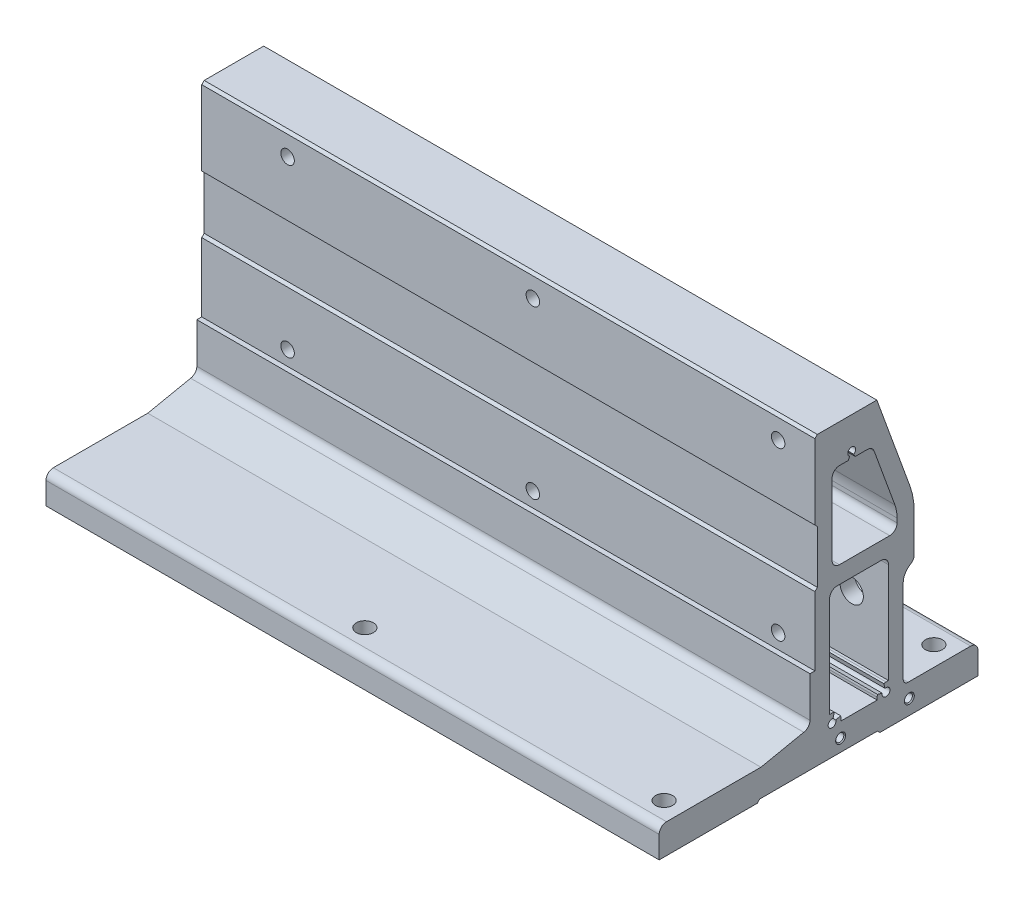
ISO-10303-21;
HEADER;
FILE_DESCRIPTION(('STEP AP214'),'2;1');
FILE_NAME('part.step','',(''),(''),'','','');
FILE_SCHEMA(('AUTOMOTIVE_DESIGN { 1 0 10303 214 1 1 1 1 }'));
ENDSEC;
DATA;
#1=APPLICATION_CONTEXT('core data for automotive mechanical design processes');
#2=APPLICATION_PROTOCOL_DEFINITION('international standard','automotive_design',2000,#1);
#3=PRODUCT_CONTEXT('',#1,'mechanical');
#4=PRODUCT('Part','Part','',(#3));
#5=PRODUCT_RELATED_PRODUCT_CATEGORY('part','',(#4));
#6=PRODUCT_DEFINITION_FORMATION('','',#4);
#7=PRODUCT_DEFINITION_CONTEXT('part definition',#1,'design');
#8=PRODUCT_DEFINITION('design','',#6,#7);
#9=PRODUCT_DEFINITION_SHAPE('','',#8);
#10=(LENGTH_UNIT() NAMED_UNIT(*) SI_UNIT(.MILLI.,.METRE.));
#11=(NAMED_UNIT(*) PLANE_ANGLE_UNIT() SI_UNIT($,.RADIAN.));
#12=(NAMED_UNIT(*) SI_UNIT($,.STERADIAN.) SOLID_ANGLE_UNIT());
#13=UNCERTAINTY_MEASURE_WITH_UNIT(LENGTH_MEASURE(1.E-05),#10,'distance_accuracy_value','');
#14=(GEOMETRIC_REPRESENTATION_CONTEXT(3) GLOBAL_UNCERTAINTY_ASSIGNED_CONTEXT((#13)) GLOBAL_UNIT_ASSIGNED_CONTEXT((#10,
#11,#12)) REPRESENTATION_CONTEXT('',''));
#15=CARTESIAN_POINT('',(0.,0.,0.));
#16=DIRECTION('',(0.,0.,1.));
#17=DIRECTION('',(1.,0.,0.));
#18=AXIS2_PLACEMENT_3D('',#15,#16,#17);
#19=CARTESIAN_POINT('',(125.,69.8212973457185,-8.99999999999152));
#20=DIRECTION('',(1.,0.,0.));
#21=DIRECTION('',(0.,0.,-1.));
#22=AXIS2_PLACEMENT_3D('',#19,#20,#21);
#23=PLANE('',#22);
#24=CARTESIAN_POINT('',(125.,5.,-36.9999999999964));
#25=DIRECTION('',(1.,0.,0.));
#26=DIRECTION('',(0.,0.,-1.));
#27=AXIS2_PLACEMENT_3D('',#24,#25,#26);
#28=CIRCLE('',#27,2.025);
#29=CARTESIAN_POINT('',(125.,5.,-39.0249999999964));
#30=VERTEX_POINT('',#29);
#31=EDGE_CURVE('E469',#30,#30,#28,.T.);
#32=ORIENTED_EDGE('',*,*,#31,.F.);
#33=EDGE_LOOP('',(#32));
#34=FACE_BOUND('',#33,.T.);
#35=CARTESIAN_POINT('',(125.,5.,-8.99999999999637));
#36=DIRECTION('',(1.,0.,0.));
#37=DIRECTION('',(0.,0.,-1.));
#38=AXIS2_PLACEMENT_3D('',#35,#36,#37);
#39=CIRCLE('',#38,2.025);
#40=CARTESIAN_POINT('',(125.,5.,-11.0249999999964));
#41=VERTEX_POINT('',#40);
#42=EDGE_CURVE('E478',#41,#41,#39,.T.);
#43=ORIENTED_EDGE('',*,*,#42,.F.);
#44=EDGE_LOOP('',(#43));
#45=FACE_BOUND('',#44,.T.);
#46=DIRECTION('',(0.,-1.,0.));
#47=VECTOR('',#46,1.);
#48=CARTESIAN_POINT('',(125.,85.4999999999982,1.5));
#49=LINE('',#48,#47);
#50=CARTESIAN_POINT('',(125.,116.,1.5));
#51=VERTEX_POINT('',#50);
#52=CARTESIAN_POINT('',(125.,85.4999999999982,1.5));
#53=VERTEX_POINT('',#52);
#54=EDGE_CURVE('E749',#51,#53,#49,.T.);
#55=ORIENTED_EDGE('',*,*,#54,.T.);
#56=DIRECTION('',(0.,-0.707106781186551,-0.707106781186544));
#57=VECTOR('',#56,1.);
#58=CARTESIAN_POINT('',(125.,84.5,0.500000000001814));
#59=LINE('',#58,#57);
#60=CARTESIAN_POINT('',(125.,84.5,0.500000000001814));
#61=VERTEX_POINT('',#60);
#62=EDGE_CURVE('E752',#53,#61,#59,.T.);
#63=ORIENTED_EDGE('',*,*,#62,.T.);
#64=DIRECTION('',(0.,-1.,0.));
#65=VECTOR('',#64,1.);
#66=CARTESIAN_POINT('',(125.,62.9999999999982,0.500000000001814));
#67=LINE('',#66,#65);
#68=CARTESIAN_POINT('',(125.,62.9999999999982,0.500000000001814));
#69=VERTEX_POINT('',#68);
#70=EDGE_CURVE('E755',#61,#69,#67,.T.);
#71=ORIENTED_EDGE('',*,*,#70,.T.);
#72=DIRECTION('',(0.,-0.707106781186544,0.707106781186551));
#73=VECTOR('',#72,1.);
#74=CARTESIAN_POINT('',(125.,61.9999999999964,1.50000000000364));
#75=LINE('',#74,#73);
#76=CARTESIAN_POINT('',(125.,61.9999999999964,1.50000000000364));
#77=VERTEX_POINT('',#76);
#78=EDGE_CURVE('E757',#69,#77,#75,.T.);
#79=ORIENTED_EDGE('',*,*,#78,.T.);
#80=DIRECTION('',(0.,-1.,0.));
#81=VECTOR('',#80,1.);
#82=CARTESIAN_POINT('',(125.,33.9999999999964,1.50000000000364));
#83=LINE('',#82,#81);
#84=CARTESIAN_POINT('',(125.,33.9999999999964,1.50000000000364));
#85=VERTEX_POINT('',#84);
#86=EDGE_CURVE('E759',#77,#85,#83,.T.);
#87=ORIENTED_EDGE('',*,*,#86,.T.);
#88=DIRECTION('',(0.,0.,1.));
#89=VECTOR('',#88,1.);
#90=CARTESIAN_POINT('',(125.,33.9999999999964,3.50000000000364));
#91=LINE('',#90,#89);
#92=CARTESIAN_POINT('',(125.,33.9999999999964,3.50000000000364));
#93=VERTEX_POINT('',#92);
#94=EDGE_CURVE('E761',#85,#93,#91,.T.);
#95=ORIENTED_EDGE('',*,*,#94,.T.);
#96=DIRECTION('',(0.,-1.,0.));
#97=VECTOR('',#96,1.);
#98=CARTESIAN_POINT('',(125.,17.5660963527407,3.50000000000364));
#99=LINE('',#98,#97);
#100=CARTESIAN_POINT('',(125.,17.5660963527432,3.50000000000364));
#101=VERTEX_POINT('',#100);
#102=EDGE_CURVE('E763',#93,#101,#99,.T.);
#103=ORIENTED_EDGE('',*,*,#102,.T.);
#104=CARTESIAN_POINT('',(125.,17.5660963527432,6.50000000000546));
#105=DIRECTION('',(-1.,0.,0.));
#106=DIRECTION('',(0.,0.,-1.));
#107=AXIS2_PLACEMENT_3D('',#104,#105,#106);
#108=CIRCLE('',#107,3.00000000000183);
#109=CARTESIAN_POINT('',(125.,14.6023377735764,6.03509669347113));
#110=VERTEX_POINT('',#109);
#111=EDGE_CURVE('E765',#101,#110,#108,.T.);
#112=ORIENTED_EDGE('',*,*,#111,.T.);
#113=DIRECTION('',(0.,-0.202009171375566,0.979383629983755));
#114=VECTOR('',#113,1.);
#115=CARTESIAN_POINT('',(125.,11.,23.5000000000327));
#116=LINE('',#115,#114);
#117=CARTESIAN_POINT('',(125.,11.,23.5000000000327));
#118=VERTEX_POINT('',#117);
#119=EDGE_CURVE('E767',#110,#118,#116,.T.);
#120=ORIENTED_EDGE('',*,*,#119,.T.);
#121=DIRECTION('',(0.,0.,1.));
#122=VECTOR('',#121,1.);
#123=CARTESIAN_POINT('',(125.,11.,62.0000000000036));
#124=LINE('',#123,#122);
#125=CARTESIAN_POINT('',(125.,11.,62.0000000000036));
#126=VERTEX_POINT('',#125);
#127=EDGE_CURVE('E769',#118,#126,#124,.T.);
#128=ORIENTED_EDGE('',*,*,#127,.T.);
#129=CARTESIAN_POINT('',(125.,8.,62.0000000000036));
#130=DIRECTION('',(1.,0.,0.));
#131=DIRECTION('',(0.,0.,-1.));
#132=AXIS2_PLACEMENT_3D('',#129,#130,#131);
#133=CIRCLE('',#132,3.);
#134=CARTESIAN_POINT('',(125.,8.,65.0000000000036));
#135=VERTEX_POINT('',#134);
#136=EDGE_CURVE('E771',#126,#135,#133,.T.);
#137=ORIENTED_EDGE('',*,*,#136,.T.);
#138=DIRECTION('',(0.,-1.,0.));
#139=VECTOR('',#138,1.);
#140=CARTESIAN_POINT('',(125.,-1.,65.0000000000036));
#141=LINE('',#140,#139);
#142=CARTESIAN_POINT('',(125.,-1.,65.0000000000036));
#143=VERTEX_POINT('',#142);
#144=EDGE_CURVE('E773',#135,#143,#141,.T.);
#145=ORIENTED_EDGE('',*,*,#144,.T.);
#146=DIRECTION('',(0.,0.,-1.));
#147=VECTOR('',#146,1.);
#148=CARTESIAN_POINT('',(125.,-1.,25.));
#149=LINE('',#148,#147);
#150=CARTESIAN_POINT('',(125.,-1.,25.));
#151=VERTEX_POINT('',#150);
#152=EDGE_CURVE('E775',#143,#151,#149,.T.);
#153=ORIENTED_EDGE('',*,*,#152,.T.);
#154=DIRECTION('',(0.,0.707106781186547,-0.707106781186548));
#155=VECTOR('',#154,1.);
#156=CARTESIAN_POINT('',(125.,0.,24.));
#157=LINE('',#156,#155);
#158=CARTESIAN_POINT('',(125.,0.,24.));
#159=VERTEX_POINT('',#158);
#160=EDGE_CURVE('E777',#151,#159,#157,.T.);
#161=ORIENTED_EDGE('',*,*,#160,.T.);
#162=DIRECTION('',(0.,0.,-1.));
#163=VECTOR('',#162,1.);
#164=CARTESIAN_POINT('',(125.,0.,-24.));
#165=LINE('',#164,#163);
#166=CARTESIAN_POINT('',(125.,0.,-24.));
#167=VERTEX_POINT('',#166);
#168=EDGE_CURVE('E779',#159,#167,#165,.T.);
#169=ORIENTED_EDGE('',*,*,#168,.T.);
#170=DIRECTION('',(0.,-0.707106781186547,-0.707106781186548));
#171=VECTOR('',#170,1.);
#172=CARTESIAN_POINT('',(125.,-1.,-25.));
#173=LINE('',#172,#171);
#174=CARTESIAN_POINT('',(125.,-1.,-25.));
#175=VERTEX_POINT('',#174);
#176=EDGE_CURVE('E781',#167,#175,#173,.T.);
#177=ORIENTED_EDGE('',*,*,#176,.T.);
#178=DIRECTION('',(0.,0.,-1.));
#179=VECTOR('',#178,1.);
#180=CARTESIAN_POINT('',(125.,-1.,-64.9999999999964));
#181=LINE('',#180,#179);
#182=CARTESIAN_POINT('',(125.,-1.,-64.9999999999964));
#183=VERTEX_POINT('',#182);
#184=EDGE_CURVE('E783',#175,#183,#181,.T.);
#185=ORIENTED_EDGE('',*,*,#184,.T.);
#186=DIRECTION('',(0.,1.,0.));
#187=VECTOR('',#186,1.);
#188=CARTESIAN_POINT('',(125.,8.,-64.9999999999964));
#189=LINE('',#188,#187);
#190=CARTESIAN_POINT('',(125.,8.,-64.9999999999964));
#191=VERTEX_POINT('',#190);
#192=EDGE_CURVE('E785',#183,#191,#189,.T.);
#193=ORIENTED_EDGE('',*,*,#192,.T.);
#194=CARTESIAN_POINT('',(125.,8.,-61.9999999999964));
#195=DIRECTION('',(1.,0.,0.));
#196=DIRECTION('',(0.,0.,-1.));
#197=AXIS2_PLACEMENT_3D('',#194,#195,#196);
#198=CIRCLE('',#197,3.);
#199=CARTESIAN_POINT('',(125.,11.,-61.9999999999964));
#200=VERTEX_POINT('',#199);
#201=EDGE_CURVE('E787',#191,#200,#198,.T.);
#202=ORIENTED_EDGE('',*,*,#201,.T.);
#203=DIRECTION('',(0.,0.,1.));
#204=VECTOR('',#203,1.);
#205=CARTESIAN_POINT('',(125.,11.,-36.4999999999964));
#206=LINE('',#205,#204);
#207=CARTESIAN_POINT('',(125.,11.,-36.4999999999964));
#208=VERTEX_POINT('',#207);
#209=EDGE_CURVE('E789',#200,#208,#206,.T.);
#210=ORIENTED_EDGE('',*,*,#209,.T.);
#211=CARTESIAN_POINT('',(125.,13.,-36.4999999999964));
#212=DIRECTION('',(-1.,0.,0.));
#213=DIRECTION('',(0.,0.,-1.));
#214=AXIS2_PLACEMENT_3D('',#211,#212,#213);
#215=CIRCLE('',#214,2.);
#216=CARTESIAN_POINT('',(125.,13.,-34.4999999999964));
#217=VERTEX_POINT('',#216);
#218=EDGE_CURVE('E791',#208,#217,#215,.T.);
#219=ORIENTED_EDGE('',*,*,#218,.T.);
#220=DIRECTION('',(0.,1.,0.));
#221=VECTOR('',#220,1.);
#222=CARTESIAN_POINT('',(125.,47.,-34.4999999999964));
#223=LINE('',#222,#221);
#224=CARTESIAN_POINT('',(125.,47.,-34.4999999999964));
#225=VERTEX_POINT('',#224);
#226=EDGE_CURVE('E793',#217,#225,#223,.T.);
#227=ORIENTED_EDGE('',*,*,#226,.T.);
#228=CARTESIAN_POINT('',(125.,46.9999999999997,-40.4999999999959));
#229=DIRECTION('',(-1.,0.,0.));
#230=DIRECTION('',(0.,0.,-1.));
#231=AXIS2_PLACEMENT_3D('',#228,#229,#230);
#232=CIRCLE('',#231,5.99999999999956);
#233=CARTESIAN_POINT('',(125.,52.1961524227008,-37.4999999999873));
#234=VERTEX_POINT('',#233);
#235=EDGE_CURVE('E795',#225,#234,#232,.T.);
#236=ORIENTED_EDGE('',*,*,#235,.T.);
#237=CARTESIAN_POINT('',(125.,54.7942286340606,-35.9999999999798));
#238=DIRECTION('',(1.,0.,0.));
#239=DIRECTION('',(0.,0.,-1.));
#240=AXIS2_PLACEMENT_3D('',#237,#238,#239);
#241=CIRCLE('',#240,3.00000000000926);
#242=CARTESIAN_POINT('',(125.,54.7942286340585,-38.9999999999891));
#243=VERTEX_POINT('',#242);
#244=EDGE_CURVE('E797',#234,#243,#241,.T.);
#245=ORIENTED_EDGE('',*,*,#244,.T.);
#246=DIRECTION('',(0.,1.,0.));
#247=VECTOR('',#246,1.);
#248=CARTESIAN_POINT('',(125.,69.8212973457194,-38.9999999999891));
#249=LINE('',#248,#247);
#250=CARTESIAN_POINT('',(125.,69.8212973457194,-38.9999999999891));
#251=VERTEX_POINT('',#250);
#252=EDGE_CURVE('E799',#243,#251,#249,.T.);
#253=ORIENTED_EDGE('',*,*,#252,.T.);
#254=CARTESIAN_POINT('',(125.,69.8212973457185,-8.99999999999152));
#255=DIRECTION('',(1.,0.,0.));
#256=DIRECTION('',(0.,0.,-1.));
#257=AXIS2_PLACEMENT_3D('',#254,#255,#256);
#258=CIRCLE('',#257,29.9999999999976);
#259=CARTESIAN_POINT('',(125.,80.0819016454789,-37.1907786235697));
#260=VERTEX_POINT('',#259);
#261=EDGE_CURVE('E801',#251,#260,#258,.T.);
#262=ORIENTED_EDGE('',*,*,#261,.T.);
#263=DIRECTION('',(0.,0.939692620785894,0.342020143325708));
#264=VECTOR('',#263,1.);
#265=CARTESIAN_POINT('',(125.,117.,-23.7536897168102));
#266=LINE('',#265,#264);
#267=CARTESIAN_POINT('',(125.,117.,-23.7536897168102));
#268=VERTEX_POINT('',#267);
#269=EDGE_CURVE('E803',#260,#268,#266,.T.);
#270=ORIENTED_EDGE('',*,*,#269,.T.);
#271=DIRECTION('',(0.,0.,1.));
#272=VECTOR('',#271,1.);
#273=CARTESIAN_POINT('',(125.,117.,0.5));
#274=LINE('',#273,#272);
#275=CARTESIAN_POINT('',(125.,117.,0.5));
#276=VERTEX_POINT('',#275);
#277=EDGE_CURVE('E805',#268,#276,#274,.T.);
#278=ORIENTED_EDGE('',*,*,#277,.T.);
#279=DIRECTION('',(0.,-0.707106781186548,0.707106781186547));
#280=VECTOR('',#279,1.);
#281=CARTESIAN_POINT('',(125.,116.,1.5));
#282=LINE('',#281,#280);
#283=EDGE_CURVE('E807',#276,#51,#282,.T.);
#284=ORIENTED_EDGE('',*,*,#283,.T.);
#285=EDGE_LOOP('',(#55,#63,#71,#79,#87,#95,#103,#112,#120,#128,#137,#145,#153,#161,#169,#177,
#185,#193,#202,#210,#219,#227,#236,#245,#253,#262,#270,#278,#284));
#286=FACE_BOUND('',#285,.T.);
#287=DIRECTION('',(0.,0.,1.));
#288=VECTOR('',#287,1.);
#289=CARTESIAN_POINT('',(125.,101.499999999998,-14.9433739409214));
#290=LINE('',#289,#288);
#291=CARTESIAN_POINT('',(125.,101.499999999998,-19.8453613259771));
#292=VERTEX_POINT('',#291);
#293=CARTESIAN_POINT('',(125.,101.499999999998,-14.9433739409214));
#294=VERTEX_POINT('',#293);
#295=EDGE_CURVE('E650',#292,#294,#290,.T.);
#296=ORIENTED_EDGE('',*,*,#295,.F.);
#297=CARTESIAN_POINT('',(125.,98.4999999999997,-19.8453613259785));
#298=DIRECTION('',(1.,0.,0.));
#299=DIRECTION('',(0.,0.,-1.));
#300=AXIS2_PLACEMENT_3D('',#297,#298,#299);
#301=CIRCLE('',#300,2.99999999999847);
#302=CARTESIAN_POINT('',(125.,99.5260604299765,-22.6644391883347));
#303=VERTEX_POINT('',#302);
#304=EDGE_CURVE('E648',#303,#292,#301,.T.);
#305=ORIENTED_EDGE('',*,*,#304,.F.);
#306=DIRECTION('',(0.,0.939692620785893,0.34202014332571));
#307=VECTOR('',#306,1.);
#308=CARTESIAN_POINT('',(125.,99.5260604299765,-22.6644391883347));
#309=LINE('',#308,#307);
#310=CARTESIAN_POINT('',(125.,76.3622153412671,-31.0953893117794));
#311=VERTEX_POINT('',#310);
#312=EDGE_CURVE('E676',#311,#303,#309,.T.);
#313=ORIENTED_EDGE('',*,*,#312,.F.);
#314=CARTESIAN_POINT('',(125.,71.2319131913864,-16.9999999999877));
#315=DIRECTION('',(1.,0.,0.));
#316=DIRECTION('',(0.,0.,-1.));
#317=AXIS2_PLACEMENT_3D('',#314,#315,#316);
#318=CIRCLE('',#317,15.0000000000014);
#319=CARTESIAN_POINT('',(125.,71.2319131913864,-31.9999999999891));
#320=VERTEX_POINT('',#319);
#321=EDGE_CURVE('E673',#320,#311,#318,.T.);
#322=ORIENTED_EDGE('',*,*,#321,.F.);
#323=DIRECTION('',(0.,1.,0.));
#324=VECTOR('',#323,1.);
#325=CARTESIAN_POINT('',(125.,71.2319131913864,-31.9999999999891));
#326=LINE('',#325,#324);
#327=CARTESIAN_POINT('',(125.,69.5,-31.9999999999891));
#328=VERTEX_POINT('',#327);
#329=EDGE_CURVE('E671',#328,#320,#326,.T.);
#330=ORIENTED_EDGE('',*,*,#329,.F.);
#331=CARTESIAN_POINT('',(125.,69.5,-28.9999999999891));
#332=DIRECTION('',(1.,0.,0.));
#333=DIRECTION('',(0.,0.,-1.));
#334=AXIS2_PLACEMENT_3D('',#331,#332,#333);
#335=CIRCLE('',#334,3.);
#336=CARTESIAN_POINT('',(125.,66.5,-28.9999999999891));
#337=VERTEX_POINT('',#336);
#338=EDGE_CURVE('E669',#337,#328,#335,.T.);
#339=ORIENTED_EDGE('',*,*,#338,.F.);
#340=DIRECTION('',(0.,0.,-1.));
#341=VECTOR('',#340,1.);
#342=CARTESIAN_POINT('',(125.,66.5,-28.9999999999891));
#343=LINE('',#342,#341);
#344=CARTESIAN_POINT('',(125.,66.5,-8.5));
#345=VERTEX_POINT('',#344);
#346=EDGE_CURVE('E667',#345,#337,#343,.T.);
#347=ORIENTED_EDGE('',*,*,#346,.F.);
#348=CARTESIAN_POINT('',(125.,69.5,-8.5));
#349=DIRECTION('',(1.,0.,0.));
#350=DIRECTION('',(0.,0.,-1.));
#351=AXIS2_PLACEMENT_3D('',#348,#349,#350);
#352=CIRCLE('',#351,3.);
#353=CARTESIAN_POINT('',(125.,69.5,-5.5));
#354=VERTEX_POINT('',#353);
#355=EDGE_CURVE('E665',#354,#345,#352,.T.);
#356=ORIENTED_EDGE('',*,*,#355,.F.);
#357=DIRECTION('',(0.,-1.,0.));
#358=VECTOR('',#357,1.);
#359=CARTESIAN_POINT('',(125.,69.5,-5.5));
#360=LINE('',#359,#358);
#361=CARTESIAN_POINT('',(125.,98.5,-5.5));
#362=VERTEX_POINT('',#361);
#363=EDGE_CURVE('E663',#362,#354,#360,.T.);
#364=ORIENTED_EDGE('',*,*,#363,.F.);
#365=CARTESIAN_POINT('',(125.,98.5,-8.5));
#366=DIRECTION('',(1.,0.,0.));
#367=DIRECTION('',(0.,0.,-1.));
#368=AXIS2_PLACEMENT_3D('',#365,#366,#367);
#369=CIRCLE('',#368,3.);
#370=CARTESIAN_POINT('',(125.,101.5,-8.5));
#371=VERTEX_POINT('',#370);
#372=EDGE_CURVE('E661',#371,#362,#369,.T.);
#373=ORIENTED_EDGE('',*,*,#372,.F.);
#374=DIRECTION('',(0.,0.,1.));
#375=VECTOR('',#374,1.);
#376=CARTESIAN_POINT('',(125.,101.5,-8.5));
#377=LINE('',#376,#375);
#378=CARTESIAN_POINT('',(125.,101.5,-12.0566260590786));
#379=VERTEX_POINT('',#378);
#380=EDGE_CURVE('E659',#379,#371,#377,.T.);
#381=ORIENTED_EDGE('',*,*,#380,.F.);
#382=DIRECTION('',(0.,-0.866025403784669,0.499999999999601));
#383=VECTOR('',#382,1.);
#384=CARTESIAN_POINT('',(125.,101.5,-12.0566260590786));
#385=LINE('',#384,#383);
#386=CARTESIAN_POINT('',(125.,102.614356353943,-12.6999999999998));
#387=VERTEX_POINT('',#386);
#388=EDGE_CURVE('E657',#387,#379,#385,.T.);
#389=ORIENTED_EDGE('',*,*,#388,.F.);
#390=CARTESIAN_POINT('',(125.,103.999996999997,-13.5));
#391=DIRECTION('',(1.,0.,0.));
#392=DIRECTION('',(0.,0.,-1.));
#393=AXIS2_PLACEMENT_3D('',#390,#391,#392);
#394=CIRCLE('',#393,1.59999999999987);
#395=CARTESIAN_POINT('',(125.,102.614356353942,-14.2999999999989));
#396=VERTEX_POINT('',#395);
#397=EDGE_CURVE('E655',#396,#387,#394,.T.);
#398=ORIENTED_EDGE('',*,*,#397,.F.);
#399=DIRECTION('',(0.,0.86602540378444,0.499999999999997));
#400=VECTOR('',#399,1.);
#401=CARTESIAN_POINT('',(125.,102.614356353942,-14.2999999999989));
#402=LINE('',#401,#400);
#403=EDGE_CURVE('E653',#294,#396,#402,.T.);
#404=ORIENTED_EDGE('',*,*,#403,.F.);
#405=EDGE_LOOP('',(#296,#305,#313,#322,#330,#339,#347,#356,#364,#373,#381,#389,#398,#404));
#406=FACE_BOUND('',#405,.T.);
#407=DIRECTION('',(0.,1.,0.));
#408=VECTOR('',#407,1.);
#409=CARTESIAN_POINT('',(125.,15.6000000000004,-28.4999999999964));
#410=LINE('',#409,#408);
#411=CARTESIAN_POINT('',(125.,15.6000000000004,-28.4999999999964));
#412=VERTEX_POINT('',#411);
#413=CARTESIAN_POINT('',(125.,56.5,-28.4999999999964));
#414=VERTEX_POINT('',#413);
#415=EDGE_CURVE('E512',#412,#414,#410,.T.);
#416=ORIENTED_EDGE('',*,*,#415,.F.);
#417=DIRECTION('',(0.,0.,-1.));
#418=VECTOR('',#417,1.);
#419=CARTESIAN_POINT('',(125.,15.6000000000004,-27.4999999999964));
#420=LINE('',#419,#418);
#421=CARTESIAN_POINT('',(125.,15.6000000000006,-27.4999999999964));
#422=VERTEX_POINT('',#421);
#423=EDGE_CURVE('E510',#422,#412,#420,.T.);
#424=ORIENTED_EDGE('',*,*,#423,.F.);
#425=CARTESIAN_POINT('',(125.,11.9999999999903,-27.4999999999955));
#426=DIRECTION('',(-1.,0.,0.));
#427=DIRECTION('',(0.,0.,-1.));
#428=AXIS2_PLACEMENT_3D('',#425,#426,#427);
#429=CIRCLE('',#428,3.60000000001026);
#430=CARTESIAN_POINT('',(125.,15.477332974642,-26.5682514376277));
#431=VERTEX_POINT('',#430);
#432=EDGE_CURVE('E549',#431,#422,#429,.T.);
#433=ORIENTED_EDGE('',*,*,#432,.F.);
#434=DIRECTION('',(0.,0.965925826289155,0.258819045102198));
#435=VECTOR('',#434,1.);
#436=CARTESIAN_POINT('',(125.,13.5454813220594,-27.0858895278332));
#437=LINE('',#436,#435);
#438=CARTESIAN_POINT('',(125.,13.5454813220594,-27.0858895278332));
#439=VERTEX_POINT('',#438);
#440=EDGE_CURVE('E547',#439,#431,#437,.T.);
#441=ORIENTED_EDGE('',*,*,#440,.F.);
#442=CARTESIAN_POINT('',(125.,11.9999999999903,-27.4999999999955));
#443=DIRECTION('',(1.,0.,0.));
#444=DIRECTION('',(0.,0.,-1.));
#445=AXIS2_PLACEMENT_3D('',#442,#443,#444);
#446=CIRCLE('',#445,1.60000000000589);
#447=CARTESIAN_POINT('',(125.,12.4141104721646,-25.9545186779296));
#448=VERTEX_POINT('',#447);
#449=EDGE_CURVE('E545',#448,#439,#446,.T.);
#450=ORIENTED_EDGE('',*,*,#449,.F.);
#451=DIRECTION('',(0.,-0.258819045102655,-0.965925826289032));
#452=VECTOR('',#451,1.);
#453=CARTESIAN_POINT('',(125.,12.9317485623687,-24.022667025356));
#454=LINE('',#453,#452);
#455=CARTESIAN_POINT('',(125.,12.9317485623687,-24.022667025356));
#456=VERTEX_POINT('',#455);
#457=EDGE_CURVE('E543',#456,#448,#454,.T.);
#458=ORIENTED_EDGE('',*,*,#457,.F.);
#459=CARTESIAN_POINT('',(125.,11.9999999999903,-27.4999999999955));
#460=DIRECTION('',(-1.,0.,0.));
#461=DIRECTION('',(0.,0.,-1.));
#462=AXIS2_PLACEMENT_3D('',#459,#460,#461);
#463=CIRCLE('',#462,3.60000000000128);
#464=CARTESIAN_POINT('',(125.,12.,-23.8999999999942));
#465=VERTEX_POINT('',#464);
#466=EDGE_CURVE('E541',#465,#456,#463,.T.);
#467=ORIENTED_EDGE('',*,*,#466,.F.);
#468=DIRECTION('',(0.,1.,0.));
#469=VECTOR('',#468,1.);
#470=CARTESIAN_POINT('',(125.,11.,-23.8999999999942));
#471=LINE('',#470,#469);
#472=CARTESIAN_POINT('',(125.,11.,-23.8999999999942));
#473=VERTEX_POINT('',#472);
#474=EDGE_CURVE('E539',#473,#465,#471,.T.);
#475=ORIENTED_EDGE('',*,*,#474,.F.);
#476=DIRECTION('',(0.,0.,-1.));
#477=VECTOR('',#476,1.);
#478=CARTESIAN_POINT('',(125.,11.,-9.09999999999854));
#479=LINE('',#478,#477);
#480=CARTESIAN_POINT('',(125.,11.,-9.09999999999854));
#481=VERTEX_POINT('',#480);
#482=EDGE_CURVE('E537',#481,#473,#479,.T.);
#483=ORIENTED_EDGE('',*,*,#482,.F.);
#484=DIRECTION('',(0.,-1.,5.15212872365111E-13));
#485=VECTOR('',#484,1.);
#486=CARTESIAN_POINT('',(125.,12.,-9.09999999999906));
#487=LINE('',#486,#485);
#488=CARTESIAN_POINT('',(125.,12.,-9.09999999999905));
#489=VERTEX_POINT('',#488);
#490=EDGE_CURVE('E535',#489,#481,#487,.T.);
#491=ORIENTED_EDGE('',*,*,#490,.F.);
#492=CARTESIAN_POINT('',(125.,12.,-5.49999999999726));
#493=DIRECTION('',(-1.,0.,0.));
#494=DIRECTION('',(0.,0.,-1.));
#495=AXIS2_PLACEMENT_3D('',#492,#493,#494);
#496=CIRCLE('',#495,3.60000000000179);
#497=CARTESIAN_POINT('',(125.,12.9317485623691,-8.97733297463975));
#498=VERTEX_POINT('',#497);
#499=EDGE_CURVE('E533',#498,#489,#496,.T.);
#500=ORIENTED_EDGE('',*,*,#499,.F.);
#501=DIRECTION('',(0.,0.258819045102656,-0.965925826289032));
#502=VECTOR('',#501,1.);
#503=CARTESIAN_POINT('',(125.,12.4141104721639,-7.04548132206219));
#504=LINE('',#503,#502);
#505=CARTESIAN_POINT('',(125.,12.4141104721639,-7.0454813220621));
#506=VERTEX_POINT('',#505);
#507=EDGE_CURVE('E531',#506,#498,#504,.T.);
#508=ORIENTED_EDGE('',*,*,#507,.F.);
#509=CARTESIAN_POINT('',(125.,12.,-5.49999999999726));
#510=DIRECTION('',(1.,0.,0.));
#511=DIRECTION('',(0.,0.,-1.));
#512=AXIS2_PLACEMENT_3D('',#509,#510,#511);
#513=CIRCLE('',#512,1.60000000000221);
#514=CARTESIAN_POINT('',(125.,13.545481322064,-5.91411047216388));
#515=VERTEX_POINT('',#514);
#516=EDGE_CURVE('E529',#515,#506,#513,.T.);
#517=ORIENTED_EDGE('',*,*,#516,.F.);
#518=DIRECTION('',(0.,-0.965925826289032,0.258819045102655));
#519=VECTOR('',#518,1.);
#520=CARTESIAN_POINT('',(125.,15.4773329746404,-6.43174856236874));
#521=LINE('',#520,#519);
#522=CARTESIAN_POINT('',(125.,15.4773329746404,-6.43174856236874));
#523=VERTEX_POINT('',#522);
#524=EDGE_CURVE('E527',#523,#515,#521,.T.);
#525=ORIENTED_EDGE('',*,*,#524,.F.);
#526=CARTESIAN_POINT('',(125.,12.,-5.49999999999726));
#527=DIRECTION('',(-1.,0.,0.));
#528=DIRECTION('',(0.,0.,-1.));
#529=AXIS2_PLACEMENT_3D('',#526,#527,#528);
#530=CIRCLE('',#529,3.60000000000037);
#531=CARTESIAN_POINT('',(125.,15.6000000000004,-5.5));
#532=VERTEX_POINT('',#531);
#533=EDGE_CURVE('E525',#532,#523,#530,.T.);
#534=ORIENTED_EDGE('',*,*,#533,.F.);
#535=DIRECTION('',(0.,0.,-1.));
#536=VECTOR('',#535,1.);
#537=CARTESIAN_POINT('',(125.,15.6000000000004,-4.5));
#538=LINE('',#537,#536);
#539=CARTESIAN_POINT('',(125.,15.6000000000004,-4.5));
#540=VERTEX_POINT('',#539);
#541=EDGE_CURVE('E523',#540,#532,#538,.T.);
#542=ORIENTED_EDGE('',*,*,#541,.F.);
#543=DIRECTION('',(0.,-1.,0.));
#544=VECTOR('',#543,1.);
#545=CARTESIAN_POINT('',(125.,56.5,-4.5));
#546=LINE('',#545,#544);
#547=CARTESIAN_POINT('',(125.,56.5,-4.5));
#548=VERTEX_POINT('',#547);
#549=EDGE_CURVE('E521',#548,#540,#546,.T.);
#550=ORIENTED_EDGE('',*,*,#549,.F.);
#551=CARTESIAN_POINT('',(125.,56.5,-7.5));
#552=DIRECTION('',(1.,0.,0.));
#553=DIRECTION('',(0.,0.,-1.));
#554=AXIS2_PLACEMENT_3D('',#551,#552,#553);
#555=CIRCLE('',#554,3.);
#556=CARTESIAN_POINT('',(125.,59.5,-7.5));
#557=VERTEX_POINT('',#556);
#558=EDGE_CURVE('E519',#557,#548,#555,.T.);
#559=ORIENTED_EDGE('',*,*,#558,.F.);
#560=DIRECTION('',(0.,0.,1.));
#561=VECTOR('',#560,1.);
#562=CARTESIAN_POINT('',(125.,59.5,-25.4999999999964));
#563=LINE('',#562,#561);
#564=CARTESIAN_POINT('',(125.,59.5,-25.4999999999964));
#565=VERTEX_POINT('',#564);
#566=EDGE_CURVE('E517',#565,#557,#563,.T.);
#567=ORIENTED_EDGE('',*,*,#566,.F.);
#568=CARTESIAN_POINT('',(125.,56.5,-25.4999999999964));
#569=DIRECTION('',(1.,0.,0.));
#570=DIRECTION('',(0.,0.,-1.));
#571=AXIS2_PLACEMENT_3D('',#568,#569,#570);
#572=CIRCLE('',#571,3.);
#573=EDGE_CURVE('E515',#414,#565,#572,.T.);
#574=ORIENTED_EDGE('',*,*,#573,.F.);
#575=EDGE_LOOP('',(#416,#424,#433,#441,#450,#458,#467,#475,#483,#491,#500,#508,#517,#525,#534,
#542,#550,#559,#567,#574));
#576=FACE_BOUND('',#575,.T.);
#577=ADVANCED_FACE('F37',(#34,#45,#286,#406,#576),#23,.T.);
#578=CARTESIAN_POINT('',(-125.,69.8212973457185,-8.99999999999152));
#579=DIRECTION('',(1.,0.,0.));
#580=DIRECTION('',(0.,0.,-1.));
#581=AXIS2_PLACEMENT_3D('',#578,#579,#580);
#582=PLANE('',#581);
#583=CARTESIAN_POINT('',(-125.,98.4999999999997,-19.8453613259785));
#584=DIRECTION('',(1.,0.,0.));
#585=DIRECTION('',(0.,0.,-1.));
#586=AXIS2_PLACEMENT_3D('',#583,#584,#585);
#587=CIRCLE('',#586,2.99999999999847);
#588=CARTESIAN_POINT('',(-125.,99.5260604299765,-22.6644391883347));
#589=VERTEX_POINT('',#588);
#590=CARTESIAN_POINT('',(-125.,101.499999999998,-19.8453613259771));
#591=VERTEX_POINT('',#590);
#592=EDGE_CURVE('E647',#589,#591,#587,.T.);
#593=ORIENTED_EDGE('',*,*,#592,.T.);
#594=DIRECTION('',(0.,0.,1.));
#595=VECTOR('',#594,1.);
#596=CARTESIAN_POINT('',(-125.,101.499999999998,-14.9433739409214));
#597=LINE('',#596,#595);
#598=CARTESIAN_POINT('',(-125.,101.499999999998,-14.9433739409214));
#599=VERTEX_POINT('',#598);
#600=EDGE_CURVE('E681',#591,#599,#597,.T.);
#601=ORIENTED_EDGE('',*,*,#600,.T.);
#602=DIRECTION('',(0.,0.86602540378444,0.499999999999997));
#603=VECTOR('',#602,1.);
#604=CARTESIAN_POINT('',(-125.,102.614356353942,-14.2999999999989));
#605=LINE('',#604,#603);
#606=CARTESIAN_POINT('',(-125.,102.614356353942,-14.2999999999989));
#607=VERTEX_POINT('',#606);
#608=EDGE_CURVE('E684',#599,#607,#605,.T.);
#609=ORIENTED_EDGE('',*,*,#608,.T.);
#610=CARTESIAN_POINT('',(-125.,103.999996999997,-13.5));
#611=DIRECTION('',(1.,0.,0.));
#612=DIRECTION('',(0.,0.,-1.));
#613=AXIS2_PLACEMENT_3D('',#610,#611,#612);
#614=CIRCLE('',#613,1.59999999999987);
#615=CARTESIAN_POINT('',(-125.,102.614356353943,-12.6999999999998));
#616=VERTEX_POINT('',#615);
#617=EDGE_CURVE('E687',#607,#616,#614,.T.);
#618=ORIENTED_EDGE('',*,*,#617,.T.);
#619=DIRECTION('',(0.,-0.866025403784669,0.499999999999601));
#620=VECTOR('',#619,1.);
#621=CARTESIAN_POINT('',(-125.,101.5,-12.0566260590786));
#622=LINE('',#621,#620);
#623=CARTESIAN_POINT('',(-125.,101.5,-12.0566260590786));
#624=VERTEX_POINT('',#623);
#625=EDGE_CURVE('E690',#616,#624,#622,.T.);
#626=ORIENTED_EDGE('',*,*,#625,.T.);
#627=DIRECTION('',(0.,0.,1.));
#628=VECTOR('',#627,1.);
#629=CARTESIAN_POINT('',(-125.,101.5,-8.5));
#630=LINE('',#629,#628);
#631=CARTESIAN_POINT('',(-125.,101.5,-8.5));
#632=VERTEX_POINT('',#631);
#633=EDGE_CURVE('E693',#624,#632,#630,.T.);
#634=ORIENTED_EDGE('',*,*,#633,.T.);
#635=CARTESIAN_POINT('',(-125.,98.5,-8.5));
#636=DIRECTION('',(1.,0.,0.));
#637=DIRECTION('',(0.,0.,-1.));
#638=AXIS2_PLACEMENT_3D('',#635,#636,#637);
#639=CIRCLE('',#638,3.);
#640=CARTESIAN_POINT('',(-125.,98.5,-5.5));
#641=VERTEX_POINT('',#640);
#642=EDGE_CURVE('E696',#632,#641,#639,.T.);
#643=ORIENTED_EDGE('',*,*,#642,.T.);
#644=DIRECTION('',(0.,-1.,0.));
#645=VECTOR('',#644,1.);
#646=CARTESIAN_POINT('',(-125.,69.5,-5.5));
#647=LINE('',#646,#645);
#648=CARTESIAN_POINT('',(-125.,69.5,-5.5));
#649=VERTEX_POINT('',#648);
#650=EDGE_CURVE('E699',#641,#649,#647,.T.);
#651=ORIENTED_EDGE('',*,*,#650,.T.);
#652=CARTESIAN_POINT('',(-125.,69.5,-8.5));
#653=DIRECTION('',(1.,0.,0.));
#654=DIRECTION('',(0.,0.,-1.));
#655=AXIS2_PLACEMENT_3D('',#652,#653,#654);
#656=CIRCLE('',#655,3.);
#657=CARTESIAN_POINT('',(-125.,66.5,-8.5));
#658=VERTEX_POINT('',#657);
#659=EDGE_CURVE('E702',#649,#658,#656,.T.);
#660=ORIENTED_EDGE('',*,*,#659,.T.);
#661=DIRECTION('',(0.,0.,-1.));
#662=VECTOR('',#661,1.);
#663=CARTESIAN_POINT('',(-125.,66.5,-28.9999999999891));
#664=LINE('',#663,#662);
#665=CARTESIAN_POINT('',(-125.,66.5,-28.9999999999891));
#666=VERTEX_POINT('',#665);
#667=EDGE_CURVE('E705',#658,#666,#664,.T.);
#668=ORIENTED_EDGE('',*,*,#667,.T.);
#669=CARTESIAN_POINT('',(-125.,69.5,-28.9999999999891));
#670=DIRECTION('',(1.,0.,0.));
#671=DIRECTION('',(0.,0.,-1.));
#672=AXIS2_PLACEMENT_3D('',#669,#670,#671);
#673=CIRCLE('',#672,3.);
#674=CARTESIAN_POINT('',(-125.,69.5,-31.9999999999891));
#675=VERTEX_POINT('',#674);
#676=EDGE_CURVE('E708',#666,#675,#673,.T.);
#677=ORIENTED_EDGE('',*,*,#676,.T.);
#678=DIRECTION('',(0.,1.,0.));
#679=VECTOR('',#678,1.);
#680=CARTESIAN_POINT('',(-125.,71.2319131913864,-31.9999999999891));
#681=LINE('',#680,#679);
#682=CARTESIAN_POINT('',(-125.,71.2319131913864,-31.9999999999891));
#683=VERTEX_POINT('',#682);
#684=EDGE_CURVE('E711',#675,#683,#681,.T.);
#685=ORIENTED_EDGE('',*,*,#684,.T.);
#686=CARTESIAN_POINT('',(-125.,71.2319131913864,-16.9999999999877));
#687=DIRECTION('',(1.,0.,0.));
#688=DIRECTION('',(0.,0.,-1.));
#689=AXIS2_PLACEMENT_3D('',#686,#687,#688);
#690=CIRCLE('',#689,15.0000000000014);
#691=CARTESIAN_POINT('',(-125.,76.3622153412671,-31.0953893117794));
#692=VERTEX_POINT('',#691);
#693=EDGE_CURVE('E714',#683,#692,#690,.T.);
#694=ORIENTED_EDGE('',*,*,#693,.T.);
#695=DIRECTION('',(0.,0.939692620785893,0.34202014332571));
#696=VECTOR('',#695,1.);
#697=CARTESIAN_POINT('',(-125.,99.5260604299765,-22.6644391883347));
#698=LINE('',#697,#696);
#699=EDGE_CURVE('E651',#692,#589,#698,.T.);
#700=ORIENTED_EDGE('',*,*,#699,.T.);
#701=EDGE_LOOP('',(#593,#601,#609,#618,#626,#634,#643,#651,#660,#668,#677,#685,#694,#700));
#702=FACE_BOUND('',#701,.T.);
#703=DIRECTION('',(0.,-1.,0.));
#704=VECTOR('',#703,1.);
#705=CARTESIAN_POINT('',(-125.,85.4999999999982,1.5));
#706=LINE('',#705,#704);
#707=CARTESIAN_POINT('',(-125.,116.,1.5));
#708=VERTEX_POINT('',#707);
#709=CARTESIAN_POINT('',(-125.,85.4999999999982,1.5));
#710=VERTEX_POINT('',#709);
#711=EDGE_CURVE('E748',#708,#710,#706,.T.);
#712=ORIENTED_EDGE('',*,*,#711,.F.);
#713=DIRECTION('',(0.,-0.707106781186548,0.707106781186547));
#714=VECTOR('',#713,1.);
#715=CARTESIAN_POINT('',(-125.,116.,1.5));
#716=LINE('',#715,#714);
#717=CARTESIAN_POINT('',(-125.,117.,0.5));
#718=VERTEX_POINT('',#717);
#719=EDGE_CURVE('E753',#718,#708,#716,.T.);
#720=ORIENTED_EDGE('',*,*,#719,.F.);
#721=DIRECTION('',(0.,0.,1.));
#722=VECTOR('',#721,1.);
#723=CARTESIAN_POINT('',(-125.,117.,0.5));
#724=LINE('',#723,#722);
#725=CARTESIAN_POINT('',(-125.,117.,-23.7536897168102));
#726=VERTEX_POINT('',#725);
#727=EDGE_CURVE('E864',#726,#718,#724,.T.);
#728=ORIENTED_EDGE('',*,*,#727,.F.);
#729=DIRECTION('',(0.,0.939692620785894,0.342020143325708));
#730=VECTOR('',#729,1.);
#731=CARTESIAN_POINT('',(-125.,117.,-23.7536897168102));
#732=LINE('',#731,#730);
#733=CARTESIAN_POINT('',(-125.,80.0819016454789,-37.1907786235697));
#734=VERTEX_POINT('',#733);
#735=EDGE_CURVE('E862',#734,#726,#732,.T.);
#736=ORIENTED_EDGE('',*,*,#735,.F.);
#737=CARTESIAN_POINT('',(-125.,69.8212973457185,-8.99999999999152));
#738=DIRECTION('',(1.,0.,0.));
#739=DIRECTION('',(0.,0.,-1.));
#740=AXIS2_PLACEMENT_3D('',#737,#738,#739);
#741=CIRCLE('',#740,29.9999999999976);
#742=CARTESIAN_POINT('',(-125.,69.8212973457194,-38.9999999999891));
#743=VERTEX_POINT('',#742);
#744=EDGE_CURVE('E860',#743,#734,#741,.T.);
#745=ORIENTED_EDGE('',*,*,#744,.F.);
#746=DIRECTION('',(0.,1.,0.));
#747=VECTOR('',#746,1.);
#748=CARTESIAN_POINT('',(-125.,69.8212973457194,-38.9999999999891));
#749=LINE('',#748,#747);
#750=CARTESIAN_POINT('',(-125.,54.7942286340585,-38.9999999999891));
#751=VERTEX_POINT('',#750);
#752=EDGE_CURVE('E858',#751,#743,#749,.T.);
#753=ORIENTED_EDGE('',*,*,#752,.F.);
#754=CARTESIAN_POINT('',(-125.,54.7942286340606,-35.9999999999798));
#755=DIRECTION('',(1.,0.,0.));
#756=DIRECTION('',(0.,0.,-1.));
#757=AXIS2_PLACEMENT_3D('',#754,#755,#756);
#758=CIRCLE('',#757,3.00000000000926);
#759=CARTESIAN_POINT('',(-125.,52.1961524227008,-37.4999999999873));
#760=VERTEX_POINT('',#759);
#761=EDGE_CURVE('E856',#760,#751,#758,.T.);
#762=ORIENTED_EDGE('',*,*,#761,.F.);
#763=CARTESIAN_POINT('',(-125.,46.9999999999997,-40.4999999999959));
#764=DIRECTION('',(-1.,0.,0.));
#765=DIRECTION('',(0.,0.,-1.));
#766=AXIS2_PLACEMENT_3D('',#763,#764,#765);
#767=CIRCLE('',#766,5.99999999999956);
#768=CARTESIAN_POINT('',(-125.,47.,-34.4999999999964));
#769=VERTEX_POINT('',#768);
#770=EDGE_CURVE('E854',#769,#760,#767,.T.);
#771=ORIENTED_EDGE('',*,*,#770,.F.);
#772=DIRECTION('',(0.,1.,0.));
#773=VECTOR('',#772,1.);
#774=CARTESIAN_POINT('',(-125.,47.,-34.4999999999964));
#775=LINE('',#774,#773);
#776=CARTESIAN_POINT('',(-125.,13.,-34.4999999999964));
#777=VERTEX_POINT('',#776);
#778=EDGE_CURVE('E852',#777,#769,#775,.T.);
#779=ORIENTED_EDGE('',*,*,#778,.F.);
#780=CARTESIAN_POINT('',(-125.,13.,-36.4999999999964));
#781=DIRECTION('',(-1.,0.,0.));
#782=DIRECTION('',(0.,0.,-1.));
#783=AXIS2_PLACEMENT_3D('',#780,#781,#782);
#784=CIRCLE('',#783,2.);
#785=CARTESIAN_POINT('',(-125.,11.,-36.4999999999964));
#786=VERTEX_POINT('',#785);
#787=EDGE_CURVE('E850',#786,#777,#784,.T.);
#788=ORIENTED_EDGE('',*,*,#787,.F.);
#789=DIRECTION('',(0.,0.,1.));
#790=VECTOR('',#789,1.);
#791=CARTESIAN_POINT('',(-125.,11.,-36.4999999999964));
#792=LINE('',#791,#790);
#793=CARTESIAN_POINT('',(-125.,11.,-61.9999999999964));
#794=VERTEX_POINT('',#793);
#795=EDGE_CURVE('E848',#794,#786,#792,.T.);
#796=ORIENTED_EDGE('',*,*,#795,.F.);
#797=CARTESIAN_POINT('',(-125.,8.,-61.9999999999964));
#798=DIRECTION('',(1.,0.,0.));
#799=DIRECTION('',(0.,0.,-1.));
#800=AXIS2_PLACEMENT_3D('',#797,#798,#799);
#801=CIRCLE('',#800,3.);
#802=CARTESIAN_POINT('',(-125.,8.,-64.9999999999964));
#803=VERTEX_POINT('',#802);
#804=EDGE_CURVE('E846',#803,#794,#801,.T.);
#805=ORIENTED_EDGE('',*,*,#804,.F.);
#806=DIRECTION('',(0.,1.,0.));
#807=VECTOR('',#806,1.);
#808=CARTESIAN_POINT('',(-125.,8.,-64.9999999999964));
#809=LINE('',#808,#807);
#810=CARTESIAN_POINT('',(-125.,-1.,-64.9999999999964));
#811=VERTEX_POINT('',#810);
#812=EDGE_CURVE('E844',#811,#803,#809,.T.);
#813=ORIENTED_EDGE('',*,*,#812,.F.);
#814=DIRECTION('',(0.,0.,-1.));
#815=VECTOR('',#814,1.);
#816=CARTESIAN_POINT('',(-125.,-1.,-64.9999999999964));
#817=LINE('',#816,#815);
#818=CARTESIAN_POINT('',(-125.,-1.,-25.));
#819=VERTEX_POINT('',#818);
#820=EDGE_CURVE('E842',#819,#811,#817,.T.);
#821=ORIENTED_EDGE('',*,*,#820,.F.);
#822=DIRECTION('',(0.,-0.707106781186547,-0.707106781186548));
#823=VECTOR('',#822,1.);
#824=CARTESIAN_POINT('',(-125.,-1.,-25.));
#825=LINE('',#824,#823);
#826=CARTESIAN_POINT('',(-125.,0.,-24.));
#827=VERTEX_POINT('',#826);
#828=EDGE_CURVE('E840',#827,#819,#825,.T.);
#829=ORIENTED_EDGE('',*,*,#828,.F.);
#830=DIRECTION('',(0.,0.,-1.));
#831=VECTOR('',#830,1.);
#832=CARTESIAN_POINT('',(-125.,0.,-24.));
#833=LINE('',#832,#831);
#834=CARTESIAN_POINT('',(-125.,0.,24.));
#835=VERTEX_POINT('',#834);
#836=EDGE_CURVE('E838',#835,#827,#833,.T.);
#837=ORIENTED_EDGE('',*,*,#836,.F.);
#838=DIRECTION('',(0.,0.707106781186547,-0.707106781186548));
#839=VECTOR('',#838,1.);
#840=CARTESIAN_POINT('',(-125.,0.,24.));
#841=LINE('',#840,#839);
#842=CARTESIAN_POINT('',(-125.,-1.,25.));
#843=VERTEX_POINT('',#842);
#844=EDGE_CURVE('E836',#843,#835,#841,.T.);
#845=ORIENTED_EDGE('',*,*,#844,.F.);
#846=DIRECTION('',(0.,0.,-1.));
#847=VECTOR('',#846,1.);
#848=CARTESIAN_POINT('',(-125.,-1.,25.));
#849=LINE('',#848,#847);
#850=CARTESIAN_POINT('',(-125.,-1.,65.0000000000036));
#851=VERTEX_POINT('',#850);
#852=EDGE_CURVE('E834',#851,#843,#849,.T.);
#853=ORIENTED_EDGE('',*,*,#852,.F.);
#854=DIRECTION('',(0.,-1.,0.));
#855=VECTOR('',#854,1.);
#856=CARTESIAN_POINT('',(-125.,-1.,65.0000000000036));
#857=LINE('',#856,#855);
#858=CARTESIAN_POINT('',(-125.,8.,65.0000000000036));
#859=VERTEX_POINT('',#858);
#860=EDGE_CURVE('E832',#859,#851,#857,.T.);
#861=ORIENTED_EDGE('',*,*,#860,.F.);
#862=CARTESIAN_POINT('',(-125.,8.,62.0000000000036));
#863=DIRECTION('',(1.,0.,0.));
#864=DIRECTION('',(0.,0.,-1.));
#865=AXIS2_PLACEMENT_3D('',#862,#863,#864);
#866=CIRCLE('',#865,3.);
#867=CARTESIAN_POINT('',(-125.,11.,62.0000000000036));
#868=VERTEX_POINT('',#867);
#869=EDGE_CURVE('E830',#868,#859,#866,.T.);
#870=ORIENTED_EDGE('',*,*,#869,.F.);
#871=DIRECTION('',(0.,0.,1.));
#872=VECTOR('',#871,1.);
#873=CARTESIAN_POINT('',(-125.,11.,62.0000000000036));
#874=LINE('',#873,#872);
#875=CARTESIAN_POINT('',(-125.,11.,23.5000000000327));
#876=VERTEX_POINT('',#875);
#877=EDGE_CURVE('E828',#876,#868,#874,.T.);
#878=ORIENTED_EDGE('',*,*,#877,.F.);
#879=DIRECTION('',(0.,-0.202009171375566,0.979383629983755));
#880=VECTOR('',#879,1.);
#881=CARTESIAN_POINT('',(-125.,11.,23.5000000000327));
#882=LINE('',#881,#880);
#883=CARTESIAN_POINT('',(-125.,14.6023377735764,6.03509669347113));
#884=VERTEX_POINT('',#883);
#885=EDGE_CURVE('E826',#884,#876,#882,.T.);
#886=ORIENTED_EDGE('',*,*,#885,.F.);
#887=CARTESIAN_POINT('',(-125.,17.5660963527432,6.50000000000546));
#888=DIRECTION('',(-1.,0.,0.));
#889=DIRECTION('',(0.,0.,-1.));
#890=AXIS2_PLACEMENT_3D('',#887,#888,#889);
#891=CIRCLE('',#890,3.00000000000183);
#892=CARTESIAN_POINT('',(-125.,17.5660963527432,3.50000000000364));
#893=VERTEX_POINT('',#892);
#894=EDGE_CURVE('E824',#893,#884,#891,.T.);
#895=ORIENTED_EDGE('',*,*,#894,.F.);
#896=DIRECTION('',(0.,-1.,0.));
#897=VECTOR('',#896,1.);
#898=CARTESIAN_POINT('',(-125.,17.5660963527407,3.50000000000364));
#899=LINE('',#898,#897);
#900=CARTESIAN_POINT('',(-125.,33.9999999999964,3.50000000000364));
#901=VERTEX_POINT('',#900);
#902=EDGE_CURVE('E822',#901,#893,#899,.T.);
#903=ORIENTED_EDGE('',*,*,#902,.F.);
#904=DIRECTION('',(0.,0.,1.));
#905=VECTOR('',#904,1.);
#906=CARTESIAN_POINT('',(-125.,33.9999999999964,3.50000000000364));
#907=LINE('',#906,#905);
#908=CARTESIAN_POINT('',(-125.,33.9999999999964,1.50000000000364));
#909=VERTEX_POINT('',#908);
#910=EDGE_CURVE('E820',#909,#901,#907,.T.);
#911=ORIENTED_EDGE('',*,*,#910,.F.);
#912=DIRECTION('',(0.,-1.,0.));
#913=VECTOR('',#912,1.);
#914=CARTESIAN_POINT('',(-125.,33.9999999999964,1.50000000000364));
#915=LINE('',#914,#913);
#916=CARTESIAN_POINT('',(-125.,61.9999999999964,1.50000000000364));
#917=VERTEX_POINT('',#916);
#918=EDGE_CURVE('E818',#917,#909,#915,.T.);
#919=ORIENTED_EDGE('',*,*,#918,.F.);
#920=DIRECTION('',(0.,-0.707106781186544,0.707106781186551));
#921=VECTOR('',#920,1.);
#922=CARTESIAN_POINT('',(-125.,61.9999999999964,1.50000000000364));
#923=LINE('',#922,#921);
#924=CARTESIAN_POINT('',(-125.,62.9999999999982,0.500000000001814));
#925=VERTEX_POINT('',#924);
#926=EDGE_CURVE('E816',#925,#917,#923,.T.);
#927=ORIENTED_EDGE('',*,*,#926,.F.);
#928=DIRECTION('',(0.,-1.,0.));
#929=VECTOR('',#928,1.);
#930=CARTESIAN_POINT('',(-125.,62.9999999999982,0.500000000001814));
#931=LINE('',#930,#929);
#932=CARTESIAN_POINT('',(-125.,84.5,0.500000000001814));
#933=VERTEX_POINT('',#932);
#934=EDGE_CURVE('E814',#933,#925,#931,.T.);
#935=ORIENTED_EDGE('',*,*,#934,.F.);
#936=DIRECTION('',(0.,-0.707106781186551,-0.707106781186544));
#937=VECTOR('',#936,1.);
#938=CARTESIAN_POINT('',(-125.,84.5,0.500000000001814));
#939=LINE('',#938,#937);
#940=EDGE_CURVE('E812',#710,#933,#939,.T.);
#941=ORIENTED_EDGE('',*,*,#940,.F.);
#942=EDGE_LOOP('',(#712,#720,#728,#736,#745,#753,#762,#771,#779,#788,#796,#805,#813,#821,#829,
#837,#845,#853,#861,#870,#878,#886,#895,#903,#911,#919,#927,#935,#941));
#943=FACE_BOUND('',#942,.T.);
#944=DIRECTION('',(0.,0.,-1.));
#945=VECTOR('',#944,1.);
#946=CARTESIAN_POINT('',(-125.,15.6000000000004,-27.4999999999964));
#947=LINE('',#946,#945);
#948=CARTESIAN_POINT('',(-125.,15.6000000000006,-27.4999999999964));
#949=VERTEX_POINT('',#948);
#950=CARTESIAN_POINT('',(-125.,15.6000000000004,-28.4999999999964));
#951=VERTEX_POINT('',#950);
#952=EDGE_CURVE('E62',#949,#951,#947,.T.);
#953=ORIENTED_EDGE('',*,*,#952,.T.);
#954=DIRECTION('',(0.,1.,0.));
#955=VECTOR('',#954,1.);
#956=CARTESIAN_POINT('',(-125.,15.6000000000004,-28.4999999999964));
#957=LINE('',#956,#955);
#958=CARTESIAN_POINT('',(-125.,56.5,-28.4999999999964));
#959=VERTEX_POINT('',#958);
#960=EDGE_CURVE('E553',#951,#959,#957,.T.);
#961=ORIENTED_EDGE('',*,*,#960,.T.);
#962=CARTESIAN_POINT('',(-125.,56.5,-25.4999999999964));
#963=DIRECTION('',(1.,0.,0.));
#964=DIRECTION('',(0.,0.,-1.));
#965=AXIS2_PLACEMENT_3D('',#962,#963,#964);
#966=CIRCLE('',#965,3.);
#967=CARTESIAN_POINT('',(-125.,59.5,-25.4999999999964));
#968=VERTEX_POINT('',#967);
#969=EDGE_CURVE('E556',#959,#968,#966,.T.);
#970=ORIENTED_EDGE('',*,*,#969,.T.);
#971=DIRECTION('',(0.,0.,1.));
#972=VECTOR('',#971,1.);
#973=CARTESIAN_POINT('',(-125.,59.5,-25.4999999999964));
#974=LINE('',#973,#972);
#975=CARTESIAN_POINT('',(-125.,59.5,-7.5));
#976=VERTEX_POINT('',#975);
#977=EDGE_CURVE('E559',#968,#976,#974,.T.);
#978=ORIENTED_EDGE('',*,*,#977,.T.);
#979=CARTESIAN_POINT('',(-125.,56.5,-7.5));
#980=DIRECTION('',(1.,0.,0.));
#981=DIRECTION('',(0.,0.,-1.));
#982=AXIS2_PLACEMENT_3D('',#979,#980,#981);
#983=CIRCLE('',#982,3.);
#984=CARTESIAN_POINT('',(-125.,56.5,-4.5));
#985=VERTEX_POINT('',#984);
#986=EDGE_CURVE('E562',#976,#985,#983,.T.);
#987=ORIENTED_EDGE('',*,*,#986,.T.);
#988=DIRECTION('',(0.,-1.,0.));
#989=VECTOR('',#988,1.);
#990=CARTESIAN_POINT('',(-125.,56.5,-4.5));
#991=LINE('',#990,#989);
#992=CARTESIAN_POINT('',(-125.,15.6000000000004,-4.5));
#993=VERTEX_POINT('',#992);
#994=EDGE_CURVE('E565',#985,#993,#991,.T.);
#995=ORIENTED_EDGE('',*,*,#994,.T.);
#996=DIRECTION('',(0.,0.,-1.));
#997=VECTOR('',#996,1.);
#998=CARTESIAN_POINT('',(-125.,15.6000000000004,-4.5));
#999=LINE('',#998,#997);
#1000=CARTESIAN_POINT('',(-125.,15.6000000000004,-5.5));
#1001=VERTEX_POINT('',#1000);
#1002=EDGE_CURVE('E568',#993,#1001,#999,.T.);
#1003=ORIENTED_EDGE('',*,*,#1002,.T.);
#1004=CARTESIAN_POINT('',(-125.,12.,-5.49999999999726));
#1005=DIRECTION('',(-1.,0.,0.));
#1006=DIRECTION('',(0.,0.,-1.));
#1007=AXIS2_PLACEMENT_3D('',#1004,#1005,#1006);
#1008=CIRCLE('',#1007,3.60000000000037);
#1009=CARTESIAN_POINT('',(-125.,15.4773329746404,-6.43174856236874));
#1010=VERTEX_POINT('',#1009);
#1011=EDGE_CURVE('E571',#1001,#1010,#1008,.T.);
#1012=ORIENTED_EDGE('',*,*,#1011,.T.);
#1013=DIRECTION('',(0.,-0.965925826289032,0.258819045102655));
#1014=VECTOR('',#1013,1.);
#1015=CARTESIAN_POINT('',(-125.,15.4773329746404,-6.43174856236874));
#1016=LINE('',#1015,#1014);
#1017=CARTESIAN_POINT('',(-125.,13.545481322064,-5.91411047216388));
#1018=VERTEX_POINT('',#1017);
#1019=EDGE_CURVE('E574',#1010,#1018,#1016,.T.);
#1020=ORIENTED_EDGE('',*,*,#1019,.T.);
#1021=CARTESIAN_POINT('',(-125.,12.,-5.49999999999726));
#1022=DIRECTION('',(1.,0.,0.));
#1023=DIRECTION('',(0.,0.,-1.));
#1024=AXIS2_PLACEMENT_3D('',#1021,#1022,#1023);
#1025=CIRCLE('',#1024,1.60000000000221);
#1026=CARTESIAN_POINT('',(-125.,12.4141104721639,-7.0454813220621));
#1027=VERTEX_POINT('',#1026);
#1028=EDGE_CURVE('E577',#1018,#1027,#1025,.T.);
#1029=ORIENTED_EDGE('',*,*,#1028,.T.);
#1030=DIRECTION('',(0.,0.258819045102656,-0.965925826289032));
#1031=VECTOR('',#1030,1.);
#1032=CARTESIAN_POINT('',(-125.,12.4141104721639,-7.04548132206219));
#1033=LINE('',#1032,#1031);
#1034=CARTESIAN_POINT('',(-125.,12.9317485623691,-8.97733297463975));
#1035=VERTEX_POINT('',#1034);
#1036=EDGE_CURVE('E580',#1027,#1035,#1033,.T.);
#1037=ORIENTED_EDGE('',*,*,#1036,.T.);
#1038=CARTESIAN_POINT('',(-125.,12.,-5.49999999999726));
#1039=DIRECTION('',(-1.,0.,0.));
#1040=DIRECTION('',(0.,0.,-1.));
#1041=AXIS2_PLACEMENT_3D('',#1038,#1039,#1040);
#1042=CIRCLE('',#1041,3.60000000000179);
#1043=CARTESIAN_POINT('',(-125.,12.,-9.09999999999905));
#1044=VERTEX_POINT('',#1043);
#1045=EDGE_CURVE('E583',#1035,#1044,#1042,.T.);
#1046=ORIENTED_EDGE('',*,*,#1045,.T.);
#1047=DIRECTION('',(0.,-1.,5.15212872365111E-13));
#1048=VECTOR('',#1047,1.);
#1049=CARTESIAN_POINT('',(-125.,12.,-9.09999999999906));
#1050=LINE('',#1049,#1048);
#1051=CARTESIAN_POINT('',(-125.,11.,-9.09999999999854));
#1052=VERTEX_POINT('',#1051);
#1053=EDGE_CURVE('E586',#1044,#1052,#1050,.T.);
#1054=ORIENTED_EDGE('',*,*,#1053,.T.);
#1055=DIRECTION('',(0.,0.,-1.));
#1056=VECTOR('',#1055,1.);
#1057=CARTESIAN_POINT('',(-125.,11.,-9.09999999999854));
#1058=LINE('',#1057,#1056);
#1059=CARTESIAN_POINT('',(-125.,11.,-23.8999999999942));
#1060=VERTEX_POINT('',#1059);
#1061=EDGE_CURVE('E589',#1052,#1060,#1058,.T.);
#1062=ORIENTED_EDGE('',*,*,#1061,.T.);
#1063=DIRECTION('',(0.,1.,0.));
#1064=VECTOR('',#1063,1.);
#1065=CARTESIAN_POINT('',(-125.,11.,-23.8999999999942));
#1066=LINE('',#1065,#1064);
#1067=CARTESIAN_POINT('',(-125.,12.,-23.8999999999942));
#1068=VERTEX_POINT('',#1067);
#1069=EDGE_CURVE('E592',#1060,#1068,#1066,.T.);
#1070=ORIENTED_EDGE('',*,*,#1069,.T.);
#1071=CARTESIAN_POINT('',(-125.,11.9999999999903,-27.4999999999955));
#1072=DIRECTION('',(-1.,0.,0.));
#1073=DIRECTION('',(0.,0.,-1.));
#1074=AXIS2_PLACEMENT_3D('',#1071,#1072,#1073);
#1075=CIRCLE('',#1074,3.60000000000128);
#1076=CARTESIAN_POINT('',(-125.,12.9317485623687,-24.022667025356));
#1077=VERTEX_POINT('',#1076);
#1078=EDGE_CURVE('E595',#1068,#1077,#1075,.T.);
#1079=ORIENTED_EDGE('',*,*,#1078,.T.);
#1080=DIRECTION('',(0.,-0.258819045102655,-0.965925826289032));
#1081=VECTOR('',#1080,1.);
#1082=CARTESIAN_POINT('',(-125.,12.9317485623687,-24.022667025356));
#1083=LINE('',#1082,#1081);
#1084=CARTESIAN_POINT('',(-125.,12.4141104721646,-25.9545186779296));
#1085=VERTEX_POINT('',#1084);
#1086=EDGE_CURVE('E598',#1077,#1085,#1083,.T.);
#1087=ORIENTED_EDGE('',*,*,#1086,.T.);
#1088=CARTESIAN_POINT('',(-125.,11.9999999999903,-27.4999999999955));
#1089=DIRECTION('',(1.,0.,0.));
#1090=DIRECTION('',(0.,0.,-1.));
#1091=AXIS2_PLACEMENT_3D('',#1088,#1089,#1090);
#1092=CIRCLE('',#1091,1.60000000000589);
#1093=CARTESIAN_POINT('',(-125.,13.5454813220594,-27.0858895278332));
#1094=VERTEX_POINT('',#1093);
#1095=EDGE_CURVE('E601',#1085,#1094,#1092,.T.);
#1096=ORIENTED_EDGE('',*,*,#1095,.T.);
#1097=DIRECTION('',(0.,0.965925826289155,0.258819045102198));
#1098=VECTOR('',#1097,1.);
#1099=CARTESIAN_POINT('',(-125.,13.5454813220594,-27.0858895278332));
#1100=LINE('',#1099,#1098);
#1101=CARTESIAN_POINT('',(-125.,15.4773329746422,-26.5682514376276));
#1102=VERTEX_POINT('',#1101);
#1103=EDGE_CURVE('E604',#1094,#1102,#1100,.T.);
#1104=ORIENTED_EDGE('',*,*,#1103,.T.);
#1105=CARTESIAN_POINT('',(-125.,11.9999999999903,-27.4999999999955));
#1106=DIRECTION('',(-1.,0.,0.));
#1107=DIRECTION('',(0.,0.,-1.));
#1108=AXIS2_PLACEMENT_3D('',#1105,#1106,#1107);
#1109=CIRCLE('',#1108,3.60000000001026);
#1110=EDGE_CURVE('E513',#1102,#949,#1109,.T.);
#1111=ORIENTED_EDGE('',*,*,#1110,.T.);
#1112=EDGE_LOOP('',(#953,#961,#970,#978,#987,#995,#1003,#1012,#1020,#1029,#1037,#1046,#1054,
#1062,#1070,#1079,#1087,#1096,#1104,#1111));
#1113=FACE_BOUND('',#1112,.T.);
#1114=ADVANCED_FACE('F1107',(#702,#943,#1113),#582,.F.);
#1115=CARTESIAN_POINT('',(125.,85.4999999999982,1.5));
#1116=DIRECTION('',(0.,0.,-1.));
#1117=DIRECTION('',(-1.,0.,0.));
#1118=AXIS2_PLACEMENT_3D('',#1115,#1116,#1117);
#1119=PLANE('',#1118);
#1120=CARTESIAN_POINT('',(-90.,108.,1.5));
#1121=DIRECTION('',(0.,0.,-1.));
#1122=DIRECTION('',(-1.,0.,0.));
#1123=AXIS2_PLACEMENT_3D('',#1120,#1121,#1122);
#1124=CIRCLE('',#1123,2.74999999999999);
#1125=CARTESIAN_POINT('',(-92.75,108.,1.5));
#1126=VERTEX_POINT('',#1125);
#1127=EDGE_CURVE('E41',#1126,#1126,#1124,.T.);
#1128=ORIENTED_EDGE('',*,*,#1127,.T.);
#1129=EDGE_LOOP('',(#1128));
#1130=FACE_BOUND('',#1129,.T.);
#1131=CARTESIAN_POINT('',(9.99999999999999,108.,1.5));
#1132=DIRECTION('',(0.,0.,-1.));
#1133=DIRECTION('',(-1.,0.,0.));
#1134=AXIS2_PLACEMENT_3D('',#1131,#1132,#1133);
#1135=CIRCLE('',#1134,2.74999999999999);
#1136=CARTESIAN_POINT('',(7.25000000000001,108.,1.5));
#1137=VERTEX_POINT('',#1136);
#1138=EDGE_CURVE('E1427',#1137,#1137,#1135,.T.);
#1139=ORIENTED_EDGE('',*,*,#1138,.T.);
#1140=EDGE_LOOP('',(#1139));
#1141=FACE_BOUND('',#1140,.T.);
#1142=CARTESIAN_POINT('',(110.,108.,1.5));
#1143=DIRECTION('',(0.,0.,-1.));
#1144=DIRECTION('',(-1.,0.,0.));
#1145=AXIS2_PLACEMENT_3D('',#1142,#1143,#1144);
#1146=CIRCLE('',#1145,2.74999999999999);
#1147=CARTESIAN_POINT('',(107.25,108.,1.5));
#1148=VERTEX_POINT('',#1147);
#1149=EDGE_CURVE('E497',#1148,#1148,#1146,.T.);
#1150=ORIENTED_EDGE('',*,*,#1149,.T.);
#1151=EDGE_LOOP('',(#1150));
#1152=FACE_BOUND('',#1151,.T.);
#1153=ORIENTED_EDGE('',*,*,#711,.T.);
#1154=DIRECTION('',(-1.,0.,0.));
#1155=VECTOR('',#1154,1.);
#1156=CARTESIAN_POINT('',(125.,85.4999999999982,1.5));
#1157=LINE('',#1156,#1155);
#1158=EDGE_CURVE('E11',#53,#710,#1157,.T.);
#1159=ORIENTED_EDGE('',*,*,#1158,.F.);
#1160=ORIENTED_EDGE('',*,*,#54,.F.);
#1161=DIRECTION('',(-1.,0.,0.));
#1162=VECTOR('',#1161,1.);
#1163=CARTESIAN_POINT('',(125.,116.,1.5));
#1164=LINE('',#1163,#1162);
#1165=EDGE_CURVE('E809',#51,#708,#1164,.T.);
#1166=ORIENTED_EDGE('',*,*,#1165,.T.);
#1167=EDGE_LOOP('',(#1153,#1159,#1160,#1166));
#1168=FACE_BOUND('',#1167,.T.);
#1169=ADVANCED_FACE('F39',(#1130,#1141,#1152,#1168),#1119,.F.);
#1170=CARTESIAN_POINT('',(125.,84.5,0.500000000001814));
#1171=DIRECTION('',(0.,0.707106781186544,-0.707106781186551));
#1172=DIRECTION('',(0.,0.707106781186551,0.707106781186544));
#1173=AXIS2_PLACEMENT_3D('',#1170,#1171,#1172);
#1174=PLANE('',#1173);
#1175=ORIENTED_EDGE('',*,*,#940,.T.);
#1176=DIRECTION('',(-1.,0.,0.));
#1177=VECTOR('',#1176,1.);
#1178=CARTESIAN_POINT('',(125.,84.5,0.500000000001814));
#1179=LINE('',#1178,#1177);
#1180=EDGE_CURVE('E46',#61,#933,#1179,.T.);
#1181=ORIENTED_EDGE('',*,*,#1180,.F.);
#1182=ORIENTED_EDGE('',*,*,#62,.F.);
#1183=ORIENTED_EDGE('',*,*,#1158,.T.);
#1184=EDGE_LOOP('',(#1175,#1181,#1182,#1183));
#1185=FACE_BOUND('',#1184,.T.);
#1186=ADVANCED_FACE('F1227',(#1185),#1174,.F.);
#1187=CARTESIAN_POINT('',(125.,62.9999999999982,0.500000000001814));
#1188=DIRECTION('',(0.,0.,-1.));
#1189=DIRECTION('',(-1.,0.,0.));
#1190=AXIS2_PLACEMENT_3D('',#1187,#1188,#1189);
#1191=PLANE('',#1190);
#1192=ORIENTED_EDGE('',*,*,#934,.T.);
#1193=DIRECTION('',(-1.,0.,0.));
#1194=VECTOR('',#1193,1.);
#1195=CARTESIAN_POINT('',(125.,62.9999999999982,0.500000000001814));
#1196=LINE('',#1195,#1194);
#1197=EDGE_CURVE('E944',#69,#925,#1196,.T.);
#1198=ORIENTED_EDGE('',*,*,#1197,.F.);
#1199=ORIENTED_EDGE('',*,*,#70,.F.);
#1200=ORIENTED_EDGE('',*,*,#1180,.T.);
#1201=EDGE_LOOP('',(#1192,#1198,#1199,#1200));
#1202=FACE_BOUND('',#1201,.T.);
#1203=ADVANCED_FACE('F1224',(#1202),#1191,.F.);
#1204=CARTESIAN_POINT('',(125.,61.9999999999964,1.50000000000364));
#1205=DIRECTION('',(0.,-0.707106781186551,-0.707106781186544));
#1206=DIRECTION('',(0.,0.707106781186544,-0.707106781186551));
#1207=AXIS2_PLACEMENT_3D('',#1204,#1205,#1206);
#1208=PLANE('',#1207);
#1209=ORIENTED_EDGE('',*,*,#926,.T.);
#1210=DIRECTION('',(-1.,0.,0.));
#1211=VECTOR('',#1210,1.);
#1212=CARTESIAN_POINT('',(125.,61.9999999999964,1.50000000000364));
#1213=LINE('',#1212,#1211);
#1214=EDGE_CURVE('E941',#77,#917,#1213,.T.);
#1215=ORIENTED_EDGE('',*,*,#1214,.F.);
#1216=ORIENTED_EDGE('',*,*,#78,.F.);
#1217=ORIENTED_EDGE('',*,*,#1197,.T.);
#1218=EDGE_LOOP('',(#1209,#1215,#1216,#1217));
#1219=FACE_BOUND('',#1218,.T.);
#1220=ADVANCED_FACE('F1220',(#1219),#1208,.F.);
#1221=CARTESIAN_POINT('',(125.,33.9999999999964,1.50000000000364));
#1222=DIRECTION('',(0.,0.,-1.));
#1223=DIRECTION('',(-1.,0.,0.));
#1224=AXIS2_PLACEMENT_3D('',#1221,#1222,#1223);
#1225=PLANE('',#1224);
#1226=CARTESIAN_POINT('',(-90.,40.,1.50000000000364));
#1227=DIRECTION('',(0.,0.,-1.));
#1228=DIRECTION('',(-1.,0.,0.));
#1229=AXIS2_PLACEMENT_3D('',#1226,#1227,#1228);
#1230=CIRCLE('',#1229,2.74999999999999);
#1231=CARTESIAN_POINT('',(-92.75,40.,1.50000000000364));
#1232=VERTEX_POINT('',#1231);
#1233=EDGE_CURVE('E1416',#1232,#1232,#1230,.T.);
#1234=ORIENTED_EDGE('',*,*,#1233,.T.);
#1235=EDGE_LOOP('',(#1234));
#1236=FACE_BOUND('',#1235,.T.);
#1237=CARTESIAN_POINT('',(9.99999999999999,40.,1.50000000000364));
#1238=DIRECTION('',(0.,0.,-1.));
#1239=DIRECTION('',(-1.,0.,0.));
#1240=AXIS2_PLACEMENT_3D('',#1237,#1238,#1239);
#1241=CIRCLE('',#1240,2.74999999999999);
#1242=CARTESIAN_POINT('',(7.25000000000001,40.,1.50000000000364));
#1243=VERTEX_POINT('',#1242);
#1244=EDGE_CURVE('E1433',#1243,#1243,#1241,.T.);
#1245=ORIENTED_EDGE('',*,*,#1244,.T.);
#1246=EDGE_LOOP('',(#1245));
#1247=FACE_BOUND('',#1246,.T.);
#1248=CARTESIAN_POINT('',(110.,40.,1.50000000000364));
#1249=DIRECTION('',(0.,0.,-1.));
#1250=DIRECTION('',(-1.,0.,0.));
#1251=AXIS2_PLACEMENT_3D('',#1248,#1249,#1250);
#1252=CIRCLE('',#1251,2.74999999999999);
#1253=CARTESIAN_POINT('',(107.25,40.,1.50000000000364));
#1254=VERTEX_POINT('',#1253);
#1255=EDGE_CURVE('E501',#1254,#1254,#1252,.T.);
#1256=ORIENTED_EDGE('',*,*,#1255,.T.);
#1257=EDGE_LOOP('',(#1256));
#1258=FACE_BOUND('',#1257,.T.);
#1259=ORIENTED_EDGE('',*,*,#918,.T.);
#1260=DIRECTION('',(-1.,0.,0.));
#1261=VECTOR('',#1260,1.);
#1262=CARTESIAN_POINT('',(125.,33.9999999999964,1.50000000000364));
#1263=LINE('',#1262,#1261);
#1264=EDGE_CURVE('E938',#85,#909,#1263,.T.);
#1265=ORIENTED_EDGE('',*,*,#1264,.F.);
#1266=ORIENTED_EDGE('',*,*,#86,.F.);
#1267=ORIENTED_EDGE('',*,*,#1214,.T.);
#1268=EDGE_LOOP('',(#1259,#1265,#1266,#1267));
#1269=FACE_BOUND('',#1268,.T.);
#1270=ADVANCED_FACE('F1216',(#1236,#1247,#1258,#1269),#1225,.F.);
#1271=CARTESIAN_POINT('',(125.,33.9999999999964,3.50000000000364));
#1272=DIRECTION('',(0.,-1.,0.));
#1273=DIRECTION('',(0.,0.,-1.));
#1274=AXIS2_PLACEMENT_3D('',#1271,#1272,#1273);
#1275=PLANE('',#1274);
#1276=ORIENTED_EDGE('',*,*,#910,.T.);
#1277=DIRECTION('',(-1.,0.,0.));
#1278=VECTOR('',#1277,1.);
#1279=CARTESIAN_POINT('',(125.,33.9999999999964,3.50000000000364));
#1280=LINE('',#1279,#1278);
#1281=EDGE_CURVE('E935',#93,#901,#1280,.T.);
#1282=ORIENTED_EDGE('',*,*,#1281,.F.);
#1283=ORIENTED_EDGE('',*,*,#94,.F.);
#1284=ORIENTED_EDGE('',*,*,#1264,.T.);
#1285=EDGE_LOOP('',(#1276,#1282,#1283,#1284));
#1286=FACE_BOUND('',#1285,.T.);
#1287=ADVANCED_FACE('F1212',(#1286),#1275,.F.);
#1288=CARTESIAN_POINT('',(125.,17.5660963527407,3.50000000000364));
#1289=DIRECTION('',(0.,0.,-1.));
#1290=DIRECTION('',(-1.,0.,0.));
#1291=AXIS2_PLACEMENT_3D('',#1288,#1289,#1290);
#1292=PLANE('',#1291);
#1293=ORIENTED_EDGE('',*,*,#902,.T.);
#1294=DIRECTION('',(-1.,0.,0.));
#1295=VECTOR('',#1294,1.);
#1296=CARTESIAN_POINT('',(125.,17.5660963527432,3.50000000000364));
#1297=LINE('',#1296,#1295);
#1298=EDGE_CURVE('E932',#101,#893,#1297,.T.);
#1299=ORIENTED_EDGE('',*,*,#1298,.F.);
#1300=ORIENTED_EDGE('',*,*,#102,.F.);
#1301=ORIENTED_EDGE('',*,*,#1281,.T.);
#1302=EDGE_LOOP('',(#1293,#1299,#1300,#1301));
#1303=FACE_BOUND('',#1302,.T.);
#1304=ADVANCED_FACE('F1208',(#1303),#1292,.F.);
#1305=CARTESIAN_POINT('',(125.,17.5660963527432,6.50000000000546));
#1306=DIRECTION('',(-1.,0.,0.));
#1307=DIRECTION('',(0.,0.,1.));
#1308=AXIS2_PLACEMENT_3D('',#1305,#1306,#1307);
#1309=CYLINDRICAL_SURFACE('',#1308,3.00000000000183);
#1310=ORIENTED_EDGE('',*,*,#894,.T.);
#1311=DIRECTION('',(-1.,0.,0.));
#1312=VECTOR('',#1311,1.);
#1313=CARTESIAN_POINT('',(125.,14.6023377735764,6.03509669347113));
#1314=LINE('',#1313,#1312);
#1315=EDGE_CURVE('E929',#110,#884,#1314,.T.);
#1316=ORIENTED_EDGE('',*,*,#1315,.F.);
#1317=ORIENTED_EDGE('',*,*,#111,.F.);
#1318=ORIENTED_EDGE('',*,*,#1298,.T.);
#1319=EDGE_LOOP('',(#1310,#1316,#1317,#1318));
#1320=FACE_BOUND('',#1319,.T.);
#1321=ADVANCED_FACE('F1204',(#1320),#1309,.F.);
#1322=CARTESIAN_POINT('',(125.,11.,23.5000000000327));
#1323=DIRECTION('',(0.,-0.979383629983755,-0.202009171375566));
#1324=DIRECTION('',(0.,0.202009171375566,-0.979383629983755));
#1325=AXIS2_PLACEMENT_3D('',#1322,#1323,#1324);
#1326=PLANE('',#1325);
#1327=ORIENTED_EDGE('',*,*,#885,.T.);
#1328=DIRECTION('',(-1.,0.,0.));
#1329=VECTOR('',#1328,1.);
#1330=CARTESIAN_POINT('',(125.,11.,23.5000000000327));
#1331=LINE('',#1330,#1329);
#1332=EDGE_CURVE('E926',#118,#876,#1331,.T.);
#1333=ORIENTED_EDGE('',*,*,#1332,.F.);
#1334=ORIENTED_EDGE('',*,*,#119,.F.);
#1335=ORIENTED_EDGE('',*,*,#1315,.T.);
#1336=EDGE_LOOP('',(#1327,#1333,#1334,#1335));
#1337=FACE_BOUND('',#1336,.T.);
#1338=ADVANCED_FACE('F1200',(#1337),#1326,.F.);
#1339=CARTESIAN_POINT('',(125.,11.,62.0000000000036));
#1340=DIRECTION('',(0.,-1.,0.));
#1341=DIRECTION('',(0.,0.,-1.));
#1342=AXIS2_PLACEMENT_3D('',#1339,#1340,#1341);
#1343=PLANE('',#1342);
#1344=CARTESIAN_POINT('',(-5.,11.,55.0000000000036));
#1345=DIRECTION('',(0.,-1.,0.));
#1346=DIRECTION('',(0.,0.,-1.));
#1347=AXIS2_PLACEMENT_3D('',#1344,#1345,#1346);
#1348=CIRCLE('',#1347,3.49999999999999);
#1349=CARTESIAN_POINT('',(-5.,11.,51.5000000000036));
#1350=VERTEX_POINT('',#1349);
#1351=EDGE_CURVE('E1439',#1350,#1350,#1348,.T.);
#1352=ORIENTED_EDGE('',*,*,#1351,.T.);
#1353=EDGE_LOOP('',(#1352));
#1354=FACE_BOUND('',#1353,.T.);
#1355=CARTESIAN_POINT('',(117.,11.,55.0000000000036));
#1356=DIRECTION('',(0.,-1.,0.));
#1357=DIRECTION('',(0.,0.,-1.));
#1358=AXIS2_PLACEMENT_3D('',#1355,#1356,#1357);
#1359=CIRCLE('',#1358,3.49999999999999);
#1360=CARTESIAN_POINT('',(117.,11.,51.5000000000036));
#1361=VERTEX_POINT('',#1360);
#1362=EDGE_CURVE('E463',#1361,#1361,#1359,.T.);
#1363=ORIENTED_EDGE('',*,*,#1362,.T.);
#1364=EDGE_LOOP('',(#1363));
#1365=FACE_BOUND('',#1364,.T.);
#1366=ORIENTED_EDGE('',*,*,#877,.T.);
#1367=DIRECTION('',(-1.,0.,0.));
#1368=VECTOR('',#1367,1.);
#1369=CARTESIAN_POINT('',(125.,11.,62.0000000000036));
#1370=LINE('',#1369,#1368);
#1371=EDGE_CURVE('E923',#126,#868,#1370,.T.);
#1372=ORIENTED_EDGE('',*,*,#1371,.F.);
#1373=ORIENTED_EDGE('',*,*,#127,.F.);
#1374=ORIENTED_EDGE('',*,*,#1332,.T.);
#1375=EDGE_LOOP('',(#1366,#1372,#1373,#1374));
#1376=FACE_BOUND('',#1375,.T.);
#1377=ADVANCED_FACE('F1196',(#1354,#1365,#1376),#1343,.F.);
#1378=CARTESIAN_POINT('',(125.,8.,62.0000000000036));
#1379=DIRECTION('',(-1.,0.,0.));
#1380=DIRECTION('',(0.,0.,1.));
#1381=AXIS2_PLACEMENT_3D('',#1378,#1379,#1380);
#1382=CYLINDRICAL_SURFACE('',#1381,3.);
#1383=ORIENTED_EDGE('',*,*,#869,.T.);
#1384=DIRECTION('',(-1.,0.,0.));
#1385=VECTOR('',#1384,1.);
#1386=CARTESIAN_POINT('',(125.,8.,65.0000000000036));
#1387=LINE('',#1386,#1385);
#1388=EDGE_CURVE('E920',#135,#859,#1387,.T.);
#1389=ORIENTED_EDGE('',*,*,#1388,.F.);
#1390=ORIENTED_EDGE('',*,*,#136,.F.);
#1391=ORIENTED_EDGE('',*,*,#1371,.T.);
#1392=EDGE_LOOP('',(#1383,#1389,#1390,#1391));
#1393=FACE_BOUND('',#1392,.T.);
#1394=ADVANCED_FACE('F1192',(#1393),#1382,.T.);
#1395=CARTESIAN_POINT('',(125.,-1.,65.0000000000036));
#1396=DIRECTION('',(0.,0.,-1.));
#1397=DIRECTION('',(-1.,0.,0.));
#1398=AXIS2_PLACEMENT_3D('',#1395,#1396,#1397);
#1399=PLANE('',#1398);
#1400=ORIENTED_EDGE('',*,*,#860,.T.);
#1401=DIRECTION('',(-1.,0.,0.));
#1402=VECTOR('',#1401,1.);
#1403=CARTESIAN_POINT('',(125.,-1.,65.0000000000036));
#1404=LINE('',#1403,#1402);
#1405=EDGE_CURVE('E917',#143,#851,#1404,.T.);
#1406=ORIENTED_EDGE('',*,*,#1405,.F.);
#1407=ORIENTED_EDGE('',*,*,#144,.F.);
#1408=ORIENTED_EDGE('',*,*,#1388,.T.);
#1409=EDGE_LOOP('',(#1400,#1406,#1407,#1408));
#1410=FACE_BOUND('',#1409,.T.);
#1411=ADVANCED_FACE('F1188',(#1410),#1399,.F.);
#1412=CARTESIAN_POINT('',(125.,-1.,25.));
#1413=DIRECTION('',(0.,1.,0.));
#1414=DIRECTION('',(0.,0.,1.));
#1415=AXIS2_PLACEMENT_3D('',#1412,#1413,#1414);
#1416=PLANE('',#1415);
#1417=CARTESIAN_POINT('',(-5.,-1.,55.0000000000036));
#1418=DIRECTION('',(0.,-1.,0.));
#1419=DIRECTION('',(0.,0.,-1.));
#1420=AXIS2_PLACEMENT_3D('',#1417,#1418,#1419);
#1421=CIRCLE('',#1420,3.49999999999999);
#1422=CARTESIAN_POINT('',(-5.,-1.,51.5000000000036));
#1423=VERTEX_POINT('',#1422);
#1424=EDGE_CURVE('E1436',#1423,#1423,#1421,.T.);
#1425=ORIENTED_EDGE('',*,*,#1424,.F.);
#1426=EDGE_LOOP('',(#1425));
#1427=FACE_BOUND('',#1426,.T.);
#1428=CARTESIAN_POINT('',(117.,-1.,55.0000000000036));
#1429=DIRECTION('',(0.,-1.,0.));
#1430=DIRECTION('',(0.,0.,-1.));
#1431=AXIS2_PLACEMENT_3D('',#1428,#1429,#1430);
#1432=CIRCLE('',#1431,3.49999999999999);
#1433=CARTESIAN_POINT('',(117.,-1.,51.5000000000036));
#1434=VERTEX_POINT('',#1433);
#1435=EDGE_CURVE('E1452',#1434,#1434,#1432,.T.);
#1436=ORIENTED_EDGE('',*,*,#1435,.F.);
#1437=EDGE_LOOP('',(#1436));
#1438=FACE_BOUND('',#1437,.T.);
#1439=ORIENTED_EDGE('',*,*,#852,.T.);
#1440=DIRECTION('',(-1.,0.,0.));
#1441=VECTOR('',#1440,1.);
#1442=CARTESIAN_POINT('',(125.,-1.,25.));
#1443=LINE('',#1442,#1441);
#1444=EDGE_CURVE('E914',#151,#843,#1443,.T.);
#1445=ORIENTED_EDGE('',*,*,#1444,.F.);
#1446=ORIENTED_EDGE('',*,*,#152,.F.);
#1447=ORIENTED_EDGE('',*,*,#1405,.T.);
#1448=EDGE_LOOP('',(#1439,#1445,#1446,#1447));
#1449=FACE_BOUND('',#1448,.T.);
#1450=ADVANCED_FACE('F1184',(#1427,#1438,#1449),#1416,.F.);
#1451=CARTESIAN_POINT('',(125.,0.,24.));
#1452=DIRECTION('',(0.,0.707106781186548,0.707106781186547));
#1453=DIRECTION('',(0.,-0.707106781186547,0.707106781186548));
#1454=AXIS2_PLACEMENT_3D('',#1451,#1452,#1453);
#1455=PLANE('',#1454);
#1456=ORIENTED_EDGE('',*,*,#844,.T.);
#1457=DIRECTION('',(-1.,0.,0.));
#1458=VECTOR('',#1457,1.);
#1459=CARTESIAN_POINT('',(125.,0.,24.));
#1460=LINE('',#1459,#1458);
#1461=EDGE_CURVE('E911',#159,#835,#1460,.T.);
#1462=ORIENTED_EDGE('',*,*,#1461,.F.);
#1463=ORIENTED_EDGE('',*,*,#160,.F.);
#1464=ORIENTED_EDGE('',*,*,#1444,.T.);
#1465=EDGE_LOOP('',(#1456,#1462,#1463,#1464));
#1466=FACE_BOUND('',#1465,.T.);
#1467=ADVANCED_FACE('F1180',(#1466),#1455,.F.);
#1468=CARTESIAN_POINT('',(125.,0.,-24.));
#1469=DIRECTION('',(0.,1.,0.));
#1470=DIRECTION('',(0.,0.,1.));
#1471=AXIS2_PLACEMENT_3D('',#1468,#1469,#1470);
#1472=PLANE('',#1471);
#1473=CARTESIAN_POINT('',(117.,0.,0.));
#1474=DIRECTION('',(0.,-1.,0.));
#1475=DIRECTION('',(0.,0.,-1.));
#1476=AXIS2_PLACEMENT_3D('',#1473,#1474,#1475);
#1477=CIRCLE('',#1476,2.5);
#1478=CARTESIAN_POINT('',(117.,0.,-2.50000000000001));
#1479=VERTEX_POINT('',#1478);
#1480=EDGE_CURVE('E457',#1479,#1479,#1477,.T.);
#1481=ORIENTED_EDGE('',*,*,#1480,.F.);
#1482=EDGE_LOOP('',(#1481));
#1483=FACE_BOUND('',#1482,.T.);
#1484=CARTESIAN_POINT('',(-5.,0.,0.));
#1485=DIRECTION('',(0.,-1.,0.));
#1486=DIRECTION('',(0.,0.,-1.));
#1487=AXIS2_PLACEMENT_3D('',#1484,#1485,#1486);
#1488=CIRCLE('',#1487,2.5);
#1489=CARTESIAN_POINT('',(-5.,0.,-2.5));
#1490=VERTEX_POINT('',#1489);
#1491=EDGE_CURVE('E456',#1490,#1490,#1488,.T.);
#1492=ORIENTED_EDGE('',*,*,#1491,.F.);
#1493=EDGE_LOOP('',(#1492));
#1494=FACE_BOUND('',#1493,.T.);
#1495=ORIENTED_EDGE('',*,*,#836,.T.);
#1496=DIRECTION('',(-1.,0.,0.));
#1497=VECTOR('',#1496,1.);
#1498=CARTESIAN_POINT('',(125.,0.,-24.));
#1499=LINE('',#1498,#1497);
#1500=EDGE_CURVE('E908',#167,#827,#1499,.T.);
#1501=ORIENTED_EDGE('',*,*,#1500,.F.);
#1502=ORIENTED_EDGE('',*,*,#168,.F.);
#1503=ORIENTED_EDGE('',*,*,#1461,.T.);
#1504=EDGE_LOOP('',(#1495,#1501,#1502,#1503));
#1505=FACE_BOUND('',#1504,.T.);
#1506=ADVANCED_FACE('F1176',(#1483,#1494,#1505),#1472,.F.);
#1507=CARTESIAN_POINT('',(125.,-1.,-25.));
#1508=DIRECTION('',(0.,0.707106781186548,-0.707106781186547));
#1509=DIRECTION('',(0.,0.707106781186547,0.707106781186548));
#1510=AXIS2_PLACEMENT_3D('',#1507,#1508,#1509);
#1511=PLANE('',#1510);
#1512=ORIENTED_EDGE('',*,*,#828,.T.);
#1513=DIRECTION('',(-1.,0.,0.));
#1514=VECTOR('',#1513,1.);
#1515=CARTESIAN_POINT('',(125.,-1.,-25.));
#1516=LINE('',#1515,#1514);
#1517=EDGE_CURVE('E905',#175,#819,#1516,.T.);
#1518=ORIENTED_EDGE('',*,*,#1517,.F.);
#1519=ORIENTED_EDGE('',*,*,#176,.F.);
#1520=ORIENTED_EDGE('',*,*,#1500,.T.);
#1521=EDGE_LOOP('',(#1512,#1518,#1519,#1520));
#1522=FACE_BOUND('',#1521,.T.);
#1523=ADVANCED_FACE('F1172',(#1522),#1511,.F.);
#1524=CARTESIAN_POINT('',(125.,-1.,-64.9999999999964));
#1525=DIRECTION('',(0.,1.,0.));
#1526=DIRECTION('',(0.,0.,1.));
#1527=AXIS2_PLACEMENT_3D('',#1524,#1525,#1526);
#1528=PLANE('',#1527);
#1529=CARTESIAN_POINT('',(-5.,-1.,-54.9999999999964));
#1530=DIRECTION('',(0.,-1.,0.));
#1531=DIRECTION('',(0.,0.,-1.));
#1532=AXIS2_PLACEMENT_3D('',#1529,#1530,#1531);
#1533=CIRCLE('',#1532,3.49999999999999);
#1534=CARTESIAN_POINT('',(-5.,-1.,-58.4999999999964));
#1535=VERTEX_POINT('',#1534);
#1536=EDGE_CURVE('E1442',#1535,#1535,#1533,.T.);
#1537=ORIENTED_EDGE('',*,*,#1536,.F.);
#1538=EDGE_LOOP('',(#1537));
#1539=FACE_BOUND('',#1538,.T.);
#1540=CARTESIAN_POINT('',(117.,-1.,-54.9999999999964));
#1541=DIRECTION('',(0.,-1.,0.));
#1542=DIRECTION('',(0.,0.,-1.));
#1543=AXIS2_PLACEMENT_3D('',#1540,#1541,#1542);
#1544=CIRCLE('',#1543,3.49999999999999);
#1545=CARTESIAN_POINT('',(117.,-1.,-58.4999999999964));
#1546=VERTEX_POINT('',#1545);
#1547=EDGE_CURVE('E1448',#1546,#1546,#1544,.T.);
#1548=ORIENTED_EDGE('',*,*,#1547,.F.);
#1549=EDGE_LOOP('',(#1548));
#1550=FACE_BOUND('',#1549,.T.);
#1551=ORIENTED_EDGE('',*,*,#820,.T.);
#1552=DIRECTION('',(-1.,0.,0.));
#1553=VECTOR('',#1552,1.);
#1554=CARTESIAN_POINT('',(125.,-1.,-64.9999999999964));
#1555=LINE('',#1554,#1553);
#1556=EDGE_CURVE('E902',#183,#811,#1555,.T.);
#1557=ORIENTED_EDGE('',*,*,#1556,.F.);
#1558=ORIENTED_EDGE('',*,*,#184,.F.);
#1559=ORIENTED_EDGE('',*,*,#1517,.T.);
#1560=EDGE_LOOP('',(#1551,#1557,#1558,#1559));
#1561=FACE_BOUND('',#1560,.T.);
#1562=ADVANCED_FACE('F1168',(#1539,#1550,#1561),#1528,.F.);
#1563=CARTESIAN_POINT('',(125.,8.,-64.9999999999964));
#1564=DIRECTION('',(0.,0.,1.));
#1565=DIRECTION('',(1.,0.,0.));
#1566=AXIS2_PLACEMENT_3D('',#1563,#1564,#1565);
#1567=PLANE('',#1566);
#1568=ORIENTED_EDGE('',*,*,#812,.T.);
#1569=DIRECTION('',(-1.,0.,0.));
#1570=VECTOR('',#1569,1.);
#1571=CARTESIAN_POINT('',(125.,8.,-64.9999999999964));
#1572=LINE('',#1571,#1570);
#1573=EDGE_CURVE('E899',#191,#803,#1572,.T.);
#1574=ORIENTED_EDGE('',*,*,#1573,.F.);
#1575=ORIENTED_EDGE('',*,*,#192,.F.);
#1576=ORIENTED_EDGE('',*,*,#1556,.T.);
#1577=EDGE_LOOP('',(#1568,#1574,#1575,#1576));
#1578=FACE_BOUND('',#1577,.T.);
#1579=ADVANCED_FACE('F1164',(#1578),#1567,.F.);
#1580=CARTESIAN_POINT('',(125.,8.,-61.9999999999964));
#1581=DIRECTION('',(-1.,0.,0.));
#1582=DIRECTION('',(0.,0.,1.));
#1583=AXIS2_PLACEMENT_3D('',#1580,#1581,#1582);
#1584=CYLINDRICAL_SURFACE('',#1583,3.);
#1585=ORIENTED_EDGE('',*,*,#804,.T.);
#1586=DIRECTION('',(-1.,0.,0.));
#1587=VECTOR('',#1586,1.);
#1588=CARTESIAN_POINT('',(125.,11.,-61.9999999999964));
#1589=LINE('',#1588,#1587);
#1590=EDGE_CURVE('E896',#200,#794,#1589,.T.);
#1591=ORIENTED_EDGE('',*,*,#1590,.F.);
#1592=ORIENTED_EDGE('',*,*,#201,.F.);
#1593=ORIENTED_EDGE('',*,*,#1573,.T.);
#1594=EDGE_LOOP('',(#1585,#1591,#1592,#1593));
#1595=FACE_BOUND('',#1594,.T.);
#1596=ADVANCED_FACE('F1160',(#1595),#1584,.T.);
#1597=CARTESIAN_POINT('',(125.,11.,-36.4999999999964));
#1598=DIRECTION('',(0.,-1.,0.));
#1599=DIRECTION('',(0.,0.,-1.));
#1600=AXIS2_PLACEMENT_3D('',#1597,#1598,#1599);
#1601=PLANE('',#1600);
#1602=CARTESIAN_POINT('',(-5.,11.,-54.9999999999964));
#1603=DIRECTION('',(0.,-1.,0.));
#1604=DIRECTION('',(0.,0.,-1.));
#1605=AXIS2_PLACEMENT_3D('',#1602,#1603,#1604);
#1606=CIRCLE('',#1605,3.49999999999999);
#1607=CARTESIAN_POINT('',(-5.,11.,-58.4999999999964));
#1608=VERTEX_POINT('',#1607);
#1609=EDGE_CURVE('E1445',#1608,#1608,#1606,.T.);
#1610=ORIENTED_EDGE('',*,*,#1609,.T.);
#1611=EDGE_LOOP('',(#1610));
#1612=FACE_BOUND('',#1611,.T.);
#1613=CARTESIAN_POINT('',(117.,11.,-54.9999999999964));
#1614=DIRECTION('',(0.,-1.,0.));
#1615=DIRECTION('',(0.,0.,-1.));
#1616=AXIS2_PLACEMENT_3D('',#1613,#1614,#1615);
#1617=CIRCLE('',#1616,3.49999999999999);
#1618=CARTESIAN_POINT('',(117.,11.,-58.4999999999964));
#1619=VERTEX_POINT('',#1618);
#1620=EDGE_CURVE('E1451',#1619,#1619,#1617,.T.);
#1621=ORIENTED_EDGE('',*,*,#1620,.T.);
#1622=EDGE_LOOP('',(#1621));
#1623=FACE_BOUND('',#1622,.T.);
#1624=ORIENTED_EDGE('',*,*,#795,.T.);
#1625=DIRECTION('',(-1.,0.,0.));
#1626=VECTOR('',#1625,1.);
#1627=CARTESIAN_POINT('',(125.,11.,-36.4999999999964));
#1628=LINE('',#1627,#1626);
#1629=EDGE_CURVE('E893',#208,#786,#1628,.T.);
#1630=ORIENTED_EDGE('',*,*,#1629,.F.);
#1631=ORIENTED_EDGE('',*,*,#209,.F.);
#1632=ORIENTED_EDGE('',*,*,#1590,.T.);
#1633=EDGE_LOOP('',(#1624,#1630,#1631,#1632));
#1634=FACE_BOUND('',#1633,.T.);
#1635=ADVANCED_FACE('F1156',(#1612,#1623,#1634),#1601,.F.);
#1636=CARTESIAN_POINT('',(125.,13.,-36.4999999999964));
#1637=DIRECTION('',(-1.,0.,0.));
#1638=DIRECTION('',(0.,0.,1.));
#1639=AXIS2_PLACEMENT_3D('',#1636,#1637,#1638);
#1640=CYLINDRICAL_SURFACE('',#1639,2.);
#1641=ORIENTED_EDGE('',*,*,#787,.T.);
#1642=DIRECTION('',(-1.,0.,0.));
#1643=VECTOR('',#1642,1.);
#1644=CARTESIAN_POINT('',(125.,13.,-34.4999999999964));
#1645=LINE('',#1644,#1643);
#1646=EDGE_CURVE('E890',#217,#777,#1645,.T.);
#1647=ORIENTED_EDGE('',*,*,#1646,.F.);
#1648=ORIENTED_EDGE('',*,*,#218,.F.);
#1649=ORIENTED_EDGE('',*,*,#1629,.T.);
#1650=EDGE_LOOP('',(#1641,#1647,#1648,#1649));
#1651=FACE_BOUND('',#1650,.T.);
#1652=ADVANCED_FACE('F1152',(#1651),#1640,.F.);
#1653=CARTESIAN_POINT('',(125.,47.,-34.4999999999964));
#1654=DIRECTION('',(0.,0.,1.));
#1655=DIRECTION('',(1.,0.,0.));
#1656=AXIS2_PLACEMENT_3D('',#1653,#1654,#1655);
#1657=PLANE('',#1656);
#1658=CARTESIAN_POINT('',(-90.,40.,-34.4999999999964));
#1659=DIRECTION('',(0.,0.,1.));
#1660=DIRECTION('',(1.,0.,0.));
#1661=AXIS2_PLACEMENT_3D('',#1658,#1659,#1660);
#1662=CIRCLE('',#1661,4.75);
#1663=CARTESIAN_POINT('',(-85.25,40.,-34.4999999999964));
#1664=VERTEX_POINT('',#1663);
#1665=EDGE_CURVE('E1404',#1664,#1664,#1662,.T.);
#1666=ORIENTED_EDGE('',*,*,#1665,.T.);
#1667=EDGE_LOOP('',(#1666));
#1668=FACE_BOUND('',#1667,.T.);
#1669=CARTESIAN_POINT('',(9.99999999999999,40.,-34.4999999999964));
#1670=DIRECTION('',(0.,0.,1.));
#1671=DIRECTION('',(1.,0.,0.));
#1672=AXIS2_PLACEMENT_3D('',#1669,#1670,#1671);
#1673=CIRCLE('',#1672,4.75);
#1674=CARTESIAN_POINT('',(14.75,40.,-34.4999999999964));
#1675=VERTEX_POINT('',#1674);
#1676=EDGE_CURVE('E1429',#1675,#1675,#1673,.T.);
#1677=ORIENTED_EDGE('',*,*,#1676,.T.);
#1678=EDGE_LOOP('',(#1677));
#1679=FACE_BOUND('',#1678,.T.);
#1680=CARTESIAN_POINT('',(110.,40.,-34.4999999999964));
#1681=DIRECTION('',(0.,0.,1.));
#1682=DIRECTION('',(1.,0.,0.));
#1683=AXIS2_PLACEMENT_3D('',#1680,#1681,#1682);
#1684=CIRCLE('',#1683,4.75);
#1685=CARTESIAN_POINT('',(114.75,40.,-34.4999999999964));
#1686=VERTEX_POINT('',#1685);
#1687=EDGE_CURVE('E507',#1686,#1686,#1684,.T.);
#1688=ORIENTED_EDGE('',*,*,#1687,.T.);
#1689=EDGE_LOOP('',(#1688));
#1690=FACE_BOUND('',#1689,.T.);
#1691=ORIENTED_EDGE('',*,*,#778,.T.);
#1692=DIRECTION('',(-1.,0.,0.));
#1693=VECTOR('',#1692,1.);
#1694=CARTESIAN_POINT('',(125.,47.,-34.4999999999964));
#1695=LINE('',#1694,#1693);
#1696=EDGE_CURVE('E887',#225,#769,#1695,.T.);
#1697=ORIENTED_EDGE('',*,*,#1696,.F.);
#1698=ORIENTED_EDGE('',*,*,#226,.F.);
#1699=ORIENTED_EDGE('',*,*,#1646,.T.);
#1700=EDGE_LOOP('',(#1691,#1697,#1698,#1699));
#1701=FACE_BOUND('',#1700,.T.);
#1702=ADVANCED_FACE('F1148',(#1668,#1679,#1690,#1701),#1657,.F.);
#1703=CARTESIAN_POINT('',(125.,46.9999999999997,-40.4999999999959));
#1704=DIRECTION('',(-1.,0.,0.));
#1705=DIRECTION('',(0.,0.,1.));
#1706=AXIS2_PLACEMENT_3D('',#1703,#1704,#1705);
#1707=CYLINDRICAL_SURFACE('',#1706,5.99999999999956);
#1708=ORIENTED_EDGE('',*,*,#770,.T.);
#1709=DIRECTION('',(-1.,0.,0.));
#1710=VECTOR('',#1709,1.);
#1711=CARTESIAN_POINT('',(125.,52.1961524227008,-37.4999999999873));
#1712=LINE('',#1711,#1710);
#1713=EDGE_CURVE('E884',#234,#760,#1712,.T.);
#1714=ORIENTED_EDGE('',*,*,#1713,.F.);
#1715=ORIENTED_EDGE('',*,*,#235,.F.);
#1716=ORIENTED_EDGE('',*,*,#1696,.T.);
#1717=EDGE_LOOP('',(#1708,#1714,#1715,#1716));
#1718=FACE_BOUND('',#1717,.T.);
#1719=ADVANCED_FACE('F1144',(#1718),#1707,.F.);
#1720=CARTESIAN_POINT('',(125.,54.7942286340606,-35.9999999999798));
#1721=DIRECTION('',(-1.,0.,0.));
#1722=DIRECTION('',(0.,0.,1.));
#1723=AXIS2_PLACEMENT_3D('',#1720,#1721,#1722);
#1724=CYLINDRICAL_SURFACE('',#1723,3.00000000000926);
#1725=ORIENTED_EDGE('',*,*,#761,.T.);
#1726=DIRECTION('',(-1.,0.,0.));
#1727=VECTOR('',#1726,1.);
#1728=CARTESIAN_POINT('',(125.,54.7942286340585,-38.9999999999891));
#1729=LINE('',#1728,#1727);
#1730=EDGE_CURVE('E881',#243,#751,#1729,.T.);
#1731=ORIENTED_EDGE('',*,*,#1730,.F.);
#1732=ORIENTED_EDGE('',*,*,#244,.F.);
#1733=ORIENTED_EDGE('',*,*,#1713,.T.);
#1734=EDGE_LOOP('',(#1725,#1731,#1732,#1733));
#1735=FACE_BOUND('',#1734,.T.);
#1736=ADVANCED_FACE('F1140',(#1735),#1724,.T.);
#1737=CARTESIAN_POINT('',(125.,69.8212973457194,-38.9999999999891));
#1738=DIRECTION('',(0.,0.,1.));
#1739=DIRECTION('',(1.,0.,0.));
#1740=AXIS2_PLACEMENT_3D('',#1737,#1738,#1739);
#1741=PLANE('',#1740);
#1742=ORIENTED_EDGE('',*,*,#752,.T.);
#1743=DIRECTION('',(-1.,0.,0.));
#1744=VECTOR('',#1743,1.);
#1745=CARTESIAN_POINT('',(125.,69.8212973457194,-38.9999999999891));
#1746=LINE('',#1745,#1744);
#1747=EDGE_CURVE('E878',#251,#743,#1746,.T.);
#1748=ORIENTED_EDGE('',*,*,#1747,.F.);
#1749=ORIENTED_EDGE('',*,*,#252,.F.);
#1750=ORIENTED_EDGE('',*,*,#1730,.T.);
#1751=EDGE_LOOP('',(#1742,#1748,#1749,#1750));
#1752=FACE_BOUND('',#1751,.T.);
#1753=ADVANCED_FACE('F1136',(#1752),#1741,.F.);
#1754=CARTESIAN_POINT('',(125.,69.8212973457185,-8.99999999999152));
#1755=DIRECTION('',(-1.,0.,0.));
#1756=DIRECTION('',(0.,0.,1.));
#1757=AXIS2_PLACEMENT_3D('',#1754,#1755,#1756);
#1758=CYLINDRICAL_SURFACE('',#1757,29.9999999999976);
#1759=ORIENTED_EDGE('',*,*,#744,.T.);
#1760=DIRECTION('',(-1.,0.,0.));
#1761=VECTOR('',#1760,1.);
#1762=CARTESIAN_POINT('',(125.,80.0819016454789,-37.1907786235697));
#1763=LINE('',#1762,#1761);
#1764=EDGE_CURVE('E875',#260,#734,#1763,.T.);
#1765=ORIENTED_EDGE('',*,*,#1764,.F.);
#1766=ORIENTED_EDGE('',*,*,#261,.F.);
#1767=ORIENTED_EDGE('',*,*,#1747,.T.);
#1768=EDGE_LOOP('',(#1759,#1765,#1766,#1767));
#1769=FACE_BOUND('',#1768,.T.);
#1770=ADVANCED_FACE('F1132',(#1769),#1758,.T.);
#1771=CARTESIAN_POINT('',(125.,117.,-23.7536897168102));
#1772=DIRECTION('',(0.,-0.342020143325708,0.939692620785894));
#1773=DIRECTION('',(0.,-0.939692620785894,-0.342020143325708));
#1774=AXIS2_PLACEMENT_3D('',#1771,#1772,#1773);
#1775=PLANE('',#1774);
#1776=CARTESIAN_POINT('',(-90.,108.,-27.0294218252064));
#1777=DIRECTION('',(0.,-0.342020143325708,0.939692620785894));
#1778=DIRECTION('',(0.,-0.939692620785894,-0.342020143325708));
#1779=AXIS2_PLACEMENT_3D('',#1776,#1777,#1778);
#1780=ELLIPSE('',#1779,5.05484441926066,4.75);
#1781=CARTESIAN_POINT('',(-90.,103.25,-28.7582804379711));
#1782=VERTEX_POINT('',#1781);
#1783=EDGE_CURVE('E1410',#1782,#1782,#1780,.T.);
#1784=ORIENTED_EDGE('',*,*,#1783,.T.);
#1785=EDGE_LOOP('',(#1784));
#1786=FACE_BOUND('',#1785,.T.);
#1787=CARTESIAN_POINT('',(9.99999999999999,108.,-27.0294218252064));
#1788=DIRECTION('',(0.,-0.342020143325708,0.939692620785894));
#1789=DIRECTION('',(0.,-0.939692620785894,-0.342020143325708));
#1790=AXIS2_PLACEMENT_3D('',#1787,#1788,#1789);
#1791=ELLIPSE('',#1790,5.05484441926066,4.75);
#1792=CARTESIAN_POINT('',(9.99999999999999,103.25,-28.7582804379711));
#1793=VERTEX_POINT('',#1792);
#1794=EDGE_CURVE('E1424',#1793,#1793,#1791,.T.);
#1795=ORIENTED_EDGE('',*,*,#1794,.T.);
#1796=EDGE_LOOP('',(#1795));
#1797=FACE_BOUND('',#1796,.T.);
#1798=CARTESIAN_POINT('',(110.,108.,-27.0294218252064));
#1799=DIRECTION('',(0.,-0.342020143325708,0.939692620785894));
#1800=DIRECTION('',(0.,-0.939692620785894,-0.342020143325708));
#1801=AXIS2_PLACEMENT_3D('',#1798,#1799,#1800);
#1802=ELLIPSE('',#1801,5.05484441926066,4.75);
#1803=CARTESIAN_POINT('',(110.,103.25,-28.7582804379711));
#1804=VERTEX_POINT('',#1803);
#1805=EDGE_CURVE('E494',#1804,#1804,#1802,.T.);
#1806=ORIENTED_EDGE('',*,*,#1805,.T.);
#1807=EDGE_LOOP('',(#1806));
#1808=FACE_BOUND('',#1807,.T.);
#1809=ORIENTED_EDGE('',*,*,#735,.T.);
#1810=DIRECTION('',(-1.,0.,0.));
#1811=VECTOR('',#1810,1.);
#1812=CARTESIAN_POINT('',(125.,117.,-23.7536897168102));
#1813=LINE('',#1812,#1811);
#1814=EDGE_CURVE('E872',#268,#726,#1813,.T.);
#1815=ORIENTED_EDGE('',*,*,#1814,.F.);
#1816=ORIENTED_EDGE('',*,*,#269,.F.);
#1817=ORIENTED_EDGE('',*,*,#1764,.T.);
#1818=EDGE_LOOP('',(#1809,#1815,#1816,#1817));
#1819=FACE_BOUND('',#1818,.T.);
#1820=ADVANCED_FACE('F1128',(#1786,#1797,#1808,#1819),#1775,.F.);
#1821=CARTESIAN_POINT('',(125.,117.,0.5));
#1822=DIRECTION('',(0.,-1.,0.));
#1823=DIRECTION('',(0.,0.,-1.));
#1824=AXIS2_PLACEMENT_3D('',#1821,#1822,#1823);
#1825=PLANE('',#1824);
#1826=ORIENTED_EDGE('',*,*,#727,.T.);
#1827=DIRECTION('',(-1.,0.,0.));
#1828=VECTOR('',#1827,1.);
#1829=CARTESIAN_POINT('',(125.,117.,0.5));
#1830=LINE('',#1829,#1828);
#1831=EDGE_CURVE('E869',#276,#718,#1830,.T.);
#1832=ORIENTED_EDGE('',*,*,#1831,.F.);
#1833=ORIENTED_EDGE('',*,*,#277,.F.);
#1834=ORIENTED_EDGE('',*,*,#1814,.T.);
#1835=EDGE_LOOP('',(#1826,#1832,#1833,#1834));
#1836=FACE_BOUND('',#1835,.T.);
#1837=ADVANCED_FACE('F1124',(#1836),#1825,.F.);
#1838=CARTESIAN_POINT('',(125.,116.,1.5));
#1839=DIRECTION('',(0.,-0.707106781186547,-0.707106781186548));
#1840=DIRECTION('',(0.,0.707106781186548,-0.707106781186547));
#1841=AXIS2_PLACEMENT_3D('',#1838,#1839,#1840);
#1842=PLANE('',#1841);
#1843=ORIENTED_EDGE('',*,*,#719,.T.);
#1844=ORIENTED_EDGE('',*,*,#1165,.F.);
#1845=ORIENTED_EDGE('',*,*,#283,.F.);
#1846=ORIENTED_EDGE('',*,*,#1831,.T.);
#1847=EDGE_LOOP('',(#1843,#1844,#1845,#1846));
#1848=FACE_BOUND('',#1847,.T.);
#1849=ADVANCED_FACE('F1121',(#1848),#1842,.F.);
#1850=CARTESIAN_POINT('',(125.,98.4999999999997,-19.8453613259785));
#1851=DIRECTION('',(-1.,0.,0.));
#1852=DIRECTION('',(0.,0.,1.));
#1853=AXIS2_PLACEMENT_3D('',#1850,#1851,#1852);
#1854=CYLINDRICAL_SURFACE('',#1853,2.99999999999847);
#1855=ORIENTED_EDGE('',*,*,#592,.F.);
#1856=DIRECTION('',(-1.,0.,0.));
#1857=VECTOR('',#1856,1.);
#1858=CARTESIAN_POINT('',(125.,99.5260604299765,-22.6644391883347));
#1859=LINE('',#1858,#1857);
#1860=EDGE_CURVE('E678',#303,#589,#1859,.T.);
#1861=ORIENTED_EDGE('',*,*,#1860,.F.);
#1862=ORIENTED_EDGE('',*,*,#304,.T.);
#1863=DIRECTION('',(-1.,0.,0.));
#1864=VECTOR('',#1863,1.);
#1865=CARTESIAN_POINT('',(125.,101.499999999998,-19.8453613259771));
#1866=LINE('',#1865,#1864);
#1867=EDGE_CURVE('E745',#292,#591,#1866,.T.);
#1868=ORIENTED_EDGE('',*,*,#1867,.T.);
#1869=EDGE_LOOP('',(#1855,#1861,#1862,#1868));
#1870=FACE_BOUND('',#1869,.T.);
#1871=ADVANCED_FACE('F1118',(#1870),#1854,.F.);
#1872=CARTESIAN_POINT('',(125.,101.499999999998,-14.9433739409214));
#1873=DIRECTION('',(0.,-1.,0.));
#1874=DIRECTION('',(0.,0.,-1.));
#1875=AXIS2_PLACEMENT_3D('',#1872,#1873,#1874);
#1876=PLANE('',#1875);
#1877=ORIENTED_EDGE('',*,*,#600,.F.);
#1878=ORIENTED_EDGE('',*,*,#1867,.F.);
#1879=ORIENTED_EDGE('',*,*,#295,.T.);
#1880=DIRECTION('',(-1.,0.,0.));
#1881=VECTOR('',#1880,1.);
#1882=CARTESIAN_POINT('',(125.,101.499999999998,-14.9433739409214));
#1883=LINE('',#1882,#1881);
#1884=EDGE_CURVE('E743',#294,#599,#1883,.T.);
#1885=ORIENTED_EDGE('',*,*,#1884,.T.);
#1886=EDGE_LOOP('',(#1877,#1878,#1879,#1885));
#1887=FACE_BOUND('',#1886,.T.);
#1888=ADVANCED_FACE('F1663',(#1887),#1876,.T.);
#1889=CARTESIAN_POINT('',(125.,102.614356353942,-14.2999999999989));
#1890=DIRECTION('',(0.,-0.499999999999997,0.86602540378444));
#1891=DIRECTION('',(0.,-0.86602540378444,-0.499999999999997));
#1892=AXIS2_PLACEMENT_3D('',#1889,#1890,#1891);
#1893=PLANE('',#1892);
#1894=ORIENTED_EDGE('',*,*,#608,.F.);
#1895=ORIENTED_EDGE('',*,*,#1884,.F.);
#1896=ORIENTED_EDGE('',*,*,#403,.T.);
#1897=DIRECTION('',(-1.,0.,0.));
#1898=VECTOR('',#1897,1.);
#1899=CARTESIAN_POINT('',(125.,102.614356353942,-14.2999999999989));
#1900=LINE('',#1899,#1898);
#1901=EDGE_CURVE('E741',#396,#607,#1900,.T.);
#1902=ORIENTED_EDGE('',*,*,#1901,.T.);
#1903=EDGE_LOOP('',(#1894,#1895,#1896,#1902));
#1904=FACE_BOUND('',#1903,.T.);
#1905=ADVANCED_FACE('F1103',(#1904),#1893,.T.);
#1906=CARTESIAN_POINT('',(125.,103.999996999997,-13.5));
#1907=DIRECTION('',(-1.,0.,0.));
#1908=DIRECTION('',(0.,0.,1.));
#1909=AXIS2_PLACEMENT_3D('',#1906,#1907,#1908);
#1910=CYLINDRICAL_SURFACE('',#1909,1.59999999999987);
#1911=CARTESIAN_POINT('',(-85.9009164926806,105.599996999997,-13.5));
#1912=CARTESIAN_POINT('',(-85.9009159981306,105.599999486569,-13.4208685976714));
#1913=CARTESIAN_POINT('',(-85.9043507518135,105.594102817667,-13.3417523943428));
#1914=CARTESIAN_POINT('',(-85.9181102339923,105.570831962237,-13.1858601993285));
#1915=CARTESIAN_POINT('',(-85.9284332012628,105.553460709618,-13.1090836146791));
#1916=CARTESIAN_POINT('',(-85.9559945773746,105.508170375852,-12.9601219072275));
#1917=CARTESIAN_POINT('',(-85.9732256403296,105.4802625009,-12.8879320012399));
#1918=CARTESIAN_POINT('',(-86.0145864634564,105.415342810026,-12.7499244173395));
#1919=CARTESIAN_POINT('',(-86.0387165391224,105.37833057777,-12.6841070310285));
#1920=CARTESIAN_POINT('',(-86.0943353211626,105.2961527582,-12.5588757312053));
#1921=CARTESIAN_POINT('',(-86.1259760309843,105.250823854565,-12.4996372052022));
#1922=CARTESIAN_POINT('',(-86.195935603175,105.154807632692,-12.3901712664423));
#1923=CARTESIAN_POINT('',(-86.2342560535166,105.104119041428,-12.3399460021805));
#1924=CARTESIAN_POINT('',(-86.3210373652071,104.994492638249,-12.2443036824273));
#1925=CARTESIAN_POINT('',(-86.3701217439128,104.935231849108,-12.1998280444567));
#1926=CARTESIAN_POINT('',(-86.4747591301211,104.815426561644,-12.1215204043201));
#1927=CARTESIAN_POINT('',(-86.5303158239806,104.75488134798,-12.0876945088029));
#1928=CARTESIAN_POINT('',(-86.6341262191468,104.647734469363,-12.0360467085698));
#1929=CARTESIAN_POINT('',(-86.6813143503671,104.60098325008,-12.016342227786));
#1930=CARTESIAN_POINT('',(-86.7786281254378,104.508614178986,-11.98219475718));
#1931=CARTESIAN_POINT('',(-86.8287551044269,104.462996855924,-11.9677541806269));
#1932=CARTESIAN_POINT('',(-86.9831477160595,104.328532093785,-11.9313347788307));
#1933=CARTESIAN_POINT('',(-87.0913002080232,104.242201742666,-11.9163159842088));
#1934=CARTESIAN_POINT('',(-87.2890351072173,104.098139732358,-11.9017773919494));
#1935=CARTESIAN_POINT('',(-87.3770553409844,104.03843778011,-11.899457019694));
#1936=CARTESIAN_POINT('',(-87.5569199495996,103.925058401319,-11.9007511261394));
#1937=CARTESIAN_POINT('',(-87.6487664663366,103.87138441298,-11.9043689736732));
#1938=CARTESIAN_POINT('',(-87.8357893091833,103.77034043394,-11.9157500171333));
#1939=CARTESIAN_POINT('',(-87.9309711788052,103.722981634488,-11.9235204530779));
#1940=CARTESIAN_POINT('',(-88.124098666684,103.634823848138,-11.9415802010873));
#1941=CARTESIAN_POINT('',(-88.2220447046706,103.594025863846,-11.9518698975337));
#1942=CARTESIAN_POINT('',(-88.4267449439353,103.516686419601,-11.9741775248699));
#1943=CARTESIAN_POINT('',(-88.5336596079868,103.480589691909,-11.9862641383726));
#1944=CARTESIAN_POINT('',(-88.7497929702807,103.41609387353,-12.0099538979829));
#1945=CARTESIAN_POINT('',(-88.8590107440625,103.387691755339,-12.021557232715));
#1946=CARTESIAN_POINT('',(-89.0791608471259,103.338751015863,-12.0427882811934));
#1947=CARTESIAN_POINT('',(-89.1900892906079,103.318196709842,-12.0524199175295));
#1948=CARTESIAN_POINT('',(-89.4133592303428,103.285014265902,-12.0685182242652));
#1949=CARTESIAN_POINT('',(-89.5257007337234,103.27238616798,-12.0749848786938));
#1950=CARTESIAN_POINT('',(-89.7689440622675,103.253818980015,-12.0846011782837));
#1951=CARTESIAN_POINT('',(-89.8999815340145,103.249247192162,-12.0870677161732));
#1952=CARTESIAN_POINT('',(-90.1619744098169,103.250954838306,-12.0861630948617));
#1953=CARTESIAN_POINT('',(-90.2929298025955,103.257235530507,-12.082791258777));
#1954=CARTESIAN_POINT('',(-90.5539733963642,103.280589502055,-12.0707966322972));
#1955=CARTESIAN_POINT('',(-90.6840583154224,103.297691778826,-12.0621597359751));
#1956=CARTESIAN_POINT('',(-90.9420614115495,103.342514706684,-12.0411217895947));
#1957=CARTESIAN_POINT('',(-91.0699795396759,103.370235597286,-12.0287206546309));
#1958=CARTESIAN_POINT('',(-91.3147628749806,103.433946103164,-12.0031084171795));
#1959=CARTESIAN_POINT('',(-91.4318089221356,103.46928727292,-11.9900011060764));
#1960=CARTESIAN_POINT('',(-91.6629040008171,103.548911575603,-11.9643334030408));
#1961=CARTESIAN_POINT('',(-91.7769526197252,103.593195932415,-11.9517730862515));
#1962=CARTESIAN_POINT('',(-92.001263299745,103.690435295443,-11.9294411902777));
#1963=CARTESIAN_POINT('',(-92.111533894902,103.743368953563,-11.9196629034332));
#1964=CARTESIAN_POINT('',(-92.327875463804,103.857723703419,-11.9052972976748));
#1965=CARTESIAN_POINT('',(-92.4339491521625,103.919139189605,-11.900706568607));
#1966=CARTESIAN_POINT('',(-92.6567552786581,104.059946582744,-11.8993460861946));
#1967=CARTESIAN_POINT('',(-92.7726829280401,104.140652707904,-11.9038601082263));
#1968=CARTESIAN_POINT('',(-92.9959154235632,104.311283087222,-11.9282149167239));
#1969=CARTESIAN_POINT('',(-93.103229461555,104.401197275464,-11.9480391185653));
#1970=CARTESIAN_POINT('',(-93.2862321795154,104.568474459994,-12.0023533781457));
#1971=CARTESIAN_POINT('',(-93.363964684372,104.644774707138,-12.0331401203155));
#1972=CARTESIAN_POINT('',(-93.5102410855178,104.798145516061,-12.1106449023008));
#1973=CARTESIAN_POINT('',(-93.5787981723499,104.875214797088,-12.1573397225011));
#1974=CARTESIAN_POINT('',(-93.6925168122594,105.011003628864,-12.2576092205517));
#1975=CARTESIAN_POINT('',(-93.7396343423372,105.070373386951,-12.3080722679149));
#1976=CARTESIAN_POINT('',(-93.8257730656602,105.183792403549,-12.4206484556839));
#1977=CARTESIAN_POINT('',(-93.8647966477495,105.237843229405,-12.4827581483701));
#1978=CARTESIAN_POINT('',(-93.9342832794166,105.337734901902,-12.6181982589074));
#1979=CARTESIAN_POINT('',(-93.9646961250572,105.383527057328,-12.6915907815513));
#1980=CARTESIAN_POINT('',(-94.0163263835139,105.463485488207,-12.8474213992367));
#1981=CARTESIAN_POINT('',(-94.0375466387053,105.497655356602,-12.9298566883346));
#1982=CARTESIAN_POINT('',(-94.0690509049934,105.549256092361,-13.0921987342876));
#1983=CARTESIAN_POINT('',(-94.0802299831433,105.568039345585,-13.1715049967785));
#1984=CARTESIAN_POINT('',(-94.0951922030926,105.59331703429,-13.3327249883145));
#1985=CARTESIAN_POINT('',(-94.098977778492,105.599815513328,-13.414637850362));
#1986=CARTESIAN_POINT('',(-94.0991801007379,105.600162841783,-13.5746811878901));
#1987=CARTESIAN_POINT('',(-94.095930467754,105.594584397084,-13.6528108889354));
#1988=CARTESIAN_POINT('',(-94.0827154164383,105.572222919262,-13.8068557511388));
#1989=CARTESIAN_POINT('',(-94.0727509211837,105.5554414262,-13.882771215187));
#1990=CARTESIAN_POINT('',(-94.0460937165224,105.511571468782,-14.0301335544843));
#1991=CARTESIAN_POINT('',(-94.0294147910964,105.484504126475,-14.1015892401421));
#1992=CARTESIAN_POINT('',(-93.9893412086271,105.421425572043,-14.2383875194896));
#1993=CARTESIAN_POINT('',(-93.9659462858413,105.385414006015,-14.3037298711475));
#1994=CARTESIAN_POINT('',(-93.9116515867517,105.304835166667,-14.4290521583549));
#1995=CARTESIAN_POINT('',(-93.880519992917,105.260014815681,-14.4887680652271));
#1996=CARTESIAN_POINT('',(-93.8115680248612,105.164881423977,-14.5992571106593));
#1997=CARTESIAN_POINT('',(-93.7737458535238,105.114566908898,-14.6500278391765));
#1998=CARTESIAN_POINT('',(-93.6881054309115,105.005738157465,-14.7467041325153));
#1999=CARTESIAN_POINT('',(-93.6396811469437,104.946897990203,-14.791700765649));
#2000=CARTESIAN_POINT('',(-93.5363563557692,104.82779191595,-14.8710899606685));
#2001=CARTESIAN_POINT('',(-93.4814522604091,104.767525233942,-14.9054766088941));
#2002=CARTESIAN_POINT('',(-93.379051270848,104.661034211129,-14.9579867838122));
#2003=CARTESIAN_POINT('',(-93.3326430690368,104.61468308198,-14.9780275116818));
#2004=CARTESIAN_POINT('',(-93.2369081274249,104.523028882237,-15.0128917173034));
#2005=CARTESIAN_POINT('',(-93.1875800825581,104.477726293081,-15.0277128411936));
#2006=CARTESIAN_POINT('',(-93.0356066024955,104.344081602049,-15.0653088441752));
#2007=CARTESIAN_POINT('',(-92.9290927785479,104.258129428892,-15.0811585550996));
#2008=CARTESIAN_POINT('',(-92.734463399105,104.114608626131,-15.0971164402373));
#2009=CARTESIAN_POINT('',(-92.647915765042,104.055120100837,-15.1000510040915));
#2010=CARTESIAN_POINT('',(-92.4710241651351,103.941977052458,-15.0999476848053));
#2011=CARTESIAN_POINT('',(-92.3806780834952,103.888325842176,-15.0969064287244));
#2012=CARTESIAN_POINT('',(-92.196696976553,103.787153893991,-15.0865964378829));
#2013=CARTESIAN_POINT('',(-92.1030569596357,103.73964301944,-15.0793210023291));
#2014=CARTESIAN_POINT('',(-91.913011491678,103.650990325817,-15.0621244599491));
#2015=CARTESIAN_POINT('',(-91.81660493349,103.609851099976,-15.0522022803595));
#2016=CARTESIAN_POINT('',(-91.6151041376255,103.531626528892,-15.0304842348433));
#2017=CARTESIAN_POINT('',(-91.5098506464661,103.494973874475,-15.0186087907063));
#2018=CARTESIAN_POINT('',(-91.2970026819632,103.429147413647,-14.9951094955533));
#2019=CARTESIAN_POINT('',(-91.1894081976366,103.399973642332,-14.9834856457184));
#2020=CARTESIAN_POINT('',(-90.9724679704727,103.349280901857,-14.9619601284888));
#2021=CARTESIAN_POINT('',(-90.8631259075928,103.327747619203,-14.9520552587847));
#2022=CARTESIAN_POINT('',(-90.6430070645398,103.292403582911,-14.9351637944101));
#2023=CARTESIAN_POINT('',(-90.5322307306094,103.278590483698,-14.9281763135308));
#2024=CARTESIAN_POINT('',(-90.2899948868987,103.25703755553,-14.9171073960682));
#2025=CARTESIAN_POINT('',(-90.1583613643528,103.250815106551,-14.9137639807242));
#2026=CARTESIAN_POINT('',(-89.8950057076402,103.249334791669,-14.9129775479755));
#2027=CARTESIAN_POINT('',(-89.7632835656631,103.254078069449,-14.915535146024));
#2028=CARTESIAN_POINT('',(-89.5005983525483,103.274484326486,-14.9260997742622));
#2029=CARTESIAN_POINT('',(-89.3696379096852,103.29017385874,-14.9341200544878));
#2030=CARTESIAN_POINT('',(-89.1097887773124,103.332307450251,-14.9542114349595));
#2031=CARTESIAN_POINT('',(-88.9809001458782,103.358751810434,-14.9662826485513));
#2032=CARTESIAN_POINT('',(-88.7352715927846,103.419848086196,-14.9914535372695));
#2033=CARTESIAN_POINT('',(-88.6183317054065,103.453759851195,-15.0044137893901));
#2034=CARTESIAN_POINT('',(-88.3873581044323,103.530470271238,-15.0300917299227));
#2035=CARTESIAN_POINT('',(-88.2733247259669,103.573269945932,-15.0428093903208));
#2036=CARTESIAN_POINT('',(-88.0488982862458,103.667508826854,-15.0658225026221));
#2037=CARTESIAN_POINT('',(-87.9384980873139,103.718929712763,-15.0761229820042));
#2038=CARTESIAN_POINT('',(-87.7217522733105,103.830237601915,-15.0919608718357));
#2039=CARTESIAN_POINT('',(-87.6154042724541,103.890119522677,-15.0975011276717));
#2040=CARTESIAN_POINT('',(-87.3885107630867,104.029680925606,-15.1015157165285));
#2041=CARTESIAN_POINT('',(-87.26891322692,104.11097927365,-15.0985171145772));
#2042=CARTESIAN_POINT('',(-87.0384816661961,104.283480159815,-15.0770768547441));
#2043=CARTESIAN_POINT('',(-86.9276376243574,104.374671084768,-15.0586531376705));
#2044=CARTESIAN_POINT('',(-86.7394162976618,104.544040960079,-15.0066988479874));
#2045=CARTESIAN_POINT('',(-86.6598708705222,104.620986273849,-14.9771028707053));
#2046=CARTESIAN_POINT('',(-86.5099937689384,104.776040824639,-14.9018376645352));
#2047=CARTESIAN_POINT('',(-86.4396486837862,104.854148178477,-14.8561921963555));
#2048=CARTESIAN_POINT('',(-86.3230255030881,104.991870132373,-14.7577209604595));
#2049=CARTESIAN_POINT('',(-86.2747414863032,105.052079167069,-14.7081165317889));
#2050=CARTESIAN_POINT('',(-86.1863096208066,105.167414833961,-14.5970558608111));
#2051=CARTESIAN_POINT('',(-86.1461590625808,105.222543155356,-14.5356035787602));
#2052=CARTESIAN_POINT('',(-86.0744899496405,105.324778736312,-14.4011774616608));
#2053=CARTESIAN_POINT('',(-86.043023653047,105.371836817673,-14.3281378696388));
#2054=CARTESIAN_POINT('',(-85.9894108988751,105.454392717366,-14.1726594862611));
#2055=CARTESIAN_POINT('',(-85.9672628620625,105.489892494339,-14.0902222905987));
#2056=CARTESIAN_POINT('',(-85.9334788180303,105.545027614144,-13.924300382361));
#2057=CARTESIAN_POINT('',(-85.921258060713,105.565536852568,-13.8412244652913));
#2058=CARTESIAN_POINT('',(-85.9049785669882,105.593017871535,-13.6720923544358));
#2059=CARTESIAN_POINT('',(-85.9009170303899,105.599994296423,-13.5860371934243));
#2060=CARTESIAN_POINT('',(-85.9009164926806,105.599996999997,-13.5));
#2061=B_SPLINE_CURVE_WITH_KNOTS('',3,(#1911,#1912,#1913,#1914,#1915,#1916,#1917,#1918,#1919,
#1920,#1921,#1922,#1923,#1924,#1925,#1926,#1927,#1928,#1929,#1930,#1931,#1932,#1933,#1934,#1935,
#1936,#1937,#1938,#1939,#1940,#1941,#1942,#1943,#1944,#1945,#1946,#1947,#1948,#1949,#1950,#1951,
#1952,#1953,#1954,#1955,#1956,#1957,#1958,#1959,#1960,#1961,#1962,#1963,#1964,#1965,#1966,#1967,
#1968,#1969,#1970,#1971,#1972,#1973,#1974,#1975,#1976,#1977,#1978,#1979,#1980,#1981,#1982,#1983,
#1984,#1985,#1986,#1987,#1988,#1989,#1990,#1991,#1992,#1993,#1994,#1995,#1996,#1997,#1998,#1999,
#2000,#2001,#2002,#2003,#2004,#2005,#2006,#2007,#2008,#2009,#2010,#2011,#2012,#2013,#2014,#2015,
#2016,#2017,#2018,#2019,#2020,#2021,#2022,#2023,#2024,#2025,#2026,#2027,#2028,#2029,#2030,#2031,
#2032,#2033,#2034,#2035,#2036,#2037,#2038,#2039,#2040,#2041,#2042,#2043,#2044,#2045,#2046,#2047,
#2048,#2049,#2050,#2051,#2052,#2053,#2054,#2055,#2056,#2057,#2058,#2059,#2060),.UNSPECIFIED.,
.T.,.F.,(4,2,2,2,2,2,2,2,2,2,2,2,2,2,2,2,2,2,2,2,2,2,2,2,2,2,2,2,2,2,2,2,2,2,2,2,2,2,2,2,2,2,2,
2,2,2,2,2,2,2,2,2,2,2,2,2,2,2,2,2,2,2,2,2,2,2,2,2,2,2,2,2,2,2,4),(0.,0.237077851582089,
0.474095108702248,0.710860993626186,0.947637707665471,1.18969098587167,1.43180188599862,
1.69743831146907,1.9632267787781,2.1708017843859,2.37847183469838,2.79437236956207,
3.11313967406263,3.43208788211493,3.75159399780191,4.07114889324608,4.41133040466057,
4.75137787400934,5.09074211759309,5.43010807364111,5.82294095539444,6.21581938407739,
6.60975505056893,7.00369960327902,7.37224181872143,7.74083450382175,8.1085308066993,
8.47598525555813,8.89885088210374,9.32125908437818,9.65961269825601,9.9974745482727,
10.2695275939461,10.5415002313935,10.8150273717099,11.0884698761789,11.3340069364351,
11.5794631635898,11.813535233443,12.0475751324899,12.2811370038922,12.5147081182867,
12.7563670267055,12.9980909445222,13.2625871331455,13.5272304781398,13.7327010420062,
13.9382641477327,14.349937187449,14.6647464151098,14.9797333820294,15.2952201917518,
15.6108350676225,15.9468093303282,16.2827851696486,16.6181282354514,16.9533693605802,
17.3482432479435,17.7431583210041,18.1390347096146,18.5349221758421,18.9019073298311,
19.2689346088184,19.6351916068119,20.0012295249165,20.4340242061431,20.8663162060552,
21.2087809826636,21.5507408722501,21.8248553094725,22.0988782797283,22.3745159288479,
22.6501068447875,22.9079629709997,23.1657305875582),.UNSPECIFIED.);
#2062=CARTESIAN_POINT('',(-85.9009164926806,105.599996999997,-13.5));
#2063=VERTEX_POINT('',#2062);
#2064=EDGE_CURVE('E2056',#2063,#2063,#2061,.T.);
#2065=ORIENTED_EDGE('',*,*,#2064,.F.);
#2066=EDGE_LOOP('',(#2065));
#2067=FACE_BOUND('',#2066,.T.);
#2068=CARTESIAN_POINT('',(14.0990835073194,105.599996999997,-13.5));
#2069=CARTESIAN_POINT('',(14.0990840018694,105.599999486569,-13.4208685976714));
#2070=CARTESIAN_POINT('',(14.0956492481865,105.594102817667,-13.3417523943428));
#2071=CARTESIAN_POINT('',(14.0818897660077,105.570831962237,-13.1858601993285));
#2072=CARTESIAN_POINT('',(14.0715667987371,105.553460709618,-13.1090836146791));
#2073=CARTESIAN_POINT('',(14.0440054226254,105.508170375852,-12.9601219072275));
#2074=CARTESIAN_POINT('',(14.0267743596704,105.4802625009,-12.8879320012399));
#2075=CARTESIAN_POINT('',(13.9854135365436,105.415342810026,-12.7499244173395));
#2076=CARTESIAN_POINT('',(13.9612834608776,105.37833057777,-12.6841070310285));
#2077=CARTESIAN_POINT('',(13.9056646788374,105.2961527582,-12.5588757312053));
#2078=CARTESIAN_POINT('',(13.8740239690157,105.250823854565,-12.4996372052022));
#2079=CARTESIAN_POINT('',(13.804064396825,105.154807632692,-12.3901712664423));
#2080=CARTESIAN_POINT('',(13.7657439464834,105.104119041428,-12.3399460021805));
#2081=CARTESIAN_POINT('',(13.6789626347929,104.994492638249,-12.2443036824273));
#2082=CARTESIAN_POINT('',(13.6298782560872,104.935231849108,-12.1998280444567));
#2083=CARTESIAN_POINT('',(13.5252408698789,104.815426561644,-12.1215204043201));
#2084=CARTESIAN_POINT('',(13.4696841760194,104.75488134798,-12.0876945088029));
#2085=CARTESIAN_POINT('',(13.3658737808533,104.647734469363,-12.0360467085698));
#2086=CARTESIAN_POINT('',(13.3186856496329,104.60098325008,-12.016342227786));
#2087=CARTESIAN_POINT('',(13.2213718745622,104.508614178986,-11.98219475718));
#2088=CARTESIAN_POINT('',(13.1712448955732,104.462996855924,-11.9677541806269));
#2089=CARTESIAN_POINT('',(13.0168522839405,104.328532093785,-11.9313347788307));
#2090=CARTESIAN_POINT('',(12.9086997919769,104.242201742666,-11.9163159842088));
#2091=CARTESIAN_POINT('',(12.7109648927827,104.098139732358,-11.9017773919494));
#2092=CARTESIAN_POINT('',(12.6229446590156,104.03843778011,-11.899457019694));
#2093=CARTESIAN_POINT('',(12.4430800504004,103.925058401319,-11.9007511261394));
#2094=CARTESIAN_POINT('',(12.3512335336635,103.87138441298,-11.9043689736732));
#2095=CARTESIAN_POINT('',(12.1642106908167,103.77034043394,-11.9157500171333));
#2096=CARTESIAN_POINT('',(12.0690288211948,103.722981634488,-11.9235204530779));
#2097=CARTESIAN_POINT('',(11.875901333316,103.634823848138,-11.9415802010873));
#2098=CARTESIAN_POINT('',(11.7779552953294,103.594025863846,-11.9518698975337));
#2099=CARTESIAN_POINT('',(11.5732550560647,103.516686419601,-11.9741775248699));
#2100=CARTESIAN_POINT('',(11.4663403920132,103.480589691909,-11.9862641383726));
#2101=CARTESIAN_POINT('',(11.2502070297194,103.41609387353,-12.0099538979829));
#2102=CARTESIAN_POINT('',(11.1409892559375,103.387691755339,-12.021557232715));
#2103=CARTESIAN_POINT('',(10.9208391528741,103.338751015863,-12.0427882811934));
#2104=CARTESIAN_POINT('',(10.8099107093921,103.318196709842,-12.0524199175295));
#2105=CARTESIAN_POINT('',(10.5866407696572,103.285014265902,-12.0685182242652));
#2106=CARTESIAN_POINT('',(10.4742992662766,103.27238616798,-12.0749848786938));
#2107=CARTESIAN_POINT('',(10.2310559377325,103.253818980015,-12.0846011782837));
#2108=CARTESIAN_POINT('',(10.1000184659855,103.249247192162,-12.0870677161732));
#2109=CARTESIAN_POINT('',(9.83802559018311,103.250954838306,-12.0861630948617));
#2110=CARTESIAN_POINT('',(9.70707019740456,103.257235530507,-12.082791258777));
#2111=CARTESIAN_POINT('',(9.44602660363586,103.280589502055,-12.0707966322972));
#2112=CARTESIAN_POINT('',(9.31594168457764,103.297691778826,-12.0621597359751));
#2113=CARTESIAN_POINT('',(9.05793858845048,103.342514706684,-12.0411217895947));
#2114=CARTESIAN_POINT('',(8.9300204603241,103.370235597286,-12.0287206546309));
#2115=CARTESIAN_POINT('',(8.68523712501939,103.433946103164,-12.0031084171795));
#2116=CARTESIAN_POINT('',(8.56819107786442,103.46928727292,-11.9900011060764));
#2117=CARTESIAN_POINT('',(8.33709599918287,103.548911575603,-11.9643334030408));
#2118=CARTESIAN_POINT('',(8.22304738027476,103.593195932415,-11.9517730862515));
#2119=CARTESIAN_POINT('',(7.99873670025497,103.690435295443,-11.9294411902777));
#2120=CARTESIAN_POINT('',(7.88846610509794,103.743368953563,-11.9196629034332));
#2121=CARTESIAN_POINT('',(7.67212453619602,103.857723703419,-11.9052972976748));
#2122=CARTESIAN_POINT('',(7.56605084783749,103.919139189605,-11.900706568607));
#2123=CARTESIAN_POINT('',(7.34324472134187,104.059946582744,-11.8993460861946));
#2124=CARTESIAN_POINT('',(7.22731707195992,104.140652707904,-11.9038601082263));
#2125=CARTESIAN_POINT('',(7.00408457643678,104.311283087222,-11.9282149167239));
#2126=CARTESIAN_POINT('',(6.89677053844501,104.401197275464,-11.9480391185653));
#2127=CARTESIAN_POINT('',(6.7137678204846,104.568474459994,-12.0023533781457));
#2128=CARTESIAN_POINT('',(6.63603531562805,104.644774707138,-12.0331401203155));
#2129=CARTESIAN_POINT('',(6.48975891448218,104.798145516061,-12.1106449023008));
#2130=CARTESIAN_POINT('',(6.42120182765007,104.875214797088,-12.1573397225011));
#2131=CARTESIAN_POINT('',(6.3074831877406,105.011003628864,-12.2576092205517));
#2132=CARTESIAN_POINT('',(6.26036565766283,105.070373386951,-12.3080722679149));
#2133=CARTESIAN_POINT('',(6.17422693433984,105.183792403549,-12.4206484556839));
#2134=CARTESIAN_POINT('',(6.13520335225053,105.237843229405,-12.4827581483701));
#2135=CARTESIAN_POINT('',(6.06571672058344,105.337734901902,-12.6181982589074));
#2136=CARTESIAN_POINT('',(6.03530387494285,105.383527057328,-12.6915907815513));
#2137=CARTESIAN_POINT('',(5.98367361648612,105.463485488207,-12.8474213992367));
#2138=CARTESIAN_POINT('',(5.96245336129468,105.497655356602,-12.9298566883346));
#2139=CARTESIAN_POINT('',(5.93094909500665,105.549256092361,-13.0921987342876));
#2140=CARTESIAN_POINT('',(5.91977001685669,105.568039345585,-13.1715049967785));
#2141=CARTESIAN_POINT('',(5.90480779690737,105.59331703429,-13.3327249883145));
#2142=CARTESIAN_POINT('',(5.90102222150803,105.599815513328,-13.414637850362));
#2143=CARTESIAN_POINT('',(5.90081989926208,105.600162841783,-13.5746811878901));
#2144=CARTESIAN_POINT('',(5.904069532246,105.594584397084,-13.6528108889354));
#2145=CARTESIAN_POINT('',(5.91728458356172,105.572222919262,-13.8068557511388));
#2146=CARTESIAN_POINT('',(5.92724907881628,105.5554414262,-13.8827712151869));
#2147=CARTESIAN_POINT('',(5.95390628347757,105.511571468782,-14.0301335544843));
#2148=CARTESIAN_POINT('',(5.97058520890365,105.484504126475,-14.1015892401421));
#2149=CARTESIAN_POINT('',(6.01065879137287,105.421425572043,-14.2383875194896));
#2150=CARTESIAN_POINT('',(6.03405371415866,105.385414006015,-14.3037298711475));
#2151=CARTESIAN_POINT('',(6.08834841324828,105.304835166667,-14.4290521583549));
#2152=CARTESIAN_POINT('',(6.11948000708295,105.260014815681,-14.4887680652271));
#2153=CARTESIAN_POINT('',(6.18843197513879,105.164881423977,-14.5992571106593));
#2154=CARTESIAN_POINT('',(6.22625414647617,105.114566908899,-14.6500278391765));
#2155=CARTESIAN_POINT('',(6.31189456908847,105.005738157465,-14.7467041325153));
#2156=CARTESIAN_POINT('',(6.36031885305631,104.946897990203,-14.7917007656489));
#2157=CARTESIAN_POINT('',(6.46364364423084,104.82779191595,-14.8710899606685));
#2158=CARTESIAN_POINT('',(6.51854773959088,104.767525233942,-14.9054766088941));
#2159=CARTESIAN_POINT('',(6.62094872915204,104.661034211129,-14.9579867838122));
#2160=CARTESIAN_POINT('',(6.66735693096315,104.61468308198,-14.9780275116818));
#2161=CARTESIAN_POINT('',(6.7630918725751,104.523028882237,-15.0128917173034));
#2162=CARTESIAN_POINT('',(6.81241991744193,104.477726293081,-15.0277128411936));
#2163=CARTESIAN_POINT('',(6.9643933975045,104.344081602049,-15.0653088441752));
#2164=CARTESIAN_POINT('',(7.07090722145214,104.258129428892,-15.0811585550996));
#2165=CARTESIAN_POINT('',(7.26553660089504,104.114608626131,-15.0971164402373));
#2166=CARTESIAN_POINT('',(7.35208423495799,104.055120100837,-15.1000510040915));
#2167=CARTESIAN_POINT('',(7.52897583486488,103.941977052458,-15.0999476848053));
#2168=CARTESIAN_POINT('',(7.61932191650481,103.888325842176,-15.0969064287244));
#2169=CARTESIAN_POINT('',(7.80330302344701,103.787153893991,-15.0865964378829));
#2170=CARTESIAN_POINT('',(7.89694304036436,103.73964301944,-15.0793210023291));
#2171=CARTESIAN_POINT('',(8.08698850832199,103.650990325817,-15.0621244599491));
#2172=CARTESIAN_POINT('',(8.18339506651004,103.609851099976,-15.0522022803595));
#2173=CARTESIAN_POINT('',(8.38489586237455,103.531626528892,-15.0304842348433));
#2174=CARTESIAN_POINT('',(8.49014935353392,103.494973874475,-15.0186087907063));
#2175=CARTESIAN_POINT('',(8.70299731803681,103.429147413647,-14.9951094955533));
#2176=CARTESIAN_POINT('',(8.81059180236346,103.399973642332,-14.9834856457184));
#2177=CARTESIAN_POINT('',(9.02753202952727,103.349280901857,-14.9619601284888));
#2178=CARTESIAN_POINT('',(9.13687409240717,103.327747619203,-14.9520552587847));
#2179=CARTESIAN_POINT('',(9.35699293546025,103.292403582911,-14.9351637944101));
#2180=CARTESIAN_POINT('',(9.46776926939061,103.278590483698,-14.9281763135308));
#2181=CARTESIAN_POINT('',(9.71000511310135,103.25703755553,-14.9171073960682));
#2182=CARTESIAN_POINT('',(9.84163863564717,103.250815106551,-14.9137639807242));
#2183=CARTESIAN_POINT('',(10.1049942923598,103.249334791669,-14.9129775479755));
#2184=CARTESIAN_POINT('',(10.2367164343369,103.254078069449,-14.915535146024));
#2185=CARTESIAN_POINT('',(10.4994016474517,103.274484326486,-14.9260997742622));
#2186=CARTESIAN_POINT('',(10.6303620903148,103.29017385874,-14.9341200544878));
#2187=CARTESIAN_POINT('',(10.8902112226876,103.332307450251,-14.9542114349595));
#2188=CARTESIAN_POINT('',(11.0190998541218,103.358751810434,-14.9662826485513));
#2189=CARTESIAN_POINT('',(11.2647284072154,103.419848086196,-14.9914535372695));
#2190=CARTESIAN_POINT('',(11.3816682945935,103.453759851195,-15.0044137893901));
#2191=CARTESIAN_POINT('',(11.6126418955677,103.530470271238,-15.0300917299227));
#2192=CARTESIAN_POINT('',(11.7266752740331,103.573269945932,-15.0428093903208));
#2193=CARTESIAN_POINT('',(11.9511017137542,103.667508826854,-15.0658225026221));
#2194=CARTESIAN_POINT('',(12.0615019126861,103.718929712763,-15.0761229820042));
#2195=CARTESIAN_POINT('',(12.2782477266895,103.830237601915,-15.0919608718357));
#2196=CARTESIAN_POINT('',(12.3845957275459,103.890119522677,-15.0975011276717));
#2197=CARTESIAN_POINT('',(12.6114892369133,104.029680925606,-15.1015157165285));
#2198=CARTESIAN_POINT('',(12.73108677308,104.11097927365,-15.0985171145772));
#2199=CARTESIAN_POINT('',(12.9615183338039,104.283480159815,-15.0770768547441));
#2200=CARTESIAN_POINT('',(13.0723623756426,104.374671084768,-15.0586531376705));
#2201=CARTESIAN_POINT('',(13.2605837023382,104.544040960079,-15.0066988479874));
#2202=CARTESIAN_POINT('',(13.3401291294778,104.620986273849,-14.9771028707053));
#2203=CARTESIAN_POINT('',(13.4900062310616,104.776040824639,-14.9018376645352));
#2204=CARTESIAN_POINT('',(13.5603513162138,104.854148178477,-14.8561921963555));
#2205=CARTESIAN_POINT('',(13.6769744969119,104.991870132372,-14.7577209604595));
#2206=CARTESIAN_POINT('',(13.7252585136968,105.052079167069,-14.7081165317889));
#2207=CARTESIAN_POINT('',(13.8136903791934,105.167414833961,-14.5970558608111));
#2208=CARTESIAN_POINT('',(13.8538409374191,105.222543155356,-14.5356035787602));
#2209=CARTESIAN_POINT('',(13.9255100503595,105.324778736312,-14.4011774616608));
#2210=CARTESIAN_POINT('',(13.956976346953,105.371836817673,-14.3281378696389));
#2211=CARTESIAN_POINT('',(14.0105891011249,105.454392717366,-14.1726594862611));
#2212=CARTESIAN_POINT('',(14.0327371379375,105.489892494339,-14.0902222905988));
#2213=CARTESIAN_POINT('',(14.0665211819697,105.545027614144,-13.924300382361));
#2214=CARTESIAN_POINT('',(14.078741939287,105.565536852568,-13.8412244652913));
#2215=CARTESIAN_POINT('',(14.0950214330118,105.593017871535,-13.6720923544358));
#2216=CARTESIAN_POINT('',(14.0990829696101,105.599994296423,-13.5860371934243));
#2217=CARTESIAN_POINT('',(14.0990835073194,105.599996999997,-13.5));
#2218=B_SPLINE_CURVE_WITH_KNOTS('',3,(#2068,#2069,#2070,#2071,#2072,#2073,#2074,#2075,#2076,
#2077,#2078,#2079,#2080,#2081,#2082,#2083,#2084,#2085,#2086,#2087,#2088,#2089,#2090,#2091,#2092,
#2093,#2094,#2095,#2096,#2097,#2098,#2099,#2100,#2101,#2102,#2103,#2104,#2105,#2106,#2107,#2108,
#2109,#2110,#2111,#2112,#2113,#2114,#2115,#2116,#2117,#2118,#2119,#2120,#2121,#2122,#2123,#2124,
#2125,#2126,#2127,#2128,#2129,#2130,#2131,#2132,#2133,#2134,#2135,#2136,#2137,#2138,#2139,#2140,
#2141,#2142,#2143,#2144,#2145,#2146,#2147,#2148,#2149,#2150,#2151,#2152,#2153,#2154,#2155,#2156,
#2157,#2158,#2159,#2160,#2161,#2162,#2163,#2164,#2165,#2166,#2167,#2168,#2169,#2170,#2171,#2172,
#2173,#2174,#2175,#2176,#2177,#2178,#2179,#2180,#2181,#2182,#2183,#2184,#2185,#2186,#2187,#2188,
#2189,#2190,#2191,#2192,#2193,#2194,#2195,#2196,#2197,#2198,#2199,#2200,#2201,#2202,#2203,#2204,
#2205,#2206,#2207,#2208,#2209,#2210,#2211,#2212,#2213,#2214,#2215,#2216,#2217),.UNSPECIFIED.,
.T.,.F.,(4,2,2,2,2,2,2,2,2,2,2,2,2,2,2,2,2,2,2,2,2,2,2,2,2,2,2,2,2,2,2,2,2,2,2,2,2,2,2,2,2,2,2,
2,2,2,2,2,2,2,2,2,2,2,2,2,2,2,2,2,2,2,2,2,2,2,2,2,2,2,2,2,2,2,4),(0.,0.237077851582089,
0.474095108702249,0.7108609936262,0.947637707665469,1.18969098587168,1.43180188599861,
1.69743831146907,1.9632267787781,2.17080178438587,2.37847183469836,2.79437236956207,
3.11313967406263,3.43208788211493,3.7515939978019,4.07114889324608,4.41133040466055,
4.75137787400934,5.09074211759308,5.43010807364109,5.82294095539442,6.21581938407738,
6.60975505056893,7.00369960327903,7.37224181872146,7.7408345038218,8.10853080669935,
8.47598525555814,8.89885088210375,9.32125908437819,9.65961269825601,9.9974745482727,
10.2695275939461,10.5415002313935,10.8150273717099,11.0884698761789,11.3340069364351,
11.5794631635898,11.813535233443,12.0475751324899,12.2811370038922,12.5147081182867,
12.7563670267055,12.9980909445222,13.2625871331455,13.5272304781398,13.7327010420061,
13.9382641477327,14.349937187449,14.6647464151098,14.9797333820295,15.2952201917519,
15.6108350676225,15.9468093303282,16.2827851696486,16.6181282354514,16.9533693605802,
17.3482432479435,17.7431583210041,18.1390347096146,18.5349221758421,18.9019073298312,
19.2689346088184,19.635191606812,20.0012295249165,20.4340242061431,20.8663162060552,
21.2087809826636,21.5507408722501,21.8248553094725,22.0988782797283,22.3745159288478,
22.6501068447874,22.9079629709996,23.1657305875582),.UNSPECIFIED.);
#2219=CARTESIAN_POINT('',(14.0990835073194,105.599996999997,-13.5));
#2220=VERTEX_POINT('',#2219);
#2221=EDGE_CURVE('E1423',#2220,#2220,#2218,.T.);
#2222=ORIENTED_EDGE('',*,*,#2221,.F.);
#2223=EDGE_LOOP('',(#2222));
#2224=FACE_BOUND('',#2223,.T.);
#2225=CARTESIAN_POINT('',(114.099083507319,105.599996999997,-13.5));
#2226=CARTESIAN_POINT('',(114.099084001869,105.599999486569,-13.4208685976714));
#2227=CARTESIAN_POINT('',(114.095649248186,105.594102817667,-13.3417523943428));
#2228=CARTESIAN_POINT('',(114.081889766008,105.570831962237,-13.1858601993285));
#2229=CARTESIAN_POINT('',(114.071566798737,105.553460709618,-13.1090836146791));
#2230=CARTESIAN_POINT('',(114.044005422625,105.508170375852,-12.9601219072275));
#2231=CARTESIAN_POINT('',(114.02677435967,105.4802625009,-12.8879320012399));
#2232=CARTESIAN_POINT('',(113.985413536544,105.415342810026,-12.7499244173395));
#2233=CARTESIAN_POINT('',(113.961283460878,105.37833057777,-12.6841070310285));
#2234=CARTESIAN_POINT('',(113.905664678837,105.2961527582,-12.5588757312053));
#2235=CARTESIAN_POINT('',(113.874023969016,105.250823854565,-12.4996372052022));
#2236=CARTESIAN_POINT('',(113.804064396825,105.154807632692,-12.3901712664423));
#2237=CARTESIAN_POINT('',(113.765743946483,105.104119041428,-12.3399460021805));
#2238=CARTESIAN_POINT('',(113.678962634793,104.994492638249,-12.2443036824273));
#2239=CARTESIAN_POINT('',(113.629878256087,104.935231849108,-12.1998280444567));
#2240=CARTESIAN_POINT('',(113.525240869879,104.815426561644,-12.1215204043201));
#2241=CARTESIAN_POINT('',(113.469684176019,104.75488134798,-12.0876945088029));
#2242=CARTESIAN_POINT('',(113.365873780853,104.647734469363,-12.0360467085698));
#2243=CARTESIAN_POINT('',(113.318685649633,104.60098325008,-12.016342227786));
#2244=CARTESIAN_POINT('',(113.221371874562,104.508614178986,-11.98219475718));
#2245=CARTESIAN_POINT('',(113.171244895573,104.462996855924,-11.9677541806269));
#2246=CARTESIAN_POINT('',(113.016852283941,104.328532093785,-11.9313347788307));
#2247=CARTESIAN_POINT('',(112.908699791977,104.242201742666,-11.9163159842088));
#2248=CARTESIAN_POINT('',(112.710964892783,104.098139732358,-11.9017773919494));
#2249=CARTESIAN_POINT('',(112.622944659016,104.03843778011,-11.899457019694));
#2250=CARTESIAN_POINT('',(112.4430800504,103.925058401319,-11.9007511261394));
#2251=CARTESIAN_POINT('',(112.351233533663,103.87138441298,-11.9043689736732));
#2252=CARTESIAN_POINT('',(112.164210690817,103.77034043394,-11.9157500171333));
#2253=CARTESIAN_POINT('',(112.069028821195,103.722981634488,-11.9235204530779));
#2254=CARTESIAN_POINT('',(111.875901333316,103.634823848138,-11.9415802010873));
#2255=CARTESIAN_POINT('',(111.777955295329,103.594025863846,-11.9518698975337));
#2256=CARTESIAN_POINT('',(111.573255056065,103.516686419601,-11.9741775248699));
#2257=CARTESIAN_POINT('',(111.466340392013,103.480589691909,-11.9862641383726));
#2258=CARTESIAN_POINT('',(111.250207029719,103.41609387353,-12.0099538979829));
#2259=CARTESIAN_POINT('',(111.140989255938,103.387691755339,-12.021557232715));
#2260=CARTESIAN_POINT('',(110.920839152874,103.338751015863,-12.0427882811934));
#2261=CARTESIAN_POINT('',(110.809910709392,103.318196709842,-12.0524199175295));
#2262=CARTESIAN_POINT('',(110.586640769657,103.285014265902,-12.0685182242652));
#2263=CARTESIAN_POINT('',(110.474299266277,103.27238616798,-12.0749848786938));
#2264=CARTESIAN_POINT('',(110.231055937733,103.253818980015,-12.0846011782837));
#2265=CARTESIAN_POINT('',(110.100018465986,103.249247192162,-12.0870677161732));
#2266=CARTESIAN_POINT('',(109.838025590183,103.250954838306,-12.0861630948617));
#2267=CARTESIAN_POINT('',(109.707070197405,103.257235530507,-12.082791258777));
#2268=CARTESIAN_POINT('',(109.446026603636,103.280589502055,-12.0707966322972));
#2269=CARTESIAN_POINT('',(109.315941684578,103.297691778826,-12.0621597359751));
#2270=CARTESIAN_POINT('',(109.05793858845,103.342514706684,-12.0411217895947));
#2271=CARTESIAN_POINT('',(108.930020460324,103.370235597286,-12.0287206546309));
#2272=CARTESIAN_POINT('',(108.685237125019,103.433946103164,-12.0031084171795));
#2273=CARTESIAN_POINT('',(108.568191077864,103.46928727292,-11.9900011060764));
#2274=CARTESIAN_POINT('',(108.337095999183,103.548911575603,-11.9643334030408));
#2275=CARTESIAN_POINT('',(108.223047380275,103.593195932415,-11.9517730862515));
#2276=CARTESIAN_POINT('',(107.998736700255,103.690435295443,-11.9294411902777));
#2277=CARTESIAN_POINT('',(107.888466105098,103.743368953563,-11.9196629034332));
#2278=CARTESIAN_POINT('',(107.672124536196,103.857723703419,-11.9052972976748));
#2279=CARTESIAN_POINT('',(107.566050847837,103.919139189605,-11.900706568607));
#2280=CARTESIAN_POINT('',(107.343244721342,104.059946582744,-11.8993460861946));
#2281=CARTESIAN_POINT('',(107.22731707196,104.140652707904,-11.9038601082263));
#2282=CARTESIAN_POINT('',(107.004084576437,104.311283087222,-11.9282149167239));
#2283=CARTESIAN_POINT('',(106.896770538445,104.401197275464,-11.9480391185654));
#2284=CARTESIAN_POINT('',(106.713767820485,104.568474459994,-12.0023533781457));
#2285=CARTESIAN_POINT('',(106.636035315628,104.644774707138,-12.0331401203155));
#2286=CARTESIAN_POINT('',(106.489758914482,104.798145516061,-12.1106449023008));
#2287=CARTESIAN_POINT('',(106.42120182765,104.875214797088,-12.1573397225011));
#2288=CARTESIAN_POINT('',(106.307483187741,105.011003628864,-12.2576092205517));
#2289=CARTESIAN_POINT('',(106.260365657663,105.070373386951,-12.3080722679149));
#2290=CARTESIAN_POINT('',(106.17422693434,105.183792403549,-12.4206484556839));
#2291=CARTESIAN_POINT('',(106.135203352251,105.237843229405,-12.4827581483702));
#2292=CARTESIAN_POINT('',(106.065716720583,105.337734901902,-12.6181982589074));
#2293=CARTESIAN_POINT('',(106.035303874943,105.383527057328,-12.6915907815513));
#2294=CARTESIAN_POINT('',(105.983673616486,105.463485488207,-12.8474213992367));
#2295=CARTESIAN_POINT('',(105.962453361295,105.497655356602,-12.9298566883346));
#2296=CARTESIAN_POINT('',(105.930949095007,105.549256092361,-13.0921987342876));
#2297=CARTESIAN_POINT('',(105.919770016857,105.568039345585,-13.1715049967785));
#2298=CARTESIAN_POINT('',(105.904807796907,105.59331703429,-13.3327249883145));
#2299=CARTESIAN_POINT('',(105.901022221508,105.599815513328,-13.414637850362));
#2300=CARTESIAN_POINT('',(105.900819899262,105.600162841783,-13.5746811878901));
#2301=CARTESIAN_POINT('',(105.904069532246,105.594584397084,-13.6528108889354));
#2302=CARTESIAN_POINT('',(105.917284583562,105.572222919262,-13.8068557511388));
#2303=CARTESIAN_POINT('',(105.927249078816,105.5554414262,-13.8827712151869));
#2304=CARTESIAN_POINT('',(105.953906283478,105.511571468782,-14.0301335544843));
#2305=CARTESIAN_POINT('',(105.970585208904,105.484504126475,-14.1015892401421));
#2306=CARTESIAN_POINT('',(106.010658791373,105.421425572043,-14.2383875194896));
#2307=CARTESIAN_POINT('',(106.034053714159,105.385414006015,-14.3037298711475));
#2308=CARTESIAN_POINT('',(106.088348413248,105.304835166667,-14.4290521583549));
#2309=CARTESIAN_POINT('',(106.119480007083,105.260014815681,-14.4887680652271));
#2310=CARTESIAN_POINT('',(106.188431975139,105.164881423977,-14.5992571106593));
#2311=CARTESIAN_POINT('',(106.226254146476,105.114566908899,-14.6500278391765));
#2312=CARTESIAN_POINT('',(106.311894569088,105.005738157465,-14.7467041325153));
#2313=CARTESIAN_POINT('',(106.360318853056,104.946897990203,-14.791700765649));
#2314=CARTESIAN_POINT('',(106.463643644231,104.82779191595,-14.8710899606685));
#2315=CARTESIAN_POINT('',(106.518547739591,104.767525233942,-14.9054766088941));
#2316=CARTESIAN_POINT('',(106.620948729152,104.661034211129,-14.9579867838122));
#2317=CARTESIAN_POINT('',(106.667356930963,104.61468308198,-14.9780275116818));
#2318=CARTESIAN_POINT('',(106.763091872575,104.523028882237,-15.0128917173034));
#2319=CARTESIAN_POINT('',(106.812419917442,104.477726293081,-15.0277128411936));
#2320=CARTESIAN_POINT('',(106.964393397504,104.344081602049,-15.0653088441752));
#2321=CARTESIAN_POINT('',(107.070907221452,104.258129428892,-15.0811585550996));
#2322=CARTESIAN_POINT('',(107.265536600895,104.114608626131,-15.0971164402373));
#2323=CARTESIAN_POINT('',(107.352084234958,104.055120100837,-15.1000510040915));
#2324=CARTESIAN_POINT('',(107.528975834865,103.941977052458,-15.0999476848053));
#2325=CARTESIAN_POINT('',(107.619321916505,103.888325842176,-15.0969064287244));
#2326=CARTESIAN_POINT('',(107.803303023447,103.787153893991,-15.0865964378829));
#2327=CARTESIAN_POINT('',(107.896943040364,103.73964301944,-15.0793210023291));
#2328=CARTESIAN_POINT('',(108.086988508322,103.650990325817,-15.0621244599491));
#2329=CARTESIAN_POINT('',(108.18339506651,103.609851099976,-15.0522022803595));
#2330=CARTESIAN_POINT('',(108.384895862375,103.531626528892,-15.0304842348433));
#2331=CARTESIAN_POINT('',(108.490149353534,103.494973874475,-15.0186087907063));
#2332=CARTESIAN_POINT('',(108.702997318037,103.429147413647,-14.9951094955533));
#2333=CARTESIAN_POINT('',(108.810591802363,103.399973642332,-14.9834856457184));
#2334=CARTESIAN_POINT('',(109.027532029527,103.349280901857,-14.9619601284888));
#2335=CARTESIAN_POINT('',(109.136874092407,103.327747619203,-14.9520552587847));
#2336=CARTESIAN_POINT('',(109.35699293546,103.292403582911,-14.9351637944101));
#2337=CARTESIAN_POINT('',(109.467769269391,103.278590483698,-14.9281763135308));
#2338=CARTESIAN_POINT('',(109.710005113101,103.25703755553,-14.9171073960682));
#2339=CARTESIAN_POINT('',(109.841638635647,103.250815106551,-14.9137639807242));
#2340=CARTESIAN_POINT('',(110.10499429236,103.249334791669,-14.9129775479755));
#2341=CARTESIAN_POINT('',(110.236716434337,103.254078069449,-14.915535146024));
#2342=CARTESIAN_POINT('',(110.499401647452,103.274484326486,-14.9260997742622));
#2343=CARTESIAN_POINT('',(110.630362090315,103.29017385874,-14.9341200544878));
#2344=CARTESIAN_POINT('',(110.890211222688,103.332307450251,-14.9542114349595));
#2345=CARTESIAN_POINT('',(111.019099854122,103.358751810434,-14.9662826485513));
#2346=CARTESIAN_POINT('',(111.264728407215,103.419848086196,-14.9914535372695));
#2347=CARTESIAN_POINT('',(111.381668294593,103.453759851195,-15.0044137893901));
#2348=CARTESIAN_POINT('',(111.612641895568,103.530470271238,-15.0300917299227));
#2349=CARTESIAN_POINT('',(111.726675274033,103.573269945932,-15.0428093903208));
#2350=CARTESIAN_POINT('',(111.951101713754,103.667508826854,-15.0658225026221));
#2351=CARTESIAN_POINT('',(112.061501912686,103.718929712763,-15.0761229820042));
#2352=CARTESIAN_POINT('',(112.27824772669,103.830237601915,-15.0919608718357));
#2353=CARTESIAN_POINT('',(112.384595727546,103.890119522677,-15.0975011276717));
#2354=CARTESIAN_POINT('',(112.611489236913,104.029680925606,-15.1015157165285));
#2355=CARTESIAN_POINT('',(112.73108677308,104.11097927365,-15.0985171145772));
#2356=CARTESIAN_POINT('',(112.961518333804,104.283480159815,-15.0770768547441));
#2357=CARTESIAN_POINT('',(113.072362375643,104.374671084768,-15.0586531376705));
#2358=CARTESIAN_POINT('',(113.260583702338,104.544040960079,-15.0066988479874));
#2359=CARTESIAN_POINT('',(113.340129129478,104.620986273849,-14.9771028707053));
#2360=CARTESIAN_POINT('',(113.490006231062,104.776040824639,-14.9018376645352));
#2361=CARTESIAN_POINT('',(113.560351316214,104.854148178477,-14.8561921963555));
#2362=CARTESIAN_POINT('',(113.676974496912,104.991870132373,-14.7577209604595));
#2363=CARTESIAN_POINT('',(113.725258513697,105.052079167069,-14.7081165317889));
#2364=CARTESIAN_POINT('',(113.813690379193,105.167414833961,-14.5970558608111));
#2365=CARTESIAN_POINT('',(113.853840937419,105.222543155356,-14.5356035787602));
#2366=CARTESIAN_POINT('',(113.92551005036,105.324778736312,-14.4011774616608));
#2367=CARTESIAN_POINT('',(113.956976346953,105.371836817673,-14.3281378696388));
#2368=CARTESIAN_POINT('',(114.010589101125,105.454392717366,-14.1726594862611));
#2369=CARTESIAN_POINT('',(114.032737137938,105.489892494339,-14.0902222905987));
#2370=CARTESIAN_POINT('',(114.06652118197,105.545027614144,-13.924300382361));
#2371=CARTESIAN_POINT('',(114.078741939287,105.565536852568,-13.8412244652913));
#2372=CARTESIAN_POINT('',(114.095021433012,105.593017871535,-13.6720923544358));
#2373=CARTESIAN_POINT('',(114.09908296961,105.599994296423,-13.5860371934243));
#2374=CARTESIAN_POINT('',(114.099083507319,105.599996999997,-13.5));
#2375=B_SPLINE_CURVE_WITH_KNOTS('',3,(#2225,#2226,#2227,#2228,#2229,#2230,#2231,#2232,#2233,
#2234,#2235,#2236,#2237,#2238,#2239,#2240,#2241,#2242,#2243,#2244,#2245,#2246,#2247,#2248,#2249,
#2250,#2251,#2252,#2253,#2254,#2255,#2256,#2257,#2258,#2259,#2260,#2261,#2262,#2263,#2264,#2265,
#2266,#2267,#2268,#2269,#2270,#2271,#2272,#2273,#2274,#2275,#2276,#2277,#2278,#2279,#2280,#2281,
#2282,#2283,#2284,#2285,#2286,#2287,#2288,#2289,#2290,#2291,#2292,#2293,#2294,#2295,#2296,#2297,
#2298,#2299,#2300,#2301,#2302,#2303,#2304,#2305,#2306,#2307,#2308,#2309,#2310,#2311,#2312,#2313,
#2314,#2315,#2316,#2317,#2318,#2319,#2320,#2321,#2322,#2323,#2324,#2325,#2326,#2327,#2328,#2329,
#2330,#2331,#2332,#2333,#2334,#2335,#2336,#2337,#2338,#2339,#2340,#2341,#2342,#2343,#2344,#2345,
#2346,#2347,#2348,#2349,#2350,#2351,#2352,#2353,#2354,#2355,#2356,#2357,#2358,#2359,#2360,#2361,
#2362,#2363,#2364,#2365,#2366,#2367,#2368,#2369,#2370,#2371,#2372,#2373,#2374),.UNSPECIFIED.,
.T.,.F.,(4,2,2,2,2,2,2,2,2,2,2,2,2,2,2,2,2,2,2,2,2,2,2,2,2,2,2,2,2,2,2,2,2,2,2,2,2,2,2,2,2,2,2,
2,2,2,2,2,2,2,2,2,2,2,2,2,2,2,2,2,2,2,2,2,2,2,2,2,2,2,2,2,2,2,4),(0.,0.237077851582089,
0.474095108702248,0.710860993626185,0.947637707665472,1.18969098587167,1.43180188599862,
1.69743831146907,1.96322677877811,2.17080178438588,2.37847183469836,2.79437236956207,
3.11313967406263,3.43208788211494,3.75159399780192,4.07114889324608,4.41133040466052,
4.75137787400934,5.0907421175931,5.43010807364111,5.82294095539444,6.21581938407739,
6.60975505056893,7.00369960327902,7.37224181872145,7.74083450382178,8.10853080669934,
8.47598525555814,8.89885088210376,9.32125908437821,9.65961269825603,9.99747454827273,
10.2695275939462,10.5415002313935,10.8150273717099,11.0884698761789,11.3340069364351,
11.5794631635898,11.813535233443,12.0475751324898,12.2811370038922,12.5147081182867,
12.7563670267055,12.9980909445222,13.2625871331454,13.5272304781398,13.7327010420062,
13.9382641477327,14.349937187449,14.6647464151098,14.9797333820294,15.2952201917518,
15.6108350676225,15.9468093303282,16.2827851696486,16.6181282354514,16.9533693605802,
17.3482432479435,17.7431583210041,18.1390347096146,18.5349221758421,18.9019073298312,
19.2689346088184,19.635191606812,20.0012295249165,20.434024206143,20.8663162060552,
21.2087809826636,21.5507408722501,21.8248553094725,22.0988782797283,22.3745159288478,
22.6501068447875,22.9079629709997,23.1657305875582),.UNSPECIFIED.);
#2376=CARTESIAN_POINT('',(114.099083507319,105.599996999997,-13.5));
#2377=VERTEX_POINT('',#2376);
#2378=EDGE_CURVE('E493',#2377,#2377,#2375,.T.);
#2379=ORIENTED_EDGE('',*,*,#2378,.F.);
#2380=EDGE_LOOP('',(#2379));
#2381=FACE_BOUND('',#2380,.T.);
#2382=ORIENTED_EDGE('',*,*,#617,.F.);
#2383=ORIENTED_EDGE('',*,*,#1901,.F.);
#2384=ORIENTED_EDGE('',*,*,#397,.T.);
#2385=DIRECTION('',(-1.,0.,0.));
#2386=VECTOR('',#2385,1.);
#2387=CARTESIAN_POINT('',(125.,102.614356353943,-12.6999999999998));
#2388=LINE('',#2387,#2386);
#2389=EDGE_CURVE('E739',#387,#616,#2388,.T.);
#2390=ORIENTED_EDGE('',*,*,#2389,.T.);
#2391=EDGE_LOOP('',(#2382,#2383,#2384,#2390));
#2392=FACE_BOUND('',#2391,.T.);
#2393=ADVANCED_FACE('F956',(#2067,#2224,#2381,#2392),#1910,.F.);
#2394=CARTESIAN_POINT('',(125.,101.5,-12.0566260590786));
#2395=DIRECTION('',(0.,-0.499999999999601,-0.866025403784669));
#2396=DIRECTION('',(0.,0.866025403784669,-0.499999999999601));
#2397=AXIS2_PLACEMENT_3D('',#2394,#2395,#2396);
#2398=PLANE('',#2397);
#2399=ORIENTED_EDGE('',*,*,#625,.F.);
#2400=ORIENTED_EDGE('',*,*,#2389,.F.);
#2401=ORIENTED_EDGE('',*,*,#388,.T.);
#2402=DIRECTION('',(-1.,0.,0.));
#2403=VECTOR('',#2402,1.);
#2404=CARTESIAN_POINT('',(125.,101.5,-12.0566260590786));
#2405=LINE('',#2404,#2403);
#2406=EDGE_CURVE('E737',#379,#624,#2405,.T.);
#2407=ORIENTED_EDGE('',*,*,#2406,.T.);
#2408=EDGE_LOOP('',(#2399,#2400,#2401,#2407));
#2409=FACE_BOUND('',#2408,.T.);
#2410=ADVANCED_FACE('F1096',(#2409),#2398,.T.);
#2411=CARTESIAN_POINT('',(125.,101.5,-8.5));
#2412=DIRECTION('',(0.,-1.,0.));
#2413=DIRECTION('',(0.,0.,-1.));
#2414=AXIS2_PLACEMENT_3D('',#2411,#2412,#2413);
#2415=PLANE('',#2414);
#2416=ORIENTED_EDGE('',*,*,#633,.F.);
#2417=ORIENTED_EDGE('',*,*,#2406,.F.);
#2418=ORIENTED_EDGE('',*,*,#380,.T.);
#2419=DIRECTION('',(-1.,0.,0.));
#2420=VECTOR('',#2419,1.);
#2421=CARTESIAN_POINT('',(125.,101.5,-8.5));
#2422=LINE('',#2421,#2420);
#2423=EDGE_CURVE('E735',#371,#632,#2422,.T.);
#2424=ORIENTED_EDGE('',*,*,#2423,.T.);
#2425=EDGE_LOOP('',(#2416,#2417,#2418,#2424));
#2426=FACE_BOUND('',#2425,.T.);
#2427=ADVANCED_FACE('F1093',(#2426),#2415,.T.);
#2428=CARTESIAN_POINT('',(125.,98.5,-8.5));
#2429=DIRECTION('',(-1.,0.,0.));
#2430=DIRECTION('',(0.,0.,1.));
#2431=AXIS2_PLACEMENT_3D('',#2428,#2429,#2430);
#2432=CYLINDRICAL_SURFACE('',#2431,3.);
#2433=ORIENTED_EDGE('',*,*,#642,.F.);
#2434=ORIENTED_EDGE('',*,*,#2423,.F.);
#2435=ORIENTED_EDGE('',*,*,#372,.T.);
#2436=DIRECTION('',(-1.,0.,0.));
#2437=VECTOR('',#2436,1.);
#2438=CARTESIAN_POINT('',(125.,98.5,-5.5));
#2439=LINE('',#2438,#2437);
#2440=EDGE_CURVE('E733',#362,#641,#2439,.T.);
#2441=ORIENTED_EDGE('',*,*,#2440,.T.);
#2442=EDGE_LOOP('',(#2433,#2434,#2435,#2441));
#2443=FACE_BOUND('',#2442,.T.);
#2444=ADVANCED_FACE('F1089',(#2443),#2432,.F.);
#2445=CARTESIAN_POINT('',(125.,69.5,-5.5));
#2446=DIRECTION('',(0.,0.,-1.));
#2447=DIRECTION('',(-1.,0.,0.));
#2448=AXIS2_PLACEMENT_3D('',#2445,#2446,#2447);
#2449=PLANE('',#2448);
#2450=ORIENTED_EDGE('',*,*,#650,.F.);
#2451=ORIENTED_EDGE('',*,*,#2440,.F.);
#2452=ORIENTED_EDGE('',*,*,#363,.T.);
#2453=DIRECTION('',(-1.,0.,0.));
#2454=VECTOR('',#2453,1.);
#2455=CARTESIAN_POINT('',(125.,69.5,-5.5));
#2456=LINE('',#2455,#2454);
#2457=EDGE_CURVE('E731',#354,#649,#2456,.T.);
#2458=ORIENTED_EDGE('',*,*,#2457,.T.);
#2459=EDGE_LOOP('',(#2450,#2451,#2452,#2458));
#2460=FACE_BOUND('',#2459,.T.);
#2461=ADVANCED_FACE('F1085',(#2460),#2449,.T.);
#2462=CARTESIAN_POINT('',(125.,69.5,-8.5));
#2463=DIRECTION('',(-1.,0.,0.));
#2464=DIRECTION('',(0.,0.,1.));
#2465=AXIS2_PLACEMENT_3D('',#2462,#2463,#2464);
#2466=CYLINDRICAL_SURFACE('',#2465,3.);
#2467=ORIENTED_EDGE('',*,*,#659,.F.);
#2468=ORIENTED_EDGE('',*,*,#2457,.F.);
#2469=ORIENTED_EDGE('',*,*,#355,.T.);
#2470=DIRECTION('',(-1.,0.,0.));
#2471=VECTOR('',#2470,1.);
#2472=CARTESIAN_POINT('',(125.,66.5,-8.5));
#2473=LINE('',#2472,#2471);
#2474=EDGE_CURVE('E729',#345,#658,#2473,.T.);
#2475=ORIENTED_EDGE('',*,*,#2474,.T.);
#2476=EDGE_LOOP('',(#2467,#2468,#2469,#2475));
#2477=FACE_BOUND('',#2476,.T.);
#2478=ADVANCED_FACE('F1081',(#2477),#2466,.F.);
#2479=CARTESIAN_POINT('',(125.,66.5,-28.9999999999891));
#2480=DIRECTION('',(0.,1.,0.));
#2481=DIRECTION('',(0.,0.,1.));
#2482=AXIS2_PLACEMENT_3D('',#2479,#2480,#2481);
#2483=PLANE('',#2482);
#2484=ORIENTED_EDGE('',*,*,#667,.F.);
#2485=ORIENTED_EDGE('',*,*,#2474,.F.);
#2486=ORIENTED_EDGE('',*,*,#346,.T.);
#2487=DIRECTION('',(-1.,0.,0.));
#2488=VECTOR('',#2487,1.);
#2489=CARTESIAN_POINT('',(125.,66.5,-28.9999999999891));
#2490=LINE('',#2489,#2488);
#2491=EDGE_CURVE('E727',#337,#666,#2490,.T.);
#2492=ORIENTED_EDGE('',*,*,#2491,.T.);
#2493=EDGE_LOOP('',(#2484,#2485,#2486,#2492));
#2494=FACE_BOUND('',#2493,.T.);
#2495=ADVANCED_FACE('F1077',(#2494),#2483,.T.);
#2496=CARTESIAN_POINT('',(125.,69.5,-28.9999999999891));
#2497=DIRECTION('',(-1.,0.,0.));
#2498=DIRECTION('',(0.,0.,1.));
#2499=AXIS2_PLACEMENT_3D('',#2496,#2497,#2498);
#2500=CYLINDRICAL_SURFACE('',#2499,3.);
#2501=ORIENTED_EDGE('',*,*,#676,.F.);
#2502=ORIENTED_EDGE('',*,*,#2491,.F.);
#2503=ORIENTED_EDGE('',*,*,#338,.T.);
#2504=DIRECTION('',(-1.,0.,0.));
#2505=VECTOR('',#2504,1.);
#2506=CARTESIAN_POINT('',(125.,69.5,-31.9999999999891));
#2507=LINE('',#2506,#2505);
#2508=EDGE_CURVE('E725',#328,#675,#2507,.T.);
#2509=ORIENTED_EDGE('',*,*,#2508,.T.);
#2510=EDGE_LOOP('',(#2501,#2502,#2503,#2509));
#2511=FACE_BOUND('',#2510,.T.);
#2512=ADVANCED_FACE('F1073',(#2511),#2500,.F.);
#2513=CARTESIAN_POINT('',(125.,71.2319131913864,-31.9999999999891));
#2514=DIRECTION('',(0.,0.,1.));
#2515=DIRECTION('',(1.,0.,0.));
#2516=AXIS2_PLACEMENT_3D('',#2513,#2514,#2515);
#2517=PLANE('',#2516);
#2518=ORIENTED_EDGE('',*,*,#684,.F.);
#2519=ORIENTED_EDGE('',*,*,#2508,.F.);
#2520=ORIENTED_EDGE('',*,*,#329,.T.);
#2521=DIRECTION('',(-1.,0.,0.));
#2522=VECTOR('',#2521,1.);
#2523=CARTESIAN_POINT('',(125.,71.2319131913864,-31.9999999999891));
#2524=LINE('',#2523,#2522);
#2525=EDGE_CURVE('E723',#320,#683,#2524,.T.);
#2526=ORIENTED_EDGE('',*,*,#2525,.T.);
#2527=EDGE_LOOP('',(#2518,#2519,#2520,#2526));
#2528=FACE_BOUND('',#2527,.T.);
#2529=ADVANCED_FACE('F1069',(#2528),#2517,.T.);
#2530=CARTESIAN_POINT('',(125.,71.2319131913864,-16.9999999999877));
#2531=DIRECTION('',(-1.,0.,0.));
#2532=DIRECTION('',(0.,0.,1.));
#2533=AXIS2_PLACEMENT_3D('',#2530,#2531,#2532);
#2534=CYLINDRICAL_SURFACE('',#2533,15.0000000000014);
#2535=ORIENTED_EDGE('',*,*,#693,.F.);
#2536=ORIENTED_EDGE('',*,*,#2525,.F.);
#2537=ORIENTED_EDGE('',*,*,#321,.T.);
#2538=DIRECTION('',(-1.,0.,0.));
#2539=VECTOR('',#2538,1.);
#2540=CARTESIAN_POINT('',(125.,76.3622153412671,-31.0953893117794));
#2541=LINE('',#2540,#2539);
#2542=EDGE_CURVE('E721',#311,#692,#2541,.T.);
#2543=ORIENTED_EDGE('',*,*,#2542,.T.);
#2544=EDGE_LOOP('',(#2535,#2536,#2537,#2543));
#2545=FACE_BOUND('',#2544,.T.);
#2546=ADVANCED_FACE('F1065',(#2545),#2534,.F.);
#2547=CARTESIAN_POINT('',(125.,99.5260604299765,-22.6644391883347));
#2548=DIRECTION('',(0.,-0.34202014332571,0.939692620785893));
#2549=DIRECTION('',(0.,-0.939692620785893,-0.34202014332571));
#2550=AXIS2_PLACEMENT_3D('',#2547,#2548,#2549);
#2551=PLANE('',#2550);
#2552=ORIENTED_EDGE('',*,*,#699,.F.);
#2553=ORIENTED_EDGE('',*,*,#2542,.F.);
#2554=ORIENTED_EDGE('',*,*,#312,.T.);
#2555=ORIENTED_EDGE('',*,*,#1860,.T.);
#2556=EDGE_LOOP('',(#2552,#2553,#2554,#2555));
#2557=FACE_BOUND('',#2556,.T.);
#2558=ADVANCED_FACE('F1062',(#2557),#2551,.T.);
#2559=CARTESIAN_POINT('',(125.,15.6000000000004,-27.4999999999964));
#2560=DIRECTION('',(0.,1.,0.));
#2561=DIRECTION('',(0.,0.,1.));
#2562=AXIS2_PLACEMENT_3D('',#2559,#2560,#2561);
#2563=PLANE('',#2562);
#2564=ORIENTED_EDGE('',*,*,#952,.F.);
#2565=DIRECTION('',(-1.,0.,0.));
#2566=VECTOR('',#2565,1.);
#2567=CARTESIAN_POINT('',(125.,15.6000000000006,-27.4999999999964));
#2568=LINE('',#2567,#2566);
#2569=EDGE_CURVE('E551',#422,#949,#2568,.T.);
#2570=ORIENTED_EDGE('',*,*,#2569,.F.);
#2571=ORIENTED_EDGE('',*,*,#423,.T.);
#2572=DIRECTION('',(-1.,0.,0.));
#2573=VECTOR('',#2572,1.);
#2574=CARTESIAN_POINT('',(125.,15.6000000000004,-28.4999999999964));
#2575=LINE('',#2574,#2573);
#2576=EDGE_CURVE('E645',#412,#951,#2575,.T.);
#2577=ORIENTED_EDGE('',*,*,#2576,.T.);
#2578=EDGE_LOOP('',(#2564,#2570,#2571,#2577));
#2579=FACE_BOUND('',#2578,.T.);
#2580=ADVANCED_FACE('F1058',(#2579),#2563,.T.);
#2581=CARTESIAN_POINT('',(125.,15.6000000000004,-28.4999999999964));
#2582=DIRECTION('',(0.,0.,1.));
#2583=DIRECTION('',(1.,0.,0.));
#2584=AXIS2_PLACEMENT_3D('',#2581,#2582,#2583);
#2585=PLANE('',#2584);
#2586=CARTESIAN_POINT('',(-90.,40.,-28.4999999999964));
#2587=DIRECTION('',(0.,0.,1.));
#2588=DIRECTION('',(1.,0.,0.));
#2589=AXIS2_PLACEMENT_3D('',#2586,#2587,#2588);
#2590=CIRCLE('',#2589,4.75);
#2591=CARTESIAN_POINT('',(-85.25,40.,-28.4999999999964));
#2592=VERTEX_POINT('',#2591);
#2593=EDGE_CURVE('E1407',#2592,#2592,#2590,.T.);
#2594=ORIENTED_EDGE('',*,*,#2593,.F.);
#2595=EDGE_LOOP('',(#2594));
#2596=FACE_BOUND('',#2595,.T.);
#2597=CARTESIAN_POINT('',(9.99999999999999,40.,-28.4999999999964));
#2598=DIRECTION('',(0.,0.,1.));
#2599=DIRECTION('',(1.,0.,0.));
#2600=AXIS2_PLACEMENT_3D('',#2597,#2598,#2599);
#2601=CIRCLE('',#2600,4.75);
#2602=CARTESIAN_POINT('',(14.75,40.,-28.4999999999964));
#2603=VERTEX_POINT('',#2602);
#2604=EDGE_CURVE('E1430',#2603,#2603,#2601,.T.);
#2605=ORIENTED_EDGE('',*,*,#2604,.F.);
#2606=EDGE_LOOP('',(#2605));
#2607=FACE_BOUND('',#2606,.T.);
#2608=CARTESIAN_POINT('',(110.,40.,-28.4999999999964));
#2609=DIRECTION('',(0.,0.,1.));
#2610=DIRECTION('',(1.,0.,0.));
#2611=AXIS2_PLACEMENT_3D('',#2608,#2609,#2610);
#2612=CIRCLE('',#2611,4.75);
#2613=CARTESIAN_POINT('',(114.75,40.,-28.4999999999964));
#2614=VERTEX_POINT('',#2613);
#2615=EDGE_CURVE('E504',#2614,#2614,#2612,.T.);
#2616=ORIENTED_EDGE('',*,*,#2615,.F.);
#2617=EDGE_LOOP('',(#2616));
#2618=FACE_BOUND('',#2617,.T.);
#2619=ORIENTED_EDGE('',*,*,#960,.F.);
#2620=ORIENTED_EDGE('',*,*,#2576,.F.);
#2621=ORIENTED_EDGE('',*,*,#415,.T.);
#2622=DIRECTION('',(-1.,0.,0.));
#2623=VECTOR('',#2622,1.);
#2624=CARTESIAN_POINT('',(125.,56.5,-28.4999999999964));
#2625=LINE('',#2624,#2623);
#2626=EDGE_CURVE('E643',#414,#959,#2625,.T.);
#2627=ORIENTED_EDGE('',*,*,#2626,.T.);
#2628=EDGE_LOOP('',(#2619,#2620,#2621,#2627));
#2629=FACE_BOUND('',#2628,.T.);
#2630=ADVANCED_FACE('F1054',(#2596,#2607,#2618,#2629),#2585,.T.);
#2631=CARTESIAN_POINT('',(125.,56.5,-25.4999999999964));
#2632=DIRECTION('',(-1.,0.,0.));
#2633=DIRECTION('',(0.,0.,1.));
#2634=AXIS2_PLACEMENT_3D('',#2631,#2632,#2633);
#2635=CYLINDRICAL_SURFACE('',#2634,3.);
#2636=ORIENTED_EDGE('',*,*,#969,.F.);
#2637=ORIENTED_EDGE('',*,*,#2626,.F.);
#2638=ORIENTED_EDGE('',*,*,#573,.T.);
#2639=DIRECTION('',(-1.,0.,0.));
#2640=VECTOR('',#2639,1.);
#2641=CARTESIAN_POINT('',(125.,59.5,-25.4999999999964));
#2642=LINE('',#2641,#2640);
#2643=EDGE_CURVE('E641',#565,#968,#2642,.T.);
#2644=ORIENTED_EDGE('',*,*,#2643,.T.);
#2645=EDGE_LOOP('',(#2636,#2637,#2638,#2644));
#2646=FACE_BOUND('',#2645,.T.);
#2647=ADVANCED_FACE('F1050',(#2646),#2635,.F.);
#2648=CARTESIAN_POINT('',(125.,59.5,-25.4999999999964));
#2649=DIRECTION('',(0.,-1.,0.));
#2650=DIRECTION('',(0.,0.,-1.));
#2651=AXIS2_PLACEMENT_3D('',#2648,#2649,#2650);
#2652=PLANE('',#2651);
#2653=ORIENTED_EDGE('',*,*,#977,.F.);
#2654=ORIENTED_EDGE('',*,*,#2643,.F.);
#2655=ORIENTED_EDGE('',*,*,#566,.T.);
#2656=DIRECTION('',(-1.,0.,0.));
#2657=VECTOR('',#2656,1.);
#2658=CARTESIAN_POINT('',(125.,59.5,-7.5));
#2659=LINE('',#2658,#2657);
#2660=EDGE_CURVE('E639',#557,#976,#2659,.T.);
#2661=ORIENTED_EDGE('',*,*,#2660,.T.);
#2662=EDGE_LOOP('',(#2653,#2654,#2655,#2661));
#2663=FACE_BOUND('',#2662,.T.);
#2664=ADVANCED_FACE('F1046',(#2663),#2652,.T.);
#2665=CARTESIAN_POINT('',(125.,56.5,-7.5));
#2666=DIRECTION('',(-1.,0.,0.));
#2667=DIRECTION('',(0.,0.,1.));
#2668=AXIS2_PLACEMENT_3D('',#2665,#2666,#2667);
#2669=CYLINDRICAL_SURFACE('',#2668,3.);
#2670=ORIENTED_EDGE('',*,*,#986,.F.);
#2671=ORIENTED_EDGE('',*,*,#2660,.F.);
#2672=ORIENTED_EDGE('',*,*,#558,.T.);
#2673=DIRECTION('',(-1.,0.,0.));
#2674=VECTOR('',#2673,1.);
#2675=CARTESIAN_POINT('',(125.,56.5,-4.5));
#2676=LINE('',#2675,#2674);
#2677=EDGE_CURVE('E637',#548,#985,#2676,.T.);
#2678=ORIENTED_EDGE('',*,*,#2677,.T.);
#2679=EDGE_LOOP('',(#2670,#2671,#2672,#2678));
#2680=FACE_BOUND('',#2679,.T.);
#2681=ADVANCED_FACE('F1042',(#2680),#2669,.F.);
#2682=CARTESIAN_POINT('',(125.,56.5,-4.5));
#2683=DIRECTION('',(0.,0.,-1.));
#2684=DIRECTION('',(-1.,0.,0.));
#2685=AXIS2_PLACEMENT_3D('',#2682,#2683,#2684);
#2686=PLANE('',#2685);
#2687=ORIENTED_EDGE('',*,*,#994,.F.);
#2688=ORIENTED_EDGE('',*,*,#2677,.F.);
#2689=ORIENTED_EDGE('',*,*,#549,.T.);
#2690=DIRECTION('',(-1.,0.,0.));
#2691=VECTOR('',#2690,1.);
#2692=CARTESIAN_POINT('',(125.,15.6000000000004,-4.5));
#2693=LINE('',#2692,#2691);
#2694=EDGE_CURVE('E635',#540,#993,#2693,.T.);
#2695=ORIENTED_EDGE('',*,*,#2694,.T.);
#2696=EDGE_LOOP('',(#2687,#2688,#2689,#2695));
#2697=FACE_BOUND('',#2696,.T.);
#2698=CARTESIAN_POINT('',(110.,40.,-4.49999999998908));
#2699=DIRECTION('',(0.,0.,-1.));
#2700=DIRECTION('',(-1.,0.,0.));
#2701=AXIS2_PLACEMENT_3D('',#2698,#2699,#2700);
#2702=CIRCLE('',#2701,2.75);
#2703=CARTESIAN_POINT('',(107.25,40.,-4.49999999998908));
#2704=VERTEX_POINT('',#2703);
#2705=EDGE_CURVE('E498',#2704,#2704,#2702,.T.);
#2706=ORIENTED_EDGE('',*,*,#2705,.F.);
#2707=EDGE_LOOP('',(#2706));
#2708=FACE_BOUND('',#2707,.T.);
#2709=CARTESIAN_POINT('',(9.99999999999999,40.,-4.49999999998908));
#2710=DIRECTION('',(0.,0.,-1.));
#2711=DIRECTION('',(-1.,0.,0.));
#2712=AXIS2_PLACEMENT_3D('',#2709,#2710,#2711);
#2713=CIRCLE('',#2712,2.75);
#2714=CARTESIAN_POINT('',(7.24999999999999,40.,-4.49999999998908));
#2715=VERTEX_POINT('',#2714);
#2716=EDGE_CURVE('E1399',#2715,#2715,#2713,.T.);
#2717=ORIENTED_EDGE('',*,*,#2716,.F.);
#2718=EDGE_LOOP('',(#2717));
#2719=FACE_BOUND('',#2718,.T.);
#2720=CARTESIAN_POINT('',(-90.,40.,-4.49999999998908));
#2721=DIRECTION('',(0.,0.,-1.));
#2722=DIRECTION('',(-1.,0.,0.));
#2723=AXIS2_PLACEMENT_3D('',#2720,#2721,#2722);
#2724=CIRCLE('',#2723,2.75);
#2725=CARTESIAN_POINT('',(-92.75,40.,-4.49999999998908));
#2726=VERTEX_POINT('',#2725);
#2727=EDGE_CURVE('E1402',#2726,#2726,#2724,.T.);
#2728=ORIENTED_EDGE('',*,*,#2727,.F.);
#2729=EDGE_LOOP('',(#2728));
#2730=FACE_BOUND('',#2729,.T.);
#2731=ADVANCED_FACE('F1038',(#2697,#2708,#2719,#2730),#2686,.T.);
#2732=CARTESIAN_POINT('',(125.,15.6000000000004,-4.5));
#2733=DIRECTION('',(0.,1.,0.));
#2734=DIRECTION('',(0.,0.,1.));
#2735=AXIS2_PLACEMENT_3D('',#2732,#2733,#2734);
#2736=PLANE('',#2735);
#2737=ORIENTED_EDGE('',*,*,#1002,.F.);
#2738=ORIENTED_EDGE('',*,*,#2694,.F.);
#2739=ORIENTED_EDGE('',*,*,#541,.T.);
#2740=DIRECTION('',(-1.,0.,0.));
#2741=VECTOR('',#2740,1.);
#2742=CARTESIAN_POINT('',(125.,15.6000000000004,-5.5));
#2743=LINE('',#2742,#2741);
#2744=EDGE_CURVE('E633',#532,#1001,#2743,.T.);
#2745=ORIENTED_EDGE('',*,*,#2744,.T.);
#2746=EDGE_LOOP('',(#2737,#2738,#2739,#2745));
#2747=FACE_BOUND('',#2746,.T.);
#2748=ADVANCED_FACE('F1034',(#2747),#2736,.T.);
#2749=CARTESIAN_POINT('',(125.,12.,-5.49999999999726));
#2750=DIRECTION('',(-1.,0.,0.));
#2751=DIRECTION('',(0.,0.,1.));
#2752=AXIS2_PLACEMENT_3D('',#2749,#2750,#2751);
#2753=CYLINDRICAL_SURFACE('',#2752,3.60000000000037);
#2754=ORIENTED_EDGE('',*,*,#1011,.F.);
#2755=ORIENTED_EDGE('',*,*,#2744,.F.);
#2756=ORIENTED_EDGE('',*,*,#533,.T.);
#2757=DIRECTION('',(-1.,0.,0.));
#2758=VECTOR('',#2757,1.);
#2759=CARTESIAN_POINT('',(125.,15.4773329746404,-6.43174856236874));
#2760=LINE('',#2759,#2758);
#2761=EDGE_CURVE('E631',#523,#1010,#2760,.T.);
#2762=ORIENTED_EDGE('',*,*,#2761,.T.);
#2763=EDGE_LOOP('',(#2754,#2755,#2756,#2762));
#2764=FACE_BOUND('',#2763,.T.);
#2765=ADVANCED_FACE('F1030',(#2764),#2753,.T.);
#2766=CARTESIAN_POINT('',(125.,15.4773329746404,-6.43174856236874));
#2767=DIRECTION('',(0.,-0.258819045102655,-0.965925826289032));
#2768=DIRECTION('',(0.,0.965925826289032,-0.258819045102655));
#2769=AXIS2_PLACEMENT_3D('',#2766,#2767,#2768);
#2770=PLANE('',#2769);
#2771=ORIENTED_EDGE('',*,*,#1019,.F.);
#2772=ORIENTED_EDGE('',*,*,#2761,.F.);
#2773=ORIENTED_EDGE('',*,*,#524,.T.);
#2774=DIRECTION('',(-1.,0.,0.));
#2775=VECTOR('',#2774,1.);
#2776=CARTESIAN_POINT('',(125.,13.545481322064,-5.91411047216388));
#2777=LINE('',#2776,#2775);
#2778=EDGE_CURVE('E629',#515,#1018,#2777,.T.);
#2779=ORIENTED_EDGE('',*,*,#2778,.T.);
#2780=EDGE_LOOP('',(#2771,#2772,#2773,#2779));
#2781=FACE_BOUND('',#2780,.T.);
#2782=ADVANCED_FACE('F1026',(#2781),#2770,.T.);
#2783=CARTESIAN_POINT('',(125.,12.,-5.49999999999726));
#2784=DIRECTION('',(-1.,0.,0.));
#2785=DIRECTION('',(0.,0.,1.));
#2786=AXIS2_PLACEMENT_3D('',#2783,#2784,#2785);
#2787=CYLINDRICAL_SURFACE('',#2786,1.60000000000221);
#2788=ORIENTED_EDGE('',*,*,#1028,.F.);
#2789=ORIENTED_EDGE('',*,*,#2778,.F.);
#2790=ORIENTED_EDGE('',*,*,#516,.T.);
#2791=DIRECTION('',(-1.,0.,0.));
#2792=VECTOR('',#2791,1.);
#2793=CARTESIAN_POINT('',(125.,12.4141104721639,-7.0454813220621));
#2794=LINE('',#2793,#2792);
#2795=EDGE_CURVE('E627',#506,#1027,#2794,.T.);
#2796=ORIENTED_EDGE('',*,*,#2795,.T.);
#2797=EDGE_LOOP('',(#2788,#2789,#2790,#2796));
#2798=FACE_BOUND('',#2797,.T.);
#2799=ADVANCED_FACE('F1022',(#2798),#2787,.F.);
#2800=CARTESIAN_POINT('',(125.,12.4141104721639,-7.04548132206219));
#2801=DIRECTION('',(0.,0.965925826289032,0.258819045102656));
#2802=DIRECTION('',(0.,-0.258819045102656,0.965925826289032));
#2803=AXIS2_PLACEMENT_3D('',#2800,#2801,#2802);
#2804=PLANE('',#2803);
#2805=ORIENTED_EDGE('',*,*,#1036,.F.);
#2806=ORIENTED_EDGE('',*,*,#2795,.F.);
#2807=ORIENTED_EDGE('',*,*,#507,.T.);
#2808=DIRECTION('',(-1.,0.,0.));
#2809=VECTOR('',#2808,1.);
#2810=CARTESIAN_POINT('',(125.,12.9317485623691,-8.97733297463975));
#2811=LINE('',#2810,#2809);
#2812=EDGE_CURVE('E625',#498,#1035,#2811,.T.);
#2813=ORIENTED_EDGE('',*,*,#2812,.T.);
#2814=EDGE_LOOP('',(#2805,#2806,#2807,#2813));
#2815=FACE_BOUND('',#2814,.T.);
#2816=ADVANCED_FACE('F1018',(#2815),#2804,.T.);
#2817=CARTESIAN_POINT('',(125.,12.,-5.49999999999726));
#2818=DIRECTION('',(-1.,0.,0.));
#2819=DIRECTION('',(0.,0.,1.));
#2820=AXIS2_PLACEMENT_3D('',#2817,#2818,#2819);
#2821=CYLINDRICAL_SURFACE('',#2820,3.60000000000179);
#2822=ORIENTED_EDGE('',*,*,#1045,.F.);
#2823=ORIENTED_EDGE('',*,*,#2812,.F.);
#2824=ORIENTED_EDGE('',*,*,#499,.T.);
#2825=DIRECTION('',(-1.,0.,0.));
#2826=VECTOR('',#2825,1.);
#2827=CARTESIAN_POINT('',(125.,12.,-9.09999999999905));
#2828=LINE('',#2827,#2826);
#2829=EDGE_CURVE('E623',#489,#1044,#2828,.T.);
#2830=ORIENTED_EDGE('',*,*,#2829,.T.);
#2831=EDGE_LOOP('',(#2822,#2823,#2824,#2830));
#2832=FACE_BOUND('',#2831,.T.);
#2833=ADVANCED_FACE('F1014',(#2832),#2821,.T.);
#2834=CARTESIAN_POINT('',(125.,12.,-9.09999999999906));
#2835=DIRECTION('',(0.,-5.15212872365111E-13,-1.));
#2836=DIRECTION('',(0.,1.,-5.15212872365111E-13));
#2837=AXIS2_PLACEMENT_3D('',#2834,#2835,#2836);
#2838=PLANE('',#2837);
#2839=ORIENTED_EDGE('',*,*,#1053,.F.);
#2840=ORIENTED_EDGE('',*,*,#2829,.F.);
#2841=ORIENTED_EDGE('',*,*,#490,.T.);
#2842=DIRECTION('',(-1.,0.,0.));
#2843=VECTOR('',#2842,1.);
#2844=CARTESIAN_POINT('',(125.,11.,-9.09999999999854));
#2845=LINE('',#2844,#2843);
#2846=EDGE_CURVE('E621',#481,#1052,#2845,.T.);
#2847=ORIENTED_EDGE('',*,*,#2846,.T.);
#2848=EDGE_LOOP('',(#2839,#2840,#2841,#2847));
#2849=FACE_BOUND('',#2848,.T.);
#2850=ADVANCED_FACE('F1010',(#2849),#2838,.T.);
#2851=CARTESIAN_POINT('',(125.,11.,-9.09999999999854));
#2852=DIRECTION('',(0.,1.,0.));
#2853=DIRECTION('',(0.,0.,1.));
#2854=AXIS2_PLACEMENT_3D('',#2851,#2852,#2853);
#2855=PLANE('',#2854);
#2856=ORIENTED_EDGE('',*,*,#1061,.F.);
#2857=ORIENTED_EDGE('',*,*,#2846,.F.);
#2858=ORIENTED_EDGE('',*,*,#482,.T.);
#2859=DIRECTION('',(-1.,0.,0.));
#2860=VECTOR('',#2859,1.);
#2861=CARTESIAN_POINT('',(125.,11.,-23.8999999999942));
#2862=LINE('',#2861,#2860);
#2863=EDGE_CURVE('E619',#473,#1060,#2862,.T.);
#2864=ORIENTED_EDGE('',*,*,#2863,.T.);
#2865=EDGE_LOOP('',(#2856,#2857,#2858,#2864));
#2866=FACE_BOUND('',#2865,.T.);
#2867=ADVANCED_FACE('F1006',(#2866),#2855,.T.);
#2868=CARTESIAN_POINT('',(125.,11.,-23.8999999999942));
#2869=DIRECTION('',(0.,0.,1.));
#2870=DIRECTION('',(1.,0.,0.));
#2871=AXIS2_PLACEMENT_3D('',#2868,#2869,#2870);
#2872=PLANE('',#2871);
#2873=ORIENTED_EDGE('',*,*,#1069,.F.);
#2874=ORIENTED_EDGE('',*,*,#2863,.F.);
#2875=ORIENTED_EDGE('',*,*,#474,.T.);
#2876=DIRECTION('',(-1.,0.,0.));
#2877=VECTOR('',#2876,1.);
#2878=CARTESIAN_POINT('',(125.,12.,-23.8999999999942));
#2879=LINE('',#2878,#2877);
#2880=EDGE_CURVE('E617',#465,#1068,#2879,.T.);
#2881=ORIENTED_EDGE('',*,*,#2880,.T.);
#2882=EDGE_LOOP('',(#2873,#2874,#2875,#2881));
#2883=FACE_BOUND('',#2882,.T.);
#2884=ADVANCED_FACE('F1002',(#2883),#2872,.T.);
#2885=CARTESIAN_POINT('',(125.,11.9999999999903,-27.4999999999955));
#2886=DIRECTION('',(-1.,0.,0.));
#2887=DIRECTION('',(0.,0.,1.));
#2888=AXIS2_PLACEMENT_3D('',#2885,#2886,#2887);
#2889=CYLINDRICAL_SURFACE('',#2888,3.60000000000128);
#2890=ORIENTED_EDGE('',*,*,#1078,.F.);
#2891=ORIENTED_EDGE('',*,*,#2880,.F.);
#2892=ORIENTED_EDGE('',*,*,#466,.T.);
#2893=DIRECTION('',(-1.,0.,0.));
#2894=VECTOR('',#2893,1.);
#2895=CARTESIAN_POINT('',(125.,12.9317485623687,-24.022667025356));
#2896=LINE('',#2895,#2894);
#2897=EDGE_CURVE('E615',#456,#1077,#2896,.T.);
#2898=ORIENTED_EDGE('',*,*,#2897,.T.);
#2899=EDGE_LOOP('',(#2890,#2891,#2892,#2898));
#2900=FACE_BOUND('',#2899,.T.);
#2901=ADVANCED_FACE('F998',(#2900),#2889,.T.);
#2902=CARTESIAN_POINT('',(125.,12.9317485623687,-24.022667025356));
#2903=DIRECTION('',(0.,0.965925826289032,-0.258819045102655));
#2904=DIRECTION('',(0.,0.258819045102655,0.965925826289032));
#2905=AXIS2_PLACEMENT_3D('',#2902,#2903,#2904);
#2906=PLANE('',#2905);
#2907=ORIENTED_EDGE('',*,*,#1086,.F.);
#2908=ORIENTED_EDGE('',*,*,#2897,.F.);
#2909=ORIENTED_EDGE('',*,*,#457,.T.);
#2910=DIRECTION('',(-1.,0.,0.));
#2911=VECTOR('',#2910,1.);
#2912=CARTESIAN_POINT('',(125.,12.4141104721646,-25.9545186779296));
#2913=LINE('',#2912,#2911);
#2914=EDGE_CURVE('E613',#448,#1085,#2913,.T.);
#2915=ORIENTED_EDGE('',*,*,#2914,.T.);
#2916=EDGE_LOOP('',(#2907,#2908,#2909,#2915));
#2917=FACE_BOUND('',#2916,.T.);
#2918=ADVANCED_FACE('F994',(#2917),#2906,.T.);
#2919=CARTESIAN_POINT('',(125.,11.9999999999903,-27.4999999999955));
#2920=DIRECTION('',(-1.,0.,0.));
#2921=DIRECTION('',(0.,0.,1.));
#2922=AXIS2_PLACEMENT_3D('',#2919,#2920,#2921);
#2923=CYLINDRICAL_SURFACE('',#2922,1.60000000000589);
#2924=ORIENTED_EDGE('',*,*,#1095,.F.);
#2925=ORIENTED_EDGE('',*,*,#2914,.F.);
#2926=ORIENTED_EDGE('',*,*,#449,.T.);
#2927=DIRECTION('',(-1.,0.,0.));
#2928=VECTOR('',#2927,1.);
#2929=CARTESIAN_POINT('',(125.,13.5454813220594,-27.0858895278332));
#2930=LINE('',#2929,#2928);
#2931=EDGE_CURVE('E611',#439,#1094,#2930,.T.);
#2932=ORIENTED_EDGE('',*,*,#2931,.T.);
#2933=EDGE_LOOP('',(#2924,#2925,#2926,#2932));
#2934=FACE_BOUND('',#2933,.T.);
#2935=ADVANCED_FACE('F990',(#2934),#2923,.F.);
#2936=CARTESIAN_POINT('',(125.,13.5454813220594,-27.0858895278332));
#2937=DIRECTION('',(0.,-0.258819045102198,0.965925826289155));
#2938=DIRECTION('',(0.,-0.965925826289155,-0.258819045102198));
#2939=AXIS2_PLACEMENT_3D('',#2936,#2937,#2938);
#2940=PLANE('',#2939);
#2941=ORIENTED_EDGE('',*,*,#1103,.F.);
#2942=ORIENTED_EDGE('',*,*,#2931,.F.);
#2943=ORIENTED_EDGE('',*,*,#440,.T.);
#2944=DIRECTION('',(-1.,0.,0.));
#2945=VECTOR('',#2944,1.);
#2946=CARTESIAN_POINT('',(125.,15.4773329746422,-26.5682514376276));
#2947=LINE('',#2946,#2945);
#2948=EDGE_CURVE('E54',#431,#1102,#2947,.T.);
#2949=ORIENTED_EDGE('',*,*,#2948,.T.);
#2950=EDGE_LOOP('',(#2941,#2942,#2943,#2949));
#2951=FACE_BOUND('',#2950,.T.);
#2952=ADVANCED_FACE('F987',(#2951),#2940,.T.);
#2953=CARTESIAN_POINT('',(125.,11.9999999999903,-27.4999999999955));
#2954=DIRECTION('',(-1.,0.,0.));
#2955=DIRECTION('',(0.,0.,1.));
#2956=AXIS2_PLACEMENT_3D('',#2953,#2954,#2955);
#2957=CYLINDRICAL_SURFACE('',#2956,3.60000000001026);
#2958=ORIENTED_EDGE('',*,*,#1110,.F.);
#2959=ORIENTED_EDGE('',*,*,#2948,.F.);
#2960=ORIENTED_EDGE('',*,*,#432,.T.);
#2961=ORIENTED_EDGE('',*,*,#2569,.T.);
#2962=EDGE_LOOP('',(#2958,#2959,#2960,#2961));
#2963=FACE_BOUND('',#2962,.T.);
#2964=ADVANCED_FACE('F983',(#2963),#2957,.T.);
#2965=CARTESIAN_POINT('',(110.,40.,-38.9999999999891));
#2966=DIRECTION('',(0.,0.,-1.));
#2967=DIRECTION('',(-1.,0.,0.));
#2968=AXIS2_PLACEMENT_3D('',#2965,#2966,#2967);
#2969=CYLINDRICAL_SURFACE('',#2968,2.74999999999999);
#2970=ORIENTED_EDGE('',*,*,#2705,.T.);
#2971=EDGE_LOOP('',(#2970));
#2972=FACE_BOUND('',#2971,.T.);
#2973=ORIENTED_EDGE('',*,*,#1255,.F.);
#2974=EDGE_LOOP('',(#2973));
#2975=FACE_BOUND('',#2974,.T.);
#2976=ADVANCED_FACE('F979',(#2972,#2975),#2969,.F.);
#2977=CARTESIAN_POINT('',(110.,40.,-38.9999999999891));
#2978=DIRECTION('',(0.,0.,-1.));
#2979=DIRECTION('',(-1.,0.,0.));
#2980=AXIS2_PLACEMENT_3D('',#2977,#2978,#2979);
#2981=CYLINDRICAL_SURFACE('',#2980,4.75);
#2982=ORIENTED_EDGE('',*,*,#2615,.T.);
#2983=EDGE_LOOP('',(#2982));
#2984=FACE_BOUND('',#2983,.T.);
#2985=ORIENTED_EDGE('',*,*,#1687,.F.);
#2986=EDGE_LOOP('',(#2985));
#2987=FACE_BOUND('',#2986,.T.);
#2988=ADVANCED_FACE('F975',(#2984,#2987),#2981,.F.);
#2989=CARTESIAN_POINT('',(110.,108.,-38.9999999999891));
#2990=DIRECTION('',(0.,0.,-1.));
#2991=DIRECTION('',(-1.,0.,0.));
#2992=AXIS2_PLACEMENT_3D('',#2989,#2990,#2991);
#2993=CYLINDRICAL_SURFACE('',#2992,2.74999999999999);
#2994=CARTESIAN_POINT('',(110.,108.,-4.49999999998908));
#2995=DIRECTION('',(0.,0.,-1.));
#2996=DIRECTION('',(-1.,0.,0.));
#2997=AXIS2_PLACEMENT_3D('',#2994,#2995,#2996);
#2998=CIRCLE('',#2997,2.75);
#2999=CARTESIAN_POINT('',(107.25,108.,-4.49999999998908));
#3000=VERTEX_POINT('',#2999);
#3001=EDGE_CURVE('E490',#3000,#3000,#2998,.T.);
#3002=ORIENTED_EDGE('',*,*,#3001,.T.);
#3003=EDGE_LOOP('',(#3002));
#3004=FACE_BOUND('',#3003,.T.);
#3005=ORIENTED_EDGE('',*,*,#1149,.F.);
#3006=EDGE_LOOP('',(#3005));
#3007=FACE_BOUND('',#3006,.T.);
#3008=ADVANCED_FACE('F966',(#3004,#3007),#2993,.F.);
#3009=CARTESIAN_POINT('',(110.,108.,-38.9999999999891));
#3010=DIRECTION('',(0.,0.,-1.));
#3011=DIRECTION('',(-1.,0.,0.));
#3012=AXIS2_PLACEMENT_3D('',#3009,#3010,#3011);
#3013=CYLINDRICAL_SURFACE('',#3012,4.75);
#3014=CARTESIAN_POINT('',(110.,108.,-4.49999999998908));
#3015=DIRECTION('',(0.,0.,-1.));
#3016=DIRECTION('',(-1.,0.,0.));
#3017=AXIS2_PLACEMENT_3D('',#3014,#3015,#3016);
#3018=CIRCLE('',#3017,4.74999999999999);
#3019=CARTESIAN_POINT('',(105.25,108.,-4.49999999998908));
#3020=VERTEX_POINT('',#3019);
#3021=EDGE_CURVE('E487',#3020,#3020,#3018,.T.);
#3022=ORIENTED_EDGE('',*,*,#3021,.F.);
#3023=EDGE_LOOP('',(#3022));
#3024=FACE_BOUND('',#3023,.T.);
#3025=ORIENTED_EDGE('',*,*,#2378,.T.);
#3026=EDGE_LOOP('',(#3025));
#3027=FACE_BOUND('',#3026,.T.);
#3028=ORIENTED_EDGE('',*,*,#1805,.F.);
#3029=EDGE_LOOP('',(#3028));
#3030=FACE_BOUND('',#3029,.T.);
#3031=ADVANCED_FACE('F960',(#3024,#3027,#3030),#3013,.F.);
#3032=CARTESIAN_POINT('',(112.75,108.,-4.49999999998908));
#3033=DIRECTION('',(0.,0.,1.));
#3034=DIRECTION('',(1.,0.,0.));
#3035=AXIS2_PLACEMENT_3D('',#3032,#3033,#3034);
#3036=PLANE('',#3035);
#3037=ORIENTED_EDGE('',*,*,#3001,.F.);
#3038=EDGE_LOOP('',(#3037));
#3039=FACE_BOUND('',#3038,.T.);
#3040=ORIENTED_EDGE('',*,*,#3021,.T.);
#3041=EDGE_LOOP('',(#3040));
#3042=FACE_BOUND('',#3041,.T.);
#3043=ADVANCED_FACE('F965',(#3039,#3042),#3036,.F.);
#3044=CARTESIAN_POINT('',(115.,5.,-8.99999999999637));
#3045=DIRECTION('',(1.,0.,0.));
#3046=DIRECTION('',(0.,0.,-1.));
#3047=AXIS2_PLACEMENT_3D('',#3044,#3045,#3046);
#3048=CONICAL_SURFACE('',#3047,1.65,1.02974425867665);
#3049=CARTESIAN_POINT('',(114.008579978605,5.,-8.99999999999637));
#3050=VERTEX_POINT('',#3049);
#3051=VERTEX_LOOP('',#3050);
#3052=FACE_BOUND('',#3051,.T.);
#3053=CARTESIAN_POINT('',(115.,5.,-8.99999999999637));
#3054=DIRECTION('',(1.,0.,0.));
#3055=DIRECTION('',(0.,0.,-1.));
#3056=AXIS2_PLACEMENT_3D('',#3053,#3054,#3055);
#3057=CIRCLE('',#3056,1.65);
#3058=CARTESIAN_POINT('',(115.,5.,-10.6499999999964));
#3059=VERTEX_POINT('',#3058);
#3060=EDGE_CURVE('E484',#3059,#3059,#3057,.T.);
#3061=ORIENTED_EDGE('',*,*,#3060,.T.);
#3062=EDGE_LOOP('',(#3061));
#3063=FACE_BOUND('',#3062,.T.);
#3064=ADVANCED_FACE('F968',(#3052,#3063),#3048,.F.);
#3065=CARTESIAN_POINT('',(125.,5.,-8.99999999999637));
#3066=DIRECTION('',(1.,0.,0.));
#3067=DIRECTION('',(0.,0.,-1.));
#3068=AXIS2_PLACEMENT_3D('',#3065,#3066,#3067);
#3069=CYLINDRICAL_SURFACE('',#3068,1.64999999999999);
#3070=ORIENTED_EDGE('',*,*,#3060,.F.);
#3071=EDGE_LOOP('',(#3070));
#3072=FACE_BOUND('',#3071,.T.);
#3073=CARTESIAN_POINT('',(124.625,5.,-8.99999999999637));
#3074=DIRECTION('',(1.,0.,0.));
#3075=DIRECTION('',(0.,0.,-1.));
#3076=AXIS2_PLACEMENT_3D('',#3073,#3074,#3075);
#3077=CIRCLE('',#3076,1.64999999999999);
#3078=CARTESIAN_POINT('',(124.625,5.,-10.6499999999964));
#3079=VERTEX_POINT('',#3078);
#3080=EDGE_CURVE('E481',#3079,#3079,#3077,.T.);
#3081=ORIENTED_EDGE('',*,*,#3080,.T.);
#3082=EDGE_LOOP('',(#3081));
#3083=FACE_BOUND('',#3082,.T.);
#3084=ADVANCED_FACE('F1494',(#3072,#3083),#3069,.F.);
#3085=CARTESIAN_POINT('',(125.,5.,-8.99999999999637));
#3086=DIRECTION('',(1.,0.,0.));
#3087=DIRECTION('',(0.,0.,-1.));
#3088=AXIS2_PLACEMENT_3D('',#3085,#3086,#3087);
#3089=CONICAL_SURFACE('',#3088,2.025,0.78539816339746);
#3090=ORIENTED_EDGE('',*,*,#3080,.F.);
#3091=EDGE_LOOP('',(#3090));
#3092=FACE_BOUND('',#3091,.T.);
#3093=ORIENTED_EDGE('',*,*,#42,.T.);
#3094=EDGE_LOOP('',(#3093));
#3095=FACE_BOUND('',#3094,.T.);
#3096=ADVANCED_FACE('F1491',(#3092,#3095),#3089,.F.);
#3097=CARTESIAN_POINT('',(115.,5.,-36.9999999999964));
#3098=DIRECTION('',(1.,0.,0.));
#3099=DIRECTION('',(0.,0.,-1.));
#3100=AXIS2_PLACEMENT_3D('',#3097,#3098,#3099);
#3101=CONICAL_SURFACE('',#3100,1.65,1.02974425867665);
#3102=CARTESIAN_POINT('',(114.008579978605,5.,-36.9999999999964));
#3103=VERTEX_POINT('',#3102);
#3104=VERTEX_LOOP('',#3103);
#3105=FACE_BOUND('',#3104,.T.);
#3106=CARTESIAN_POINT('',(115.,5.,-36.9999999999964));
#3107=DIRECTION('',(1.,0.,0.));
#3108=DIRECTION('',(0.,0.,-1.));
#3109=AXIS2_PLACEMENT_3D('',#3106,#3107,#3108);
#3110=CIRCLE('',#3109,1.65);
#3111=CARTESIAN_POINT('',(115.,5.,-38.6499999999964));
#3112=VERTEX_POINT('',#3111);
#3113=EDGE_CURVE('E475',#3112,#3112,#3110,.T.);
#3114=ORIENTED_EDGE('',*,*,#3113,.T.);
#3115=EDGE_LOOP('',(#3114));
#3116=FACE_BOUND('',#3115,.T.);
#3117=ADVANCED_FACE('F1487',(#3105,#3116),#3101,.F.);
#3118=CARTESIAN_POINT('',(125.,5.,-36.9999999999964));
#3119=DIRECTION('',(1.,0.,0.));
#3120=DIRECTION('',(0.,0.,-1.));
#3121=AXIS2_PLACEMENT_3D('',#3118,#3119,#3120);
#3122=CYLINDRICAL_SURFACE('',#3121,1.64999999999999);
#3123=ORIENTED_EDGE('',*,*,#3113,.F.);
#3124=EDGE_LOOP('',(#3123));
#3125=FACE_BOUND('',#3124,.T.);
#3126=CARTESIAN_POINT('',(124.625,5.,-36.9999999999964));
#3127=DIRECTION('',(1.,0.,0.));
#3128=DIRECTION('',(0.,0.,-1.));
#3129=AXIS2_PLACEMENT_3D('',#3126,#3127,#3128);
#3130=CIRCLE('',#3129,1.64999999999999);
#3131=CARTESIAN_POINT('',(124.625,5.,-38.6499999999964));
#3132=VERTEX_POINT('',#3131);
#3133=EDGE_CURVE('E472',#3132,#3132,#3130,.T.);
#3134=ORIENTED_EDGE('',*,*,#3133,.T.);
#3135=EDGE_LOOP('',(#3134));
#3136=FACE_BOUND('',#3135,.T.);
#3137=ADVANCED_FACE('F1483',(#3125,#3136),#3122,.F.);
#3138=CARTESIAN_POINT('',(125.,5.,-36.9999999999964));
#3139=DIRECTION('',(1.,0.,0.));
#3140=DIRECTION('',(0.,0.,-1.));
#3141=AXIS2_PLACEMENT_3D('',#3138,#3139,#3140);
#3142=CONICAL_SURFACE('',#3141,2.025,0.78539816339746);
#3143=ORIENTED_EDGE('',*,*,#3133,.F.);
#3144=EDGE_LOOP('',(#3143));
#3145=FACE_BOUND('',#3144,.T.);
#3146=ORIENTED_EDGE('',*,*,#31,.T.);
#3147=EDGE_LOOP('',(#3146));
#3148=FACE_BOUND('',#3147,.T.);
#3149=ADVANCED_FACE('F1479',(#3145,#3148),#3142,.F.);
#3150=CARTESIAN_POINT('',(-5.,10.,0.));
#3151=DIRECTION('',(0.,-1.,0.));
#3152=DIRECTION('',(0.,0.,-1.));
#3153=AXIS2_PLACEMENT_3D('',#3150,#3151,#3152);
#3154=CONICAL_SURFACE('',#3153,2.5,1.02974425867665);
#3155=CARTESIAN_POINT('',(-5.00000000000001,11.5021515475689,0.));
#3156=VERTEX_POINT('',#3155);
#3157=VERTEX_LOOP('',#3156);
#3158=FACE_BOUND('',#3157,.T.);
#3159=CARTESIAN_POINT('',(-5.,10.,0.));
#3160=DIRECTION('',(0.,-1.,0.));
#3161=DIRECTION('',(0.,0.,-1.));
#3162=AXIS2_PLACEMENT_3D('',#3159,#3160,#3161);
#3163=CIRCLE('',#3162,2.5);
#3164=CARTESIAN_POINT('',(-5.,10.,-2.5));
#3165=VERTEX_POINT('',#3164);
#3166=EDGE_CURVE('E460',#3165,#3165,#3163,.T.);
#3167=ORIENTED_EDGE('',*,*,#3166,.T.);
#3168=EDGE_LOOP('',(#3167));
#3169=FACE_BOUND('',#3168,.T.);
#3170=ADVANCED_FACE('F1475',(#3158,#3169),#3154,.F.);
#3171=CARTESIAN_POINT('',(-5.,0.,0.));
#3172=DIRECTION('',(0.,-1.,0.));
#3173=DIRECTION('',(0.,0.,-1.));
#3174=AXIS2_PLACEMENT_3D('',#3171,#3172,#3173);
#3175=CYLINDRICAL_SURFACE('',#3174,2.5);
#3176=ORIENTED_EDGE('',*,*,#3166,.F.);
#3177=EDGE_LOOP('',(#3176));
#3178=FACE_BOUND('',#3177,.T.);
#3179=ORIENTED_EDGE('',*,*,#1491,.T.);
#3180=EDGE_LOOP('',(#3179));
#3181=FACE_BOUND('',#3180,.T.);
#3182=ADVANCED_FACE('F450',(#3178,#3181),#3175,.F.);
#3183=CARTESIAN_POINT('',(117.,10.,0.));
#3184=DIRECTION('',(0.,-1.,0.));
#3185=DIRECTION('',(0.,0.,-1.));
#3186=AXIS2_PLACEMENT_3D('',#3183,#3184,#3185);
#3187=CONICAL_SURFACE('',#3186,2.5,1.02974425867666);
#3188=CARTESIAN_POINT('',(117.,11.5021515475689,0.));
#3189=VERTEX_POINT('',#3188);
#3190=VERTEX_LOOP('',#3189);
#3191=FACE_BOUND('',#3190,.T.);
#3192=CARTESIAN_POINT('',(117.,10.,0.));
#3193=DIRECTION('',(0.,-1.,0.));
#3194=DIRECTION('',(0.,0.,-1.));
#3195=AXIS2_PLACEMENT_3D('',#3192,#3193,#3194);
#3196=CIRCLE('',#3195,2.5);
#3197=CARTESIAN_POINT('',(117.,10.,-2.50000000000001));
#3198=VERTEX_POINT('',#3197);
#3199=EDGE_CURVE('E454',#3198,#3198,#3196,.T.);
#3200=ORIENTED_EDGE('',*,*,#3199,.T.);
#3201=EDGE_LOOP('',(#3200));
#3202=FACE_BOUND('',#3201,.T.);
#3203=ADVANCED_FACE('F446',(#3191,#3202),#3187,.F.);
#3204=CARTESIAN_POINT('',(117.,0.,0.));
#3205=DIRECTION('',(0.,-1.,0.));
#3206=DIRECTION('',(0.,0.,-1.));
#3207=AXIS2_PLACEMENT_3D('',#3204,#3205,#3206);
#3208=CYLINDRICAL_SURFACE('',#3207,2.5);
#3209=ORIENTED_EDGE('',*,*,#3199,.F.);
#3210=EDGE_LOOP('',(#3209));
#3211=FACE_BOUND('',#3210,.T.);
#3212=ORIENTED_EDGE('',*,*,#1480,.T.);
#3213=EDGE_LOOP('',(#3212));
#3214=FACE_BOUND('',#3213,.T.);
#3215=ADVANCED_FACE('F449',(#3211,#3214),#3208,.F.);
#3216=CARTESIAN_POINT('',(117.,-1.,55.0000000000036));
#3217=DIRECTION('',(0.,-1.,0.));
#3218=DIRECTION('',(0.,0.,-1.));
#3219=AXIS2_PLACEMENT_3D('',#3216,#3217,#3218);
#3220=CYLINDRICAL_SURFACE('',#3219,3.49999999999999);
#3221=ORIENTED_EDGE('',*,*,#1435,.T.);
#3222=EDGE_LOOP('',(#3221));
#3223=FACE_BOUND('',#3222,.T.);
#3224=ORIENTED_EDGE('',*,*,#1362,.F.);
#3225=EDGE_LOOP('',(#3224));
#3226=FACE_BOUND('',#3225,.T.);
#3227=ADVANCED_FACE('F1458',(#3223,#3226),#3220,.F.);
#3228=CARTESIAN_POINT('',(117.,-1.,-54.9999999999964));
#3229=DIRECTION('',(0.,-1.,0.));
#3230=DIRECTION('',(0.,0.,-1.));
#3231=AXIS2_PLACEMENT_3D('',#3228,#3229,#3230);
#3232=CYLINDRICAL_SURFACE('',#3231,3.49999999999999);
#3233=ORIENTED_EDGE('',*,*,#1547,.T.);
#3234=EDGE_LOOP('',(#3233));
#3235=FACE_BOUND('',#3234,.T.);
#3236=ORIENTED_EDGE('',*,*,#1620,.F.);
#3237=EDGE_LOOP('',(#3236));
#3238=FACE_BOUND('',#3237,.T.);
#3239=ADVANCED_FACE('F1460',(#3235,#3238),#3232,.F.);
#3240=CARTESIAN_POINT('',(-5.,-1.,-54.9999999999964));
#3241=DIRECTION('',(0.,-1.,0.));
#3242=DIRECTION('',(0.,0.,-1.));
#3243=AXIS2_PLACEMENT_3D('',#3240,#3241,#3242);
#3244=CYLINDRICAL_SURFACE('',#3243,3.49999999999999);
#3245=ORIENTED_EDGE('',*,*,#1536,.T.);
#3246=EDGE_LOOP('',(#3245));
#3247=FACE_BOUND('',#3246,.T.);
#3248=ORIENTED_EDGE('',*,*,#1609,.F.);
#3249=EDGE_LOOP('',(#3248));
#3250=FACE_BOUND('',#3249,.T.);
#3251=ADVANCED_FACE('F1467',(#3247,#3250),#3244,.F.);
#3252=CARTESIAN_POINT('',(-5.,-1.,55.0000000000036));
#3253=DIRECTION('',(0.,-1.,0.));
#3254=DIRECTION('',(0.,0.,-1.));
#3255=AXIS2_PLACEMENT_3D('',#3252,#3253,#3254);
#3256=CYLINDRICAL_SURFACE('',#3255,3.49999999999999);
#3257=ORIENTED_EDGE('',*,*,#1424,.T.);
#3258=EDGE_LOOP('',(#3257));
#3259=FACE_BOUND('',#3258,.T.);
#3260=ORIENTED_EDGE('',*,*,#1351,.F.);
#3261=EDGE_LOOP('',(#3260));
#3262=FACE_BOUND('',#3261,.T.);
#3263=ADVANCED_FACE('F1824',(#3259,#3262),#3256,.F.);
#3264=CARTESIAN_POINT('',(9.99999999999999,40.,-38.9999999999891));
#3265=DIRECTION('',(0.,0.,-1.));
#3266=DIRECTION('',(-1.,0.,0.));
#3267=AXIS2_PLACEMENT_3D('',#3264,#3265,#3266);
#3268=CYLINDRICAL_SURFACE('',#3267,4.75);
#3269=ORIENTED_EDGE('',*,*,#2604,.T.);
#3270=EDGE_LOOP('',(#3269));
#3271=FACE_BOUND('',#3270,.T.);
#3272=ORIENTED_EDGE('',*,*,#1676,.F.);
#3273=EDGE_LOOP('',(#3272));
#3274=FACE_BOUND('',#3273,.T.);
#3275=ADVANCED_FACE('F1847',(#3271,#3274),#3268,.F.);
#3276=CARTESIAN_POINT('',(9.99999999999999,40.,-38.9999999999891));
#3277=DIRECTION('',(0.,0.,-1.));
#3278=DIRECTION('',(-1.,0.,0.));
#3279=AXIS2_PLACEMENT_3D('',#3276,#3277,#3278);
#3280=CYLINDRICAL_SURFACE('',#3279,2.74999999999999);
#3281=ORIENTED_EDGE('',*,*,#2716,.T.);
#3282=EDGE_LOOP('',(#3281));
#3283=FACE_BOUND('',#3282,.T.);
#3284=ORIENTED_EDGE('',*,*,#1244,.F.);
#3285=EDGE_LOOP('',(#3284));
#3286=FACE_BOUND('',#3285,.T.);
#3287=ADVANCED_FACE('F2026',(#3283,#3286),#3280,.F.);
#3288=CARTESIAN_POINT('',(9.99999999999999,108.,-38.9999999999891));
#3289=DIRECTION('',(0.,0.,-1.));
#3290=DIRECTION('',(-1.,0.,0.));
#3291=AXIS2_PLACEMENT_3D('',#3288,#3289,#3290);
#3292=CYLINDRICAL_SURFACE('',#3291,2.74999999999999);
#3293=CARTESIAN_POINT('',(9.99999999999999,108.,-4.49999999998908));
#3294=DIRECTION('',(0.,0.,-1.));
#3295=DIRECTION('',(-1.,0.,0.));
#3296=AXIS2_PLACEMENT_3D('',#3293,#3294,#3295);
#3297=CIRCLE('',#3296,2.75);
#3298=CARTESIAN_POINT('',(7.24999999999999,108.,-4.49999999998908));
#3299=VERTEX_POINT('',#3298);
#3300=EDGE_CURVE('E1420',#3299,#3299,#3297,.T.);
#3301=ORIENTED_EDGE('',*,*,#3300,.T.);
#3302=EDGE_LOOP('',(#3301));
#3303=FACE_BOUND('',#3302,.T.);
#3304=ORIENTED_EDGE('',*,*,#1138,.F.);
#3305=EDGE_LOOP('',(#3304));
#3306=FACE_BOUND('',#3305,.T.);
#3307=ADVANCED_FACE('F2029',(#3303,#3306),#3292,.F.);
#3308=CARTESIAN_POINT('',(9.99999999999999,108.,-38.9999999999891));
#3309=DIRECTION('',(0.,0.,-1.));
#3310=DIRECTION('',(-1.,0.,0.));
#3311=AXIS2_PLACEMENT_3D('',#3308,#3309,#3310);
#3312=CYLINDRICAL_SURFACE('',#3311,4.75);
#3313=CARTESIAN_POINT('',(9.99999999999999,108.,-4.49999999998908));
#3314=DIRECTION('',(0.,0.,-1.));
#3315=DIRECTION('',(-1.,0.,0.));
#3316=AXIS2_PLACEMENT_3D('',#3313,#3314,#3315);
#3317=CIRCLE('',#3316,4.75);
#3318=CARTESIAN_POINT('',(5.25,108.,-4.49999999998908));
#3319=VERTEX_POINT('',#3318);
#3320=EDGE_CURVE('E1417',#3319,#3319,#3317,.T.);
#3321=ORIENTED_EDGE('',*,*,#3320,.F.);
#3322=EDGE_LOOP('',(#3321));
#3323=FACE_BOUND('',#3322,.T.);
#3324=ORIENTED_EDGE('',*,*,#2221,.T.);
#3325=EDGE_LOOP('',(#3324));
#3326=FACE_BOUND('',#3325,.T.);
#3327=ORIENTED_EDGE('',*,*,#1794,.F.);
#3328=EDGE_LOOP('',(#3327));
#3329=FACE_BOUND('',#3328,.T.);
#3330=ADVANCED_FACE('F2035',(#3323,#3326,#3329),#3312,.F.);
#3331=CARTESIAN_POINT('',(12.75,108.,-4.49999999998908));
#3332=DIRECTION('',(0.,0.,1.));
#3333=DIRECTION('',(1.,0.,0.));
#3334=AXIS2_PLACEMENT_3D('',#3331,#3332,#3333);
#3335=PLANE('',#3334);
#3336=ORIENTED_EDGE('',*,*,#3300,.F.);
#3337=EDGE_LOOP('',(#3336));
#3338=FACE_BOUND('',#3337,.T.);
#3339=ORIENTED_EDGE('',*,*,#3320,.T.);
#3340=EDGE_LOOP('',(#3339));
#3341=FACE_BOUND('',#3340,.T.);
#3342=ADVANCED_FACE('F2037',(#3338,#3341),#3335,.F.);
#3343=CARTESIAN_POINT('',(-90.,40.,-38.9999999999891));
#3344=DIRECTION('',(0.,0.,-1.));
#3345=DIRECTION('',(-1.,0.,0.));
#3346=AXIS2_PLACEMENT_3D('',#3343,#3344,#3345);
#3347=CYLINDRICAL_SURFACE('',#3346,2.74999999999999);
#3348=ORIENTED_EDGE('',*,*,#2727,.T.);
#3349=EDGE_LOOP('',(#3348));
#3350=FACE_BOUND('',#3349,.T.);
#3351=ORIENTED_EDGE('',*,*,#1233,.F.);
#3352=EDGE_LOOP('',(#3351));
#3353=FACE_BOUND('',#3352,.T.);
#3354=ADVANCED_FACE('F2040',(#3350,#3353),#3347,.F.);
#3355=CARTESIAN_POINT('',(-90.,40.,-38.9999999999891));
#3356=DIRECTION('',(0.,0.,-1.));
#3357=DIRECTION('',(-1.,0.,0.));
#3358=AXIS2_PLACEMENT_3D('',#3355,#3356,#3357);
#3359=CYLINDRICAL_SURFACE('',#3358,4.75);
#3360=ORIENTED_EDGE('',*,*,#2593,.T.);
#3361=EDGE_LOOP('',(#3360));
#3362=FACE_BOUND('',#3361,.T.);
#3363=ORIENTED_EDGE('',*,*,#1665,.F.);
#3364=EDGE_LOOP('',(#3363));
#3365=FACE_BOUND('',#3364,.T.);
#3366=ADVANCED_FACE('F2073',(#3362,#3365),#3359,.F.);
#3367=CARTESIAN_POINT('',(-90.,108.,-38.9999999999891));
#3368=DIRECTION('',(0.,0.,-1.));
#3369=DIRECTION('',(-1.,0.,0.));
#3370=AXIS2_PLACEMENT_3D('',#3367,#3368,#3369);
#3371=CYLINDRICAL_SURFACE('',#3370,2.74999999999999);
#3372=CARTESIAN_POINT('',(-90.,108.,-4.49999999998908));
#3373=DIRECTION('',(0.,0.,-1.));
#3374=DIRECTION('',(-1.,0.,0.));
#3375=AXIS2_PLACEMENT_3D('',#3372,#3373,#3374);
#3376=CIRCLE('',#3375,2.75);
#3377=CARTESIAN_POINT('',(-92.75,108.,-4.49999999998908));
#3378=VERTEX_POINT('',#3377);
#3379=EDGE_CURVE('E2061',#3378,#3378,#3376,.T.);
#3380=ORIENTED_EDGE('',*,*,#3379,.T.);
#3381=EDGE_LOOP('',(#3380));
#3382=FACE_BOUND('',#3381,.T.);
#3383=ORIENTED_EDGE('',*,*,#1127,.F.);
#3384=EDGE_LOOP('',(#3383));
#3385=FACE_BOUND('',#3384,.T.);
#3386=ADVANCED_FACE('F2067',(#3382,#3385),#3371,.F.);
#3387=CARTESIAN_POINT('',(-90.,108.,-38.9999999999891));
#3388=DIRECTION('',(0.,0.,-1.));
#3389=DIRECTION('',(-1.,0.,0.));
#3390=AXIS2_PLACEMENT_3D('',#3387,#3388,#3389);
#3391=CYLINDRICAL_SURFACE('',#3390,4.75);
#3392=CARTESIAN_POINT('',(-90.,108.,-4.49999999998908));
#3393=DIRECTION('',(0.,0.,-1.));
#3394=DIRECTION('',(-1.,0.,0.));
#3395=AXIS2_PLACEMENT_3D('',#3392,#3393,#3394);
#3396=CIRCLE('',#3395,4.74999999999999);
#3397=CARTESIAN_POINT('',(-94.75,108.,-4.49999999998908));
#3398=VERTEX_POINT('',#3397);
#3399=EDGE_CURVE('E2169',#3398,#3398,#3396,.T.);
#3400=ORIENTED_EDGE('',*,*,#3399,.F.);
#3401=EDGE_LOOP('',(#3400));
#3402=FACE_BOUND('',#3401,.T.);
#3403=ORIENTED_EDGE('',*,*,#2064,.T.);
#3404=EDGE_LOOP('',(#3403));
#3405=FACE_BOUND('',#3404,.T.);
#3406=ORIENTED_EDGE('',*,*,#1783,.F.);
#3407=EDGE_LOOP('',(#3406));
#3408=FACE_BOUND('',#3407,.T.);
#3409=ADVANCED_FACE('F2062',(#3402,#3405,#3408),#3391,.F.);
#3410=CARTESIAN_POINT('',(-87.25,108.,-4.49999999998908));
#3411=DIRECTION('',(0.,0.,1.));
#3412=DIRECTION('',(1.,0.,0.));
#3413=AXIS2_PLACEMENT_3D('',#3410,#3411,#3412);
#3414=PLANE('',#3413);
#3415=ORIENTED_EDGE('',*,*,#3379,.F.);
#3416=EDGE_LOOP('',(#3415));
#3417=FACE_BOUND('',#3416,.T.);
#3418=ORIENTED_EDGE('',*,*,#3399,.T.);
#3419=EDGE_LOOP('',(#3418));
#3420=FACE_BOUND('',#3419,.T.);
#3421=ADVANCED_FACE('F2066',(#3417,#3420),#3414,.F.);
#3422=CLOSED_SHELL('',(#577,#1114,#1169,#1186,#1203,#1220,#1270,#1287,#1304,#1321,#1338,#1377,
#1394,#1411,#1450,#1467,#1506,#1523,#1562,#1579,#1596,#1635,#1652,#1702,#1719,#1736,#1753,#1770,
#1820,#1837,#1849,#1871,#1888,#1905,#2393,#2410,#2427,#2444,#2461,#2478,#2495,#2512,#2529,#2546,
#2558,#2580,#2630,#2647,#2664,#2681,#2731,#2748,#2765,#2782,#2799,#2816,#2833,#2850,#2867,#2884,
#2901,#2918,#2935,#2952,#2964,#2976,#2988,#3008,#3031,#3043,#3064,#3084,#3096,#3117,#3137,#3149,
#3170,#3182,#3203,#3215,#3227,#3239,#3251,#3263,#3275,#3287,#3307,#3330,#3342,#3354,#3366,#3386,
#3409,#3421));
#3423=MANIFOLD_SOLID_BREP('B2',#3422);
#3424=ADVANCED_BREP_SHAPE_REPRESENTATION('',(#18,#3423),#14);
#3425=SHAPE_DEFINITION_REPRESENTATION(#9,#3424);
ENDSEC;
END-ISO-10303-21;
